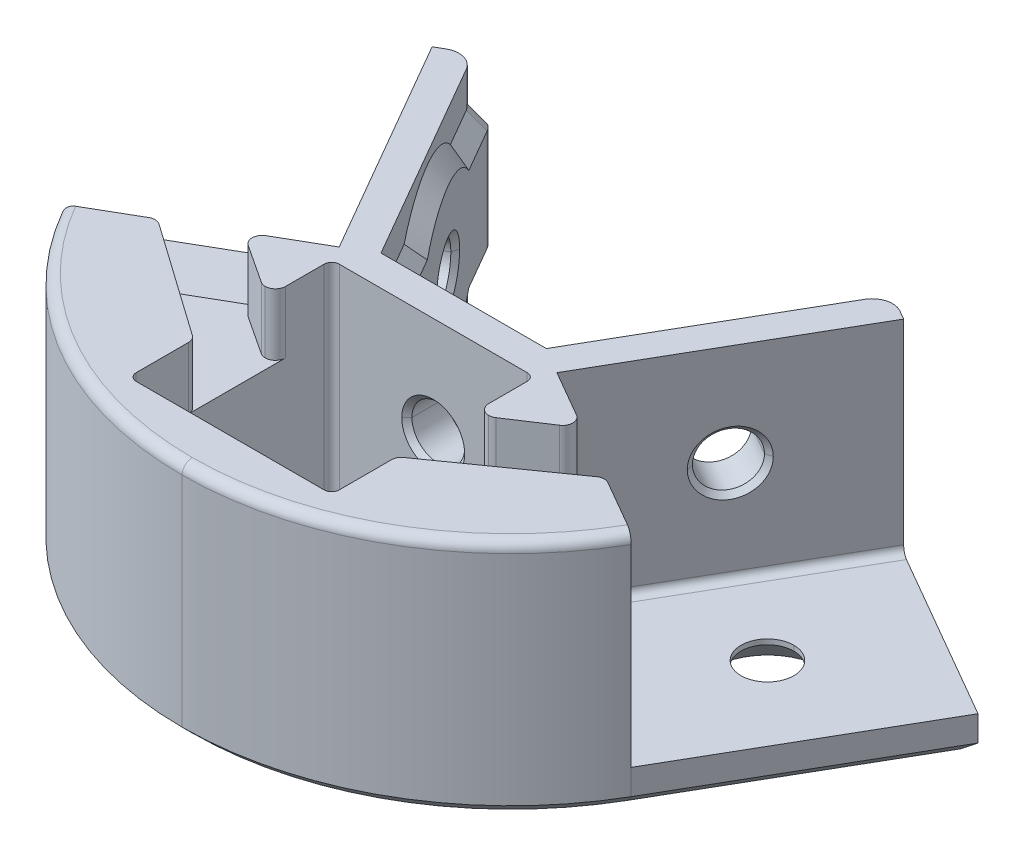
ISO-10303-21;
HEADER;
FILE_DESCRIPTION(('STEP AP214'),'2;1');
FILE_NAME('part.step','',(''),(''),'','','');
FILE_SCHEMA(('AUTOMOTIVE_DESIGN { 1 0 10303 214 1 1 1 1 }'));
ENDSEC;
DATA;
#1=APPLICATION_CONTEXT('core data for automotive mechanical design processes');
#2=APPLICATION_PROTOCOL_DEFINITION('international standard','automotive_design',2000,#1);
#3=PRODUCT_CONTEXT('',#1,'mechanical');
#4=PRODUCT('Part','Part','',(#3));
#5=PRODUCT_RELATED_PRODUCT_CATEGORY('part','',(#4));
#6=PRODUCT_DEFINITION_FORMATION('','',#4);
#7=PRODUCT_DEFINITION_CONTEXT('part definition',#1,'design');
#8=PRODUCT_DEFINITION('design','',#6,#7);
#9=PRODUCT_DEFINITION_SHAPE('','',#8);
#10=(LENGTH_UNIT() NAMED_UNIT(*) SI_UNIT(.MILLI.,.METRE.));
#11=(NAMED_UNIT(*) PLANE_ANGLE_UNIT() SI_UNIT($,.RADIAN.));
#12=(NAMED_UNIT(*) SI_UNIT($,.STERADIAN.) SOLID_ANGLE_UNIT());
#13=UNCERTAINTY_MEASURE_WITH_UNIT(LENGTH_MEASURE(1.E-05),#10,'distance_accuracy_value','');
#14=(GEOMETRIC_REPRESENTATION_CONTEXT(3) GLOBAL_UNCERTAINTY_ASSIGNED_CONTEXT((#13)) GLOBAL_UNIT_ASSIGNED_CONTEXT((#10,
#11,#12)) REPRESENTATION_CONTEXT('',''));
#15=CARTESIAN_POINT('',(0.,0.,0.));
#16=DIRECTION('',(0.,0.,1.));
#17=DIRECTION('',(1.,0.,0.));
#18=AXIS2_PLACEMENT_3D('',#15,#16,#17);
#19=CARTESIAN_POINT('',(-1.7642371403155,28.2592786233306,-3.05574836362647));
#20=DIRECTION('',(-0.353553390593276,-0.707106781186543,-0.612372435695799));
#21=DIRECTION('',(0.,0.654653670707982,-0.75592894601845));
#22=AXIS2_PLACEMENT_3D('',#19,#20,#21);
#23=PLANE('',#22);
#24=DIRECTION('',(0.353553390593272,-0.707106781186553,0.61237243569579));
#25=VECTOR('',#24,1.);
#26=CARTESIAN_POINT('',(24.5086470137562,28.2592786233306,-18.2244051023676));
#27=LINE('',#26,#25);
#28=CARTESIAN_POINT('',(24.5086470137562,28.2592786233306,-18.2244051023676));
#29=VERTEX_POINT('',#28);
#30=CARTESIAN_POINT('',(25.0086470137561,27.2592786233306,-17.3583796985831));
#31=VERTEX_POINT('',#30);
#32=EDGE_CURVE('E9',#29,#31,#27,.T.);
#33=ORIENTED_EDGE('',*,*,#32,.T.);
#34=DIRECTION('',(0.866025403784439,0.,-0.5));
#35=VECTOR('',#34,1.);
#36=CARTESIAN_POINT('',(25.0086470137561,27.2592786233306,-17.3583796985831));
#37=LINE('',#36,#35);
#38=CARTESIAN_POINT('',(7.68813893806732,27.2592786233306,-7.35837969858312));
#39=VERTEX_POINT('',#38);
#40=EDGE_CURVE('E1359',#39,#31,#37,.T.);
#41=ORIENTED_EDGE('',*,*,#40,.F.);
#42=DIRECTION('',(0.78867513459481,-0.577350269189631,0.211324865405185));
#43=VECTOR('',#42,1.);
#44=CARTESIAN_POINT('',(8.83945897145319,26.4164538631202,-7.04988442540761));
#45=LINE('',#44,#43);
#46=CARTESIAN_POINT('',(6.32211353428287,28.2592786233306,-7.72440510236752));
#47=VERTEX_POINT('',#46);
#48=EDGE_CURVE('E1457',#47,#39,#45,.T.);
#49=ORIENTED_EDGE('',*,*,#48,.F.);
#50=DIRECTION('',(-0.866025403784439,0.,0.5));
#51=VECTOR('',#50,1.);
#52=CARTESIAN_POINT('',(7.18813893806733,28.2592786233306,-8.22440510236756));
#53=LINE('',#52,#51);
#54=EDGE_CURVE('E1024',#29,#47,#53,.T.);
#55=ORIENTED_EDGE('',*,*,#54,.F.);
#56=EDGE_LOOP('',(#33,#41,#49,#55));
#57=FACE_BOUND('',#56,.T.);
#58=ADVANCED_FACE('F15',(#57),#23,.T.);
#59=CARTESIAN_POINT('',(25.5086470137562,27.2592786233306,-16.4923542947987));
#60=DIRECTION('',(0.,1.,0.));
#61=DIRECTION('',(0.,0.,1.));
#62=AXIS2_PLACEMENT_3D('',#59,#60,#61);
#63=CONICAL_SURFACE('',#62,1.,0.785398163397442);
#64=DIRECTION('',(-0.612372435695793,-0.707106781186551,0.353553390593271));
#65=VECTOR('',#64,1.);
#66=CARTESIAN_POINT('',(27.240697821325,28.2592786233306,-17.4923542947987));
#67=LINE('',#66,#65);
#68=CARTESIAN_POINT('',(27.240697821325,28.2592786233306,-17.4923542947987));
#69=VERTEX_POINT('',#68);
#70=CARTESIAN_POINT('',(26.3746724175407,27.2592786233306,-16.9923542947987));
#71=VERTEX_POINT('',#70);
#72=EDGE_CURVE('E26',#69,#71,#67,.T.);
#73=ORIENTED_EDGE('',*,*,#72,.T.);
#74=CARTESIAN_POINT('',(25.5086470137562,27.2592786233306,-16.4923542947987));
#75=DIRECTION('',(0.,-1.,0.));
#76=DIRECTION('',(0.,0.,1.));
#77=AXIS2_PLACEMENT_3D('',#74,#75,#76);
#78=CIRCLE('',#77,1.);
#79=EDGE_CURVE('E1339',#31,#71,#78,.T.);
#80=ORIENTED_EDGE('',*,*,#79,.F.);
#81=ORIENTED_EDGE('',*,*,#32,.F.);
#82=CARTESIAN_POINT('',(25.5086470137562,28.2592786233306,-16.4923542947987));
#83=DIRECTION('',(0.,1.,0.));
#84=DIRECTION('',(0.,0.,1.));
#85=AXIS2_PLACEMENT_3D('',#82,#83,#84);
#86=CIRCLE('',#85,2.);
#87=EDGE_CURVE('E1215',#69,#29,#86,.T.);
#88=ORIENTED_EDGE('',*,*,#87,.F.);
#89=EDGE_LOOP('',(#73,#80,#81,#88));
#90=FACE_BOUND('',#89,.T.);
#91=ADVANCED_FACE('F1836',(#90),#63,.T.);
#92=CARTESIAN_POINT('',(28.0049349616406,28.2592786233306,-16.1686567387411));
#93=DIRECTION('',(0.612372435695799,-0.707106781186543,-0.353553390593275));
#94=DIRECTION('',(0.,0.447213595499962,-0.894427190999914));
#95=AXIS2_PLACEMENT_3D('',#92,#93,#94);
#96=PLANE('',#95);
#97=DIRECTION('',(-0.377964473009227,-0.654653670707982,0.654653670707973));
#98=VECTOR('',#97,1.);
#99=CARTESIAN_POINT('',(41.7776090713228,33.560383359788,-2.91589489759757));
#100=LINE('',#99,#98);
#101=CARTESIAN_POINT('',(38.7170148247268,28.2592786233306,2.38520983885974));
#102=VERTEX_POINT('',#101);
#103=CARTESIAN_POINT('',(38.1396645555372,27.2592786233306,3.38520983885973));
#104=VERTEX_POINT('',#103);
#105=EDGE_CURVE('E1347',#102,#104,#100,.T.);
#106=ORIENTED_EDGE('',*,*,#105,.T.);
#107=DIRECTION('',(0.5,0.,0.866025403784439));
#108=VECTOR('',#107,1.);
#109=CARTESIAN_POINT('',(37.8509894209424,27.2592786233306,2.88520983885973));
#110=LINE('',#109,#108);
#111=EDGE_CURVE('E1334',#71,#104,#110,.T.);
#112=ORIENTED_EDGE('',*,*,#111,.F.);
#113=ORIENTED_EDGE('',*,*,#72,.F.);
#114=DIRECTION('',(-0.5,0.,-0.866025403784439));
#115=VECTOR('',#114,1.);
#116=CARTESIAN_POINT('',(27.240697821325,28.2592786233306,-17.4923542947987));
#117=LINE('',#116,#115);
#118=EDGE_CURVE('E1098',#102,#69,#117,.T.);
#119=ORIENTED_EDGE('',*,*,#118,.F.);
#120=EDGE_LOOP('',(#106,#112,#113,#119));
#121=FACE_BOUND('',#120,.T.);
#122=ADVANCED_FACE('F1839',(#121),#96,.T.);
#123=CARTESIAN_POINT('',(0.,27.2592786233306,3.38520983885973));
#124=DIRECTION('',(0.,0.707106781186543,0.707106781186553));
#125=DIRECTION('',(1.,0.,0.));
#126=AXIS2_PLACEMENT_3D('',#123,#124,#125);
#127=PLANE('',#126);
#128=DIRECTION('',(0.377964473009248,-0.654653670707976,0.654653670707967));
#129=VECTOR('',#128,1.);
#130=CARTESIAN_POINT('',(47.6422979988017,41.0124254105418,-10.3679369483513));
#131=LINE('',#130,#129);
#132=CARTESIAN_POINT('',(55.0053307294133,28.2592786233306,2.38520983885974));
#133=VERTEX_POINT('',#132);
#134=CARTESIAN_POINT('',(55.5826809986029,27.2592786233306,3.38520983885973));
#135=VERTEX_POINT('',#134);
#136=EDGE_CURVE('E1344',#133,#135,#131,.T.);
#137=ORIENTED_EDGE('',*,*,#136,.T.);
#138=DIRECTION('',(1.,0.,0.));
#139=VECTOR('',#138,1.);
#140=CARTESIAN_POINT('',(0.,27.2592786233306,3.38520983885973));
#141=LINE('',#140,#139);
#142=EDGE_CURVE('E1338',#104,#135,#141,.T.);
#143=ORIENTED_EDGE('',*,*,#142,.F.);
#144=ORIENTED_EDGE('',*,*,#105,.F.);
#145=DIRECTION('',(-1.,0.,0.));
#146=VECTOR('',#145,1.);
#147=CARTESIAN_POINT('',(0.,28.2592786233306,2.38520983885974));
#148=LINE('',#147,#146);
#149=EDGE_CURVE('E920',#133,#102,#148,.T.);
#150=ORIENTED_EDGE('',*,*,#149,.F.);
#151=EDGE_LOOP('',(#137,#143,#144,#150));
#152=FACE_BOUND('',#151,.T.);
#153=ADVANCED_FACE('F2027',(#152),#127,.F.);
#154=CARTESIAN_POINT('',(43.1528496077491,27.2592786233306,24.9143093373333));
#155=DIRECTION('',(0.612372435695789,0.707106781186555,0.35355339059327));
#156=DIRECTION('',(0.5,0.,-0.866025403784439));
#157=AXIS2_PLACEMENT_3D('',#154,#155,#156);
#158=PLANE('',#157);
#159=DIRECTION('',(0.612372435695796,-0.707106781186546,0.353553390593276));
#160=VECTOR('',#159,1.);
#161=CARTESIAN_POINT('',(66.481647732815,28.2592786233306,-17.4923542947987));
#162=LINE('',#161,#160);
#163=CARTESIAN_POINT('',(66.481647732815,28.2592786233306,-17.4923542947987));
#164=VERTEX_POINT('',#163);
#165=CARTESIAN_POINT('',(67.3476731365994,27.2592786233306,-16.9923542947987));
#166=VERTEX_POINT('',#165);
#167=EDGE_CURVE('E713',#164,#166,#162,.T.);
#168=ORIENTED_EDGE('',*,*,#167,.T.);
#169=DIRECTION('',(0.5,0.,-0.866025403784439));
#170=VECTOR('',#169,1.);
#171=CARTESIAN_POINT('',(43.1528496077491,27.2592786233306,24.9143093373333));
#172=LINE('',#171,#170);
#173=EDGE_CURVE('E1500',#135,#166,#172,.T.);
#174=ORIENTED_EDGE('',*,*,#173,.F.);
#175=ORIENTED_EDGE('',*,*,#136,.F.);
#176=DIRECTION('',(-0.5,0.,0.866025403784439));
#177=VECTOR('',#176,1.);
#178=CARTESIAN_POINT('',(42.2868242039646,28.2592786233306,24.4143093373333));
#179=LINE('',#178,#177);
#180=EDGE_CURVE('E946',#164,#133,#179,.T.);
#181=ORIENTED_EDGE('',*,*,#180,.F.);
#182=EDGE_LOOP('',(#168,#174,#175,#181));
#183=FACE_BOUND('',#182,.T.);
#184=ADVANCED_FACE('F1679',(#183),#158,.F.);
#185=CARTESIAN_POINT('',(68.2136985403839,27.2592786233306,-16.4923542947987));
#186=DIRECTION('',(0.,1.,0.));
#187=DIRECTION('',(0.,0.,1.));
#188=AXIS2_PLACEMENT_3D('',#185,#186,#187);
#189=CONICAL_SURFACE('',#188,0.999999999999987,0.785398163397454);
#190=DIRECTION('',(-0.353553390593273,-0.70710678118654,0.612372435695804));
#191=VECTOR('',#190,1.);
#192=CARTESIAN_POINT('',(69.2136985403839,28.2592786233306,-18.2244051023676));
#193=LINE('',#192,#191);
#194=CARTESIAN_POINT('',(69.2136985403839,28.2592786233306,-18.2244051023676));
#195=VERTEX_POINT('',#194);
#196=CARTESIAN_POINT('',(68.7136985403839,27.2592786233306,-17.3583796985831));
#197=VERTEX_POINT('',#196);
#198=EDGE_CURVE('E701',#195,#197,#193,.T.);
#199=ORIENTED_EDGE('',*,*,#198,.T.);
#200=CARTESIAN_POINT('',(68.2136985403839,27.2592786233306,-16.4923542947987));
#201=DIRECTION('',(0.,-1.,0.));
#202=DIRECTION('',(0.,0.,1.));
#203=AXIS2_PLACEMENT_3D('',#200,#201,#202);
#204=CIRCLE('',#203,0.999999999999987);
#205=EDGE_CURVE('E1496',#166,#197,#204,.T.);
#206=ORIENTED_EDGE('',*,*,#205,.F.);
#207=ORIENTED_EDGE('',*,*,#167,.F.);
#208=CARTESIAN_POINT('',(68.2136985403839,28.2592786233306,-16.4923542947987));
#209=DIRECTION('',(0.,1.,0.));
#210=DIRECTION('',(0.,0.,1.));
#211=AXIS2_PLACEMENT_3D('',#208,#209,#210);
#212=CIRCLE('',#211,2.);
#213=EDGE_CURVE('E1228',#195,#164,#212,.T.);
#214=ORIENTED_EDGE('',*,*,#213,.F.);
#215=EDGE_LOOP('',(#199,#206,#207,#214));
#216=FACE_BOUND('',#215,.T.);
#217=ADVANCED_FACE('F1675',(#216),#189,.T.);
#218=CARTESIAN_POINT('',(24.6948235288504,27.2592786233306,-42.7726890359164));
#219=DIRECTION('',(-0.35355339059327,0.707106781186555,0.612372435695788));
#220=DIRECTION('',(0.866025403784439,0.,0.5));
#221=AXIS2_PLACEMENT_3D('',#218,#219,#220);
#222=PLANE('',#221);
#223=DIRECTION('',(0.788675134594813,0.577350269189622,-0.211324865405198));
#224=VECTOR('',#223,1.);
#225=CARTESIAN_POINT('',(121.550867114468,53.2592786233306,-16.8750401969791));
#226=LINE('',#225,#224);
#227=CARTESIAN_POINT('',(86.0342066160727,27.2592786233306,-7.35837969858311));
#228=VERTEX_POINT('',#227);
#229=CARTESIAN_POINT('',(87.4002320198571,28.2592786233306,-7.72440510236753));
#230=VERTEX_POINT('',#229);
#231=EDGE_CURVE('E1350',#228,#230,#226,.T.);
#232=ORIENTED_EDGE('',*,*,#231,.F.);
#233=DIRECTION('',(0.866025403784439,0.,0.5));
#234=VECTOR('',#233,1.);
#235=CARTESIAN_POINT('',(24.6948235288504,27.2592786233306,-42.7726890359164));
#236=LINE('',#235,#234);
#237=EDGE_CURVE('E935',#197,#228,#236,.T.);
#238=ORIENTED_EDGE('',*,*,#237,.F.);
#239=ORIENTED_EDGE('',*,*,#198,.F.);
#240=DIRECTION('',(-0.866025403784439,0.,-0.5));
#241=VECTOR('',#240,1.);
#242=CARTESIAN_POINT('',(25.1948235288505,28.2592786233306,-43.6387144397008));
#243=LINE('',#242,#241);
#244=EDGE_CURVE('E1369',#230,#195,#243,.T.);
#245=ORIENTED_EDGE('',*,*,#244,.F.);
#246=EDGE_LOOP('',(#232,#238,#239,#245));
#247=FACE_BOUND('',#246,.T.);
#248=ADVANCED_FACE('F1678',(#247),#222,.F.);
#249=CARTESIAN_POINT('',(68.2136985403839,27.2592786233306,-16.4923542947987));
#250=DIRECTION('',(0.,1.,0.));
#251=DIRECTION('',(0.,0.,1.));
#252=AXIS2_PLACEMENT_3D('',#249,#250,#251);
#253=CYLINDRICAL_SURFACE('',#252,2.);
#254=DIRECTION('',(0.,1.,0.));
#255=VECTOR('',#254,1.);
#256=CARTESIAN_POINT('',(69.2136985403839,27.2592786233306,-18.2244051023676));
#257=LINE('',#256,#255);
#258=CARTESIAN_POINT('',(69.2136985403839,35.0877057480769,-18.2244051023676));
#259=VERTEX_POINT('',#258);
#260=EDGE_CURVE('E1028',#195,#259,#257,.T.);
#261=ORIENTED_EDGE('',*,*,#260,.F.);
#262=ORIENTED_EDGE('',*,*,#213,.T.);
#263=DIRECTION('',(0.,-1.,0.));
#264=VECTOR('',#263,1.);
#265=CARTESIAN_POINT('',(66.481647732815,27.2592786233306,-17.4923542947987));
#266=LINE('',#265,#264);
#267=CARTESIAN_POINT('',(66.481647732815,34.2592786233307,-17.4923542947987));
#268=VERTEX_POINT('',#267);
#269=EDGE_CURVE('E1052',#268,#164,#266,.T.);
#270=ORIENTED_EDGE('',*,*,#269,.F.);
#271=CARTESIAN_POINT('',(66.481647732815,34.2592786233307,-17.4923542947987));
#272=CARTESIAN_POINT('',(67.0674341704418,34.2592786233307,-18.5069661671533));
#273=CARTESIAN_POINT('',(68.1990866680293,34.6024243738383,-18.8101915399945));
#274=CARTESIAN_POINT('',(69.2136985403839,35.0877057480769,-18.2244051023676));
#275=(BOUNDED_CURVE() B_SPLINE_CURVE(3,(#271,#272,#273,#274),.UNSPECIFIED.,.F.,
.F.) B_SPLINE_CURVE_WITH_KNOTS((4,4),(3.14159265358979,4.71238898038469),
.UNSPECIFIED.) CURVE() GEOMETRIC_REPRESENTATION_ITEM() RATIONAL_B_SPLINE_CURVE((1.,
0.804737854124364,0.804737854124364,1.)) REPRESENTATION_ITEM(''));
#276=EDGE_CURVE('E1223',#268,#259,#275,.T.);
#277=ORIENTED_EDGE('',*,*,#276,.T.);
#278=EDGE_LOOP('',(#261,#262,#270,#277));
#279=FACE_BOUND('',#278,.T.);
#280=ADVANCED_FACE('F2061',(#279),#253,.T.);
#281=CARTESIAN_POINT('',(49.5940694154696,56.5878015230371,-27.242402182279));
#282=DIRECTION('',(0.612372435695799,-0.707106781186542,0.353553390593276));
#283=DIRECTION('',(0.755928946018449,0.654653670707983,0.));
#284=AXIS2_PLACEMENT_3D('',#281,#282,#283);
#285=CYLINDRICAL_SURFACE('',#284,2.);
#286=CARTESIAN_POINT('',(65.1826096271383,35.7592786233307,-18.2423542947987));
#287=CARTESIAN_POINT('',(65.7683960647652,35.7592786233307,-19.2569661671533));
#288=CARTESIAN_POINT('',(66.9000485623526,36.1024243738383,-19.5601915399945));
#289=CARTESIAN_POINT('',(67.9146604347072,36.5877057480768,-18.9744051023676));
#290=(BOUNDED_CURVE() B_SPLINE_CURVE(3,(#286,#287,#288,#289),.UNSPECIFIED.,.F.,
.F.) B_SPLINE_CURVE_WITH_KNOTS((4,4),(3.14159265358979,4.71238898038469),
.UNSPECIFIED.) CURVE() GEOMETRIC_REPRESENTATION_ITEM() RATIONAL_B_SPLINE_CURVE((1.,
0.804737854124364,0.804737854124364,1.)) REPRESENTATION_ITEM(''));
#291=CARTESIAN_POINT('',(65.1826096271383,35.7592786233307,-18.2423542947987));
#292=VERTEX_POINT('',#291);
#293=CARTESIAN_POINT('',(67.9146604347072,36.5877057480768,-18.9744051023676));
#294=VERTEX_POINT('',#293);
#295=EDGE_CURVE('E1003',#292,#294,#290,.T.);
#296=ORIENTED_EDGE('',*,*,#295,.T.);
#297=DIRECTION('',(-0.612372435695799,0.707106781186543,-0.353553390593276));
#298=VECTOR('',#297,1.);
#299=CARTESIAN_POINT('',(67.4073544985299,37.1734921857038,-19.267298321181));
#300=LINE('',#299,#298);
#301=EDGE_CURVE('E931',#259,#294,#300,.T.);
#302=ORIENTED_EDGE('',*,*,#301,.F.);
#303=ORIENTED_EDGE('',*,*,#276,.F.);
#304=DIRECTION('',(0.612372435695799,-0.707106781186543,0.353553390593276));
#305=VECTOR('',#304,1.);
#306=CARTESIAN_POINT('',(66.481647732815,34.2592786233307,-17.4923542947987));
#307=LINE('',#306,#305);
#308=EDGE_CURVE('E988',#292,#268,#307,.T.);
#309=ORIENTED_EDGE('',*,*,#308,.F.);
#310=EDGE_LOOP('',(#296,#302,#303,#309));
#311=FACE_BOUND('',#310,.T.);
#312=ADVANCED_FACE('F2056',(#311),#285,.T.);
#313=CARTESIAN_POINT('',(66.9146604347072,40.7592786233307,-17.2423542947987));
#314=DIRECTION('',(0.,1.,0.));
#315=DIRECTION('',(0.,0.,1.));
#316=AXIS2_PLACEMENT_3D('',#313,#314,#315);
#317=CYLINDRICAL_SURFACE('',#316,2.);
#318=CARTESIAN_POINT('',(65.1826096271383,45.7592786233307,-18.2423542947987));
#319=CARTESIAN_POINT('',(65.7683960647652,45.7592786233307,-19.2569661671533));
#320=CARTESIAN_POINT('',(66.9000485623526,45.416132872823,-19.5601915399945));
#321=CARTESIAN_POINT('',(67.9146604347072,44.9308514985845,-18.9744051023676));
#322=(BOUNDED_CURVE() B_SPLINE_CURVE(3,(#318,#319,#320,#321),.UNSPECIFIED.,.F.,
.F.) B_SPLINE_CURVE_WITH_KNOTS((4,4),(0.,1.5707963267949),
.UNSPECIFIED.) CURVE() GEOMETRIC_REPRESENTATION_ITEM() RATIONAL_B_SPLINE_CURVE((1.,
0.804737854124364,0.804737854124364,1.)) REPRESENTATION_ITEM(''));
#323=CARTESIAN_POINT('',(65.1826096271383,45.7592786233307,-18.2423542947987));
#324=VERTEX_POINT('',#323);
#325=CARTESIAN_POINT('',(67.9146604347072,44.9308514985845,-18.9744051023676));
#326=VERTEX_POINT('',#325);
#327=EDGE_CURVE('E998',#324,#326,#322,.T.);
#328=ORIENTED_EDGE('',*,*,#327,.T.);
#329=DIRECTION('',(0.,1.,0.));
#330=VECTOR('',#329,1.);
#331=CARTESIAN_POINT('',(67.9146604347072,45.7592786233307,-18.9744051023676));
#332=LINE('',#331,#330);
#333=EDGE_CURVE('E926',#294,#326,#332,.T.);
#334=ORIENTED_EDGE('',*,*,#333,.F.);
#335=ORIENTED_EDGE('',*,*,#295,.F.);
#336=DIRECTION('',(0.,-1.,0.));
#337=VECTOR('',#336,1.);
#338=CARTESIAN_POINT('',(65.1826096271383,35.7592786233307,-18.2423542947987));
#339=LINE('',#338,#337);
#340=EDGE_CURVE('E1277',#324,#292,#339,.T.);
#341=ORIENTED_EDGE('',*,*,#340,.F.);
#342=EDGE_LOOP('',(#328,#334,#335,#341));
#343=FACE_BOUND('',#342,.T.);
#344=ADVANCED_FACE('F1684',(#343),#317,.T.);
#345=CARTESIAN_POINT('',(37.9027264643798,11.4307557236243,-33.9924021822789));
#346=DIRECTION('',(-0.612372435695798,-0.707106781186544,-0.353553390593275));
#347=DIRECTION('',(0.755928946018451,-0.654653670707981,0.));
#348=AXIS2_PLACEMENT_3D('',#345,#346,#347);
#349=CYLINDRICAL_SURFACE('',#348,2.);
#350=CARTESIAN_POINT('',(66.481647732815,47.2592786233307,-17.4923542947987));
#351=CARTESIAN_POINT('',(67.0674341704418,47.2592786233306,-18.5069661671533));
#352=CARTESIAN_POINT('',(68.1990866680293,46.916132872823,-18.8101915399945));
#353=CARTESIAN_POINT('',(69.2136985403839,46.4308514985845,-18.2244051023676));
#354=(BOUNDED_CURVE() B_SPLINE_CURVE(3,(#350,#351,#352,#353),.UNSPECIFIED.,.F.,
.F.) B_SPLINE_CURVE_WITH_KNOTS((4,4),(0.,1.5707963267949),
.UNSPECIFIED.) CURVE() GEOMETRIC_REPRESENTATION_ITEM() RATIONAL_B_SPLINE_CURVE((1.,
0.804737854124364,0.804737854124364,1.)) REPRESENTATION_ITEM(''));
#355=CARTESIAN_POINT('',(66.481647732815,47.2592786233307,-17.4923542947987));
#356=VERTEX_POINT('',#355);
#357=CARTESIAN_POINT('',(69.2136985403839,46.4308514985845,-18.2244051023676));
#358=VERTEX_POINT('',#357);
#359=EDGE_CURVE('E952',#356,#358,#354,.T.);
#360=ORIENTED_EDGE('',*,*,#359,.T.);
#361=DIRECTION('',(0.612372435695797,0.707106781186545,0.353553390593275));
#362=VECTOR('',#361,1.);
#363=CARTESIAN_POINT('',(68.7063926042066,45.8450650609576,-18.517298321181));
#364=LINE('',#363,#362);
#365=EDGE_CURVE('E930',#326,#358,#364,.T.);
#366=ORIENTED_EDGE('',*,*,#365,.F.);
#367=ORIENTED_EDGE('',*,*,#327,.F.);
#368=DIRECTION('',(-0.612372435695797,-0.707106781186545,-0.353553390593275));
#369=VECTOR('',#368,1.);
#370=CARTESIAN_POINT('',(65.1826096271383,45.7592786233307,-18.2423542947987));
#371=LINE('',#370,#369);
#372=EDGE_CURVE('E1123',#356,#324,#371,.T.);
#373=ORIENTED_EDGE('',*,*,#372,.F.);
#374=EDGE_LOOP('',(#360,#366,#367,#373));
#375=FACE_BOUND('',#374,.T.);
#376=ADVANCED_FACE('F1680',(#375),#349,.T.);
#377=CARTESIAN_POINT('',(68.2136985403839,27.2592786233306,-16.4923542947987));
#378=DIRECTION('',(0.,1.,0.));
#379=DIRECTION('',(0.,0.,1.));
#380=AXIS2_PLACEMENT_3D('',#377,#378,#379);
#381=CYLINDRICAL_SURFACE('',#380,2.);
#382=CARTESIAN_POINT('',(68.2136985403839,50.7592786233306,-16.4923542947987));
#383=DIRECTION('',(0.,1.,0.));
#384=DIRECTION('',(0.,0.,1.));
#385=AXIS2_PLACEMENT_3D('',#382,#383,#384);
#386=CIRCLE('',#385,2.);
#387=CARTESIAN_POINT('',(69.2136985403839,50.7592786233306,-18.2244051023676));
#388=VERTEX_POINT('',#387);
#389=CARTESIAN_POINT('',(66.481647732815,50.7592786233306,-17.4923542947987));
#390=VERTEX_POINT('',#389);
#391=EDGE_CURVE('E1012',#388,#390,#386,.T.);
#392=ORIENTED_EDGE('',*,*,#391,.F.);
#393=DIRECTION('',(0.,1.,0.));
#394=VECTOR('',#393,1.);
#395=CARTESIAN_POINT('',(69.2136985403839,27.2592786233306,-18.2244051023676));
#396=LINE('',#395,#394);
#397=EDGE_CURVE('E997',#358,#388,#396,.T.);
#398=ORIENTED_EDGE('',*,*,#397,.F.);
#399=ORIENTED_EDGE('',*,*,#359,.F.);
#400=DIRECTION('',(0.,-1.,0.));
#401=VECTOR('',#400,1.);
#402=CARTESIAN_POINT('',(66.481647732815,27.2592786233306,-17.4923542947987));
#403=LINE('',#402,#401);
#404=EDGE_CURVE('E3971',#390,#356,#403,.T.);
#405=ORIENTED_EDGE('',*,*,#404,.F.);
#406=EDGE_LOOP('',(#392,#398,#399,#405));
#407=FACE_BOUND('',#406,.T.);
#408=ADVANCED_FACE('F1683',(#407),#381,.T.);
#409=CARTESIAN_POINT('',(25.5086470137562,27.2592786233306,-16.4923542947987));
#410=DIRECTION('',(0.,1.,0.));
#411=DIRECTION('',(0.,0.,1.));
#412=AXIS2_PLACEMENT_3D('',#409,#410,#411);
#413=CYLINDRICAL_SURFACE('',#412,2.);
#414=CARTESIAN_POINT('',(27.240697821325,47.2592786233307,-17.4923542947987));
#415=CARTESIAN_POINT('',(26.6549113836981,47.2592786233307,-18.5069661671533));
#416=CARTESIAN_POINT('',(25.5232588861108,46.916132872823,-18.8101915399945));
#417=CARTESIAN_POINT('',(24.5086470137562,46.4308514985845,-18.2244051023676));
#418=(BOUNDED_CURVE() B_SPLINE_CURVE(3,(#414,#415,#416,#417),.UNSPECIFIED.,.F.,
.F.) B_SPLINE_CURVE_WITH_KNOTS((4,4),(0.,1.5707963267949),
.UNSPECIFIED.) CURVE() GEOMETRIC_REPRESENTATION_ITEM() RATIONAL_B_SPLINE_CURVE((1.,
0.804737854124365,0.804737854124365,1.)) REPRESENTATION_ITEM(''));
#419=CARTESIAN_POINT('',(27.240697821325,47.2592786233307,-17.4923542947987));
#420=VERTEX_POINT('',#419);
#421=CARTESIAN_POINT('',(24.5086470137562,46.4308514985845,-18.2244051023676));
#422=VERTEX_POINT('',#421);
#423=EDGE_CURVE('E947',#420,#422,#418,.T.);
#424=ORIENTED_EDGE('',*,*,#423,.T.);
#425=DIRECTION('',(0.,-1.,0.));
#426=VECTOR('',#425,1.);
#427=CARTESIAN_POINT('',(24.5086470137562,27.2592786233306,-18.2244051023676));
#428=LINE('',#427,#426);
#429=CARTESIAN_POINT('',(24.5086470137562,50.7592786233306,-18.2244051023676));
#430=VERTEX_POINT('',#429);
#431=EDGE_CURVE('E906',#430,#422,#428,.T.);
#432=ORIENTED_EDGE('',*,*,#431,.F.);
#433=CARTESIAN_POINT('',(25.5086470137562,50.7592786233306,-16.4923542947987));
#434=DIRECTION('',(0.,1.,0.));
#435=DIRECTION('',(0.,0.,1.));
#436=AXIS2_PLACEMENT_3D('',#433,#434,#435);
#437=CIRCLE('',#436,2.);
#438=CARTESIAN_POINT('',(27.240697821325,50.7592786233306,-17.4923542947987));
#439=VERTEX_POINT('',#438);
#440=EDGE_CURVE('E913',#439,#430,#437,.T.);
#441=ORIENTED_EDGE('',*,*,#440,.F.);
#442=DIRECTION('',(0.,1.,0.));
#443=VECTOR('',#442,1.);
#444=CARTESIAN_POINT('',(27.240697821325,27.2592786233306,-17.4923542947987));
#445=LINE('',#444,#443);
#446=EDGE_CURVE('E1289',#420,#439,#445,.T.);
#447=ORIENTED_EDGE('',*,*,#446,.F.);
#448=EDGE_LOOP('',(#424,#432,#441,#447));
#449=FACE_BOUND('',#448,.T.);
#450=ADVANCED_FACE('F1772',(#449),#413,.T.);
#451=CARTESIAN_POINT('',(20.6737395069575,52.0137217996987,-13.7009191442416));
#452=DIRECTION('',(0.612372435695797,-0.707106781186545,-0.353553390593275));
#453=DIRECTION('',(0.755928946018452,0.65465367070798,0.));
#454=AXIS2_PLACEMENT_3D('',#451,#452,#453);
#455=CYLINDRICAL_SURFACE('',#454,2.);
#456=CARTESIAN_POINT('',(28.5397359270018,45.7592786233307,-18.2423542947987));
#457=CARTESIAN_POINT('',(27.9539494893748,45.7592786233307,-19.2569661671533));
#458=CARTESIAN_POINT('',(26.8222969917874,45.416132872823,-19.5601915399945));
#459=CARTESIAN_POINT('',(25.8076851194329,44.9308514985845,-18.9744051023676));
#460=(BOUNDED_CURVE() B_SPLINE_CURVE(3,(#456,#457,#458,#459),.UNSPECIFIED.,.F.,
.F.) B_SPLINE_CURVE_WITH_KNOTS((4,4),(0.,1.5707963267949),
.UNSPECIFIED.) CURVE() GEOMETRIC_REPRESENTATION_ITEM() RATIONAL_B_SPLINE_CURVE((1.,
0.804737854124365,0.804737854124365,1.)) REPRESENTATION_ITEM(''));
#461=CARTESIAN_POINT('',(28.5397359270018,45.7592786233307,-18.2423542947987));
#462=VERTEX_POINT('',#461);
#463=CARTESIAN_POINT('',(25.8076851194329,44.9308514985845,-18.9744051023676));
#464=VERTEX_POINT('',#463);
#465=EDGE_CURVE('E953',#462,#464,#460,.T.);
#466=ORIENTED_EDGE('',*,*,#465,.T.);
#467=DIRECTION('',(0.612372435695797,-0.707106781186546,-0.353553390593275));
#468=VECTOR('',#467,1.);
#469=CARTESIAN_POINT('',(19.6737395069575,52.0137217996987,-15.4329699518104));
#470=LINE('',#469,#468);
#471=EDGE_CURVE('E1151',#422,#464,#470,.T.);
#472=ORIENTED_EDGE('',*,*,#471,.F.);
#473=ORIENTED_EDGE('',*,*,#423,.F.);
#474=DIRECTION('',(-0.612372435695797,0.707106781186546,0.353553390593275));
#475=VECTOR('',#474,1.);
#476=CARTESIAN_POINT('',(28.5397359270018,45.7592786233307,-18.2423542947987));
#477=LINE('',#476,#475);
#478=EDGE_CURVE('E1946',#462,#420,#477,.T.);
#479=ORIENTED_EDGE('',*,*,#478,.F.);
#480=EDGE_LOOP('',(#466,#472,#473,#479));
#481=FACE_BOUND('',#480,.T.);
#482=ADVANCED_FACE('F1673',(#481),#455,.T.);
#483=CARTESIAN_POINT('',(26.8076851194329,40.7592786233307,-17.2423542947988));
#484=DIRECTION('',(0.,1.,0.));
#485=DIRECTION('',(0.,0.,1.));
#486=AXIS2_PLACEMENT_3D('',#483,#484,#485);
#487=CYLINDRICAL_SURFACE('',#486,2.);
#488=CARTESIAN_POINT('',(28.5397359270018,35.7592786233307,-18.2423542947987));
#489=CARTESIAN_POINT('',(27.9539494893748,35.7592786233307,-19.2569661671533));
#490=CARTESIAN_POINT('',(26.8222969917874,36.1024243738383,-19.5601915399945));
#491=CARTESIAN_POINT('',(25.8076851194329,36.5877057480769,-18.9744051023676));
#492=(BOUNDED_CURVE() B_SPLINE_CURVE(3,(#488,#489,#490,#491),.UNSPECIFIED.,.F.,
.F.) B_SPLINE_CURVE_WITH_KNOTS((4,4),(3.14159265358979,4.71238898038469),
.UNSPECIFIED.) CURVE() GEOMETRIC_REPRESENTATION_ITEM() RATIONAL_B_SPLINE_CURVE((1.,
0.804737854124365,0.804737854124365,1.)) REPRESENTATION_ITEM(''));
#493=CARTESIAN_POINT('',(28.5397359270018,35.7592786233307,-18.2423542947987));
#494=VERTEX_POINT('',#493);
#495=CARTESIAN_POINT('',(25.8076851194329,36.5877057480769,-18.9744051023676));
#496=VERTEX_POINT('',#495);
#497=EDGE_CURVE('E1124',#494,#496,#492,.T.);
#498=ORIENTED_EDGE('',*,*,#497,.T.);
#499=DIRECTION('',(0.,-1.,0.));
#500=VECTOR('',#499,1.);
#501=CARTESIAN_POINT('',(25.8076851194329,27.2592786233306,-18.9744051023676));
#502=LINE('',#501,#500);
#503=EDGE_CURVE('E1260',#464,#496,#502,.T.);
#504=ORIENTED_EDGE('',*,*,#503,.F.);
#505=ORIENTED_EDGE('',*,*,#465,.F.);
#506=DIRECTION('',(0.,1.,0.));
#507=VECTOR('',#506,1.);
#508=CARTESIAN_POINT('',(28.5397359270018,40.7592786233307,-18.2423542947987));
#509=LINE('',#508,#507);
#510=EDGE_CURVE('E1468',#494,#462,#509,.T.);
#511=ORIENTED_EDGE('',*,*,#510,.F.);
#512=EDGE_LOOP('',(#498,#504,#505,#511));
#513=FACE_BOUND('',#512,.T.);
#514=ADVANCED_FACE('F1669',(#513),#487,.T.);
#515=CARTESIAN_POINT('',(8.98239655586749,16.0048354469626,-6.95091914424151));
#516=DIRECTION('',(-0.612372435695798,-0.707106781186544,0.353553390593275));
#517=DIRECTION('',(0.755928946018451,-0.654653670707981,0.));
#518=AXIS2_PLACEMENT_3D('',#515,#516,#517);
#519=CYLINDRICAL_SURFACE('',#518,2.);
#520=CARTESIAN_POINT('',(27.240697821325,34.2592786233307,-17.4923542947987));
#521=CARTESIAN_POINT('',(26.6549113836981,34.2592786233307,-18.5069661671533));
#522=CARTESIAN_POINT('',(25.5232588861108,34.6024243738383,-18.8101915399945));
#523=CARTESIAN_POINT('',(24.5086470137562,35.0877057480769,-18.2244051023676));
#524=(BOUNDED_CURVE() B_SPLINE_CURVE(3,(#520,#521,#522,#523),.UNSPECIFIED.,.F.,
.F.) B_SPLINE_CURVE_WITH_KNOTS((4,4),(3.1415926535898,4.71238898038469),
.UNSPECIFIED.) CURVE() GEOMETRIC_REPRESENTATION_ITEM() RATIONAL_B_SPLINE_CURVE((1.,
0.804737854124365,0.804737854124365,1.)) REPRESENTATION_ITEM(''));
#525=CARTESIAN_POINT('',(27.240697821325,34.2592786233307,-17.4923542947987));
#526=VERTEX_POINT('',#525);
#527=CARTESIAN_POINT('',(24.5086470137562,35.0877057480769,-18.2244051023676));
#528=VERTEX_POINT('',#527);
#529=EDGE_CURVE('E1129',#526,#528,#524,.T.);
#530=ORIENTED_EDGE('',*,*,#529,.T.);
#531=DIRECTION('',(-0.612372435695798,-0.707106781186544,0.353553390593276));
#532=VECTOR('',#531,1.);
#533=CARTESIAN_POINT('',(7.98239655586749,16.0048354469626,-8.68296995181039));
#534=LINE('',#533,#532);
#535=EDGE_CURVE('E1264',#496,#528,#534,.T.);
#536=ORIENTED_EDGE('',*,*,#535,.F.);
#537=ORIENTED_EDGE('',*,*,#497,.F.);
#538=DIRECTION('',(0.612372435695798,0.707106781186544,-0.353553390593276));
#539=VECTOR('',#538,1.);
#540=CARTESIAN_POINT('',(28.5397359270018,35.7592786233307,-18.2423542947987));
#541=LINE('',#540,#539);
#542=EDGE_CURVE('E1941',#526,#494,#541,.T.);
#543=ORIENTED_EDGE('',*,*,#542,.F.);
#544=EDGE_LOOP('',(#530,#536,#537,#543));
#545=FACE_BOUND('',#544,.T.);
#546=ADVANCED_FACE('F1672',(#545),#519,.T.);
#547=CARTESIAN_POINT('',(25.5086470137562,27.2592786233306,-16.4923542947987));
#548=DIRECTION('',(0.,1.,0.));
#549=DIRECTION('',(0.,0.,1.));
#550=AXIS2_PLACEMENT_3D('',#547,#548,#549);
#551=CYLINDRICAL_SURFACE('',#550,2.);
#552=DIRECTION('',(0.,1.,0.));
#553=VECTOR('',#552,1.);
#554=CARTESIAN_POINT('',(27.240697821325,27.2592786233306,-17.4923542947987));
#555=LINE('',#554,#553);
#556=EDGE_CURVE('E1385',#69,#526,#555,.T.);
#557=ORIENTED_EDGE('',*,*,#556,.F.);
#558=ORIENTED_EDGE('',*,*,#87,.T.);
#559=DIRECTION('',(0.,-1.,0.));
#560=VECTOR('',#559,1.);
#561=CARTESIAN_POINT('',(24.5086470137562,27.2592786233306,-18.2244051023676));
#562=LINE('',#561,#560);
#563=EDGE_CURVE('E1406',#528,#29,#562,.T.);
#564=ORIENTED_EDGE('',*,*,#563,.F.);
#565=ORIENTED_EDGE('',*,*,#529,.F.);
#566=EDGE_LOOP('',(#557,#558,#564,#565));
#567=FACE_BOUND('',#566,.T.);
#568=ADVANCED_FACE('F1834',(#567),#551,.T.);
#569=CARTESIAN_POINT('',(46.86117277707,40.7592786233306,5.38520983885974));
#570=DIRECTION('',(0.,0.,1.));
#571=DIRECTION('',(1.,0.,0.));
#572=AXIS2_PLACEMENT_3D('',#569,#570,#571);
#573=CONICAL_SURFACE('',#572,3.1,0.78539816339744);
#574=DIRECTION('',(-0.707106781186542,0.,0.707106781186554));
#575=VECTOR('',#574,1.);
#576=CARTESIAN_POINT('',(43.7611727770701,40.7592786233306,5.38520983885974));
#577=LINE('',#576,#575);
#578=CARTESIAN_POINT('',(44.26117277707,40.7592786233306,4.88520983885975));
#579=VERTEX_POINT('',#578);
#580=CARTESIAN_POINT('',(43.7611727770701,40.7592786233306,5.38520983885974));
#581=VERTEX_POINT('',#580);
#582=EDGE_CURVE('E4058',#579,#581,#577,.T.);
#583=ORIENTED_EDGE('',*,*,#582,.F.);
#584=CARTESIAN_POINT('',(46.86117277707,40.7592786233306,4.88520983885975));
#585=DIRECTION('',(0.,0.,1.));
#586=DIRECTION('',(-1.,0.,0.));
#587=AXIS2_PLACEMENT_3D('',#584,#585,#586);
#588=CIRCLE('',#587,2.6);
#589=CARTESIAN_POINT('',(49.46117277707,40.7592786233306,4.88520983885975));
#590=VERTEX_POINT('',#589);
#591=EDGE_CURVE('E896',#590,#579,#588,.T.);
#592=ORIENTED_EDGE('',*,*,#591,.F.);
#593=DIRECTION('',(0.707106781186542,0.,0.707106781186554));
#594=VECTOR('',#593,1.);
#595=CARTESIAN_POINT('',(49.96117277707,40.7592786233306,5.38520983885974));
#596=LINE('',#595,#594);
#597=CARTESIAN_POINT('',(49.96117277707,40.7592786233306,5.38520983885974));
#598=VERTEX_POINT('',#597);
#599=EDGE_CURVE('E1312',#590,#598,#596,.T.);
#600=ORIENTED_EDGE('',*,*,#599,.T.);
#601=CARTESIAN_POINT('',(46.86117277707,40.7592786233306,5.38520983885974));
#602=DIRECTION('',(0.,0.,-1.));
#603=DIRECTION('',(-1.,0.,0.));
#604=AXIS2_PLACEMENT_3D('',#601,#602,#603);
#605=CIRCLE('',#604,3.1);
#606=EDGE_CURVE('E1328',#581,#598,#605,.T.);
#607=ORIENTED_EDGE('',*,*,#606,.F.);
#608=EDGE_LOOP('',(#583,#592,#600,#607));
#609=FACE_BOUND('',#608,.T.);
#610=ADVANCED_FACE('F1831',(#609),#573,.F.);
#611=CARTESIAN_POINT('',(46.86117277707,40.7592786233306,1.38520983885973));
#612=DIRECTION('',(0.,0.,-1.));
#613=DIRECTION('',(-1.,0.,0.));
#614=AXIS2_PLACEMENT_3D('',#611,#612,#613);
#615=CONICAL_SURFACE('',#614,2.6,0.785398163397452);
#616=DIRECTION('',(0.707106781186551,0.,-0.707106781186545));
#617=VECTOR('',#616,1.);
#618=CARTESIAN_POINT('',(49.46117277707,40.7592786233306,1.38520983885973));
#619=LINE('',#618,#617);
#620=CARTESIAN_POINT('',(49.46117277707,40.7592786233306,1.38520983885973));
#621=VERTEX_POINT('',#620);
#622=CARTESIAN_POINT('',(49.96117277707,40.7592786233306,0.885209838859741));
#623=VERTEX_POINT('',#622);
#624=EDGE_CURVE('E919',#621,#623,#619,.T.);
#625=ORIENTED_EDGE('',*,*,#624,.F.);
#626=CARTESIAN_POINT('',(46.86117277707,40.7592786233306,1.38520983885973));
#627=DIRECTION('',(0.,0.,-1.));
#628=DIRECTION('',(-1.,0.,0.));
#629=AXIS2_PLACEMENT_3D('',#626,#627,#628);
#630=CIRCLE('',#629,2.6);
#631=CARTESIAN_POINT('',(44.26117277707,40.7592786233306,1.38520983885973));
#632=VERTEX_POINT('',#631);
#633=EDGE_CURVE('E892',#632,#621,#630,.T.);
#634=ORIENTED_EDGE('',*,*,#633,.F.);
#635=DIRECTION('',(-0.707106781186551,0.,-0.707106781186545));
#636=VECTOR('',#635,1.);
#637=CARTESIAN_POINT('',(44.26117277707,40.7592786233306,1.38520983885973));
#638=LINE('',#637,#636);
#639=CARTESIAN_POINT('',(43.7611727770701,40.7592786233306,0.885209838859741));
#640=VERTEX_POINT('',#639);
#641=EDGE_CURVE('E918',#632,#640,#638,.T.);
#642=ORIENTED_EDGE('',*,*,#641,.T.);
#643=CARTESIAN_POINT('',(46.86117277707,40.7592786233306,0.885209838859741));
#644=DIRECTION('',(0.,0.,1.));
#645=DIRECTION('',(-1.,0.,0.));
#646=AXIS2_PLACEMENT_3D('',#643,#644,#645);
#647=CIRCLE('',#646,3.1);
#648=EDGE_CURVE('E4109',#623,#640,#647,.T.);
#649=ORIENTED_EDGE('',*,*,#648,.F.);
#650=EDGE_LOOP('',(#625,#634,#642,#649));
#651=FACE_BOUND('',#650,.T.);
#652=ADVANCED_FACE('F1730',(#651),#615,.F.);
#653=CARTESIAN_POINT('',(30.3256343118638,40.7592786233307,-7.14908755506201));
#654=DIRECTION('',(-0.866025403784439,0.,0.5));
#655=DIRECTION('',(0.5,0.,0.866025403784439));
#656=AXIS2_PLACEMENT_3D('',#653,#654,#655);
#657=CONICAL_SURFACE('',#656,2.6,0.785398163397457);
#658=DIRECTION('',(-0.965925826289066,0.,-0.25881904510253));
#659=VECTOR('',#658,1.);
#660=CARTESIAN_POINT('',(29.0256343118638,40.7592786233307,-9.40075360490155));
#661=LINE('',#660,#659);
#662=CARTESIAN_POINT('',(29.0256343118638,40.7592786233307,-9.40075360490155));
#663=VERTEX_POINT('',#662);
#664=CARTESIAN_POINT('',(28.3426216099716,40.7592786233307,-9.58376630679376));
#665=VERTEX_POINT('',#664);
#666=EDGE_CURVE('E1036',#663,#665,#661,.T.);
#667=ORIENTED_EDGE('',*,*,#666,.F.);
#668=CARTESIAN_POINT('',(30.3256343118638,40.7592786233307,-7.14908755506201));
#669=DIRECTION('',(-0.866025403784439,0.,0.5));
#670=DIRECTION('',(0.5,0.,0.866025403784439));
#671=AXIS2_PLACEMENT_3D('',#668,#669,#670);
#672=CIRCLE('',#671,2.6);
#673=CARTESIAN_POINT('',(31.6256343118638,40.7592786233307,-4.89742150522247));
#674=VERTEX_POINT('',#673);
#675=EDGE_CURVE('E1269',#674,#663,#672,.T.);
#676=ORIENTED_EDGE('',*,*,#675,.F.);
#677=DIRECTION('',(-0.258819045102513,0.,0.965925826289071));
#678=VECTOR('',#677,1.);
#679=CARTESIAN_POINT('',(31.6256343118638,40.7592786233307,-4.89742150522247));
#680=LINE('',#679,#678);
#681=CARTESIAN_POINT('',(31.4426216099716,40.7592786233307,-4.21440880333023));
#682=VERTEX_POINT('',#681);
#683=EDGE_CURVE('E1109',#674,#682,#680,.T.);
#684=ORIENTED_EDGE('',*,*,#683,.T.);
#685=CARTESIAN_POINT('',(29.8926216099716,40.7592786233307,-6.89908755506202));
#686=DIRECTION('',(0.866025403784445,0.,-0.499999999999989));
#687=DIRECTION('',(0.499999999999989,0.,0.866025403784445));
#688=AXIS2_PLACEMENT_3D('',#685,#686,#687);
#689=CIRCLE('',#688,3.1);
#690=EDGE_CURVE('E977',#665,#682,#689,.T.);
#691=ORIENTED_EDGE('',*,*,#690,.F.);
#692=EDGE_LOOP('',(#667,#676,#684,#691));
#693=FACE_BOUND('',#692,.T.);
#694=ADVANCED_FACE('F1657',(#693),#657,.F.);
#695=CARTESIAN_POINT('',(33.3567232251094,40.7592786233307,-8.89908755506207));
#696=DIRECTION('',(0.866025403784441,0.,-0.5));
#697=DIRECTION('',(-0.5,0.,-0.866025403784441));
#698=AXIS2_PLACEMENT_3D('',#695,#696,#697);
#699=CONICAL_SURFACE('',#698,2.6,0.78539816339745);
#700=DIRECTION('',(0.965925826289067,0.,0.258819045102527));
#701=VECTOR('',#700,1.);
#702=CARTESIAN_POINT('',(34.6567232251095,40.7592786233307,-6.64742150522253));
#703=LINE('',#702,#701);
#704=CARTESIAN_POINT('',(34.6567232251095,40.7592786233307,-6.64742150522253));
#705=VERTEX_POINT('',#704);
#706=CARTESIAN_POINT('',(35.3397359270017,40.7592786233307,-6.46440880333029));
#707=VERTEX_POINT('',#706);
#708=EDGE_CURVE('E2093',#705,#707,#703,.T.);
#709=ORIENTED_EDGE('',*,*,#708,.F.);
#710=CARTESIAN_POINT('',(33.3567232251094,40.7592786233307,-8.89908755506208));
#711=DIRECTION('',(0.866025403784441,0.,-0.5));
#712=DIRECTION('',(-0.5,0.,-0.866025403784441));
#713=AXIS2_PLACEMENT_3D('',#710,#711,#712);
#714=CIRCLE('',#713,2.6);
#715=CARTESIAN_POINT('',(32.0567232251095,40.7592786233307,-11.1507536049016));
#716=VERTEX_POINT('',#715);
#717=EDGE_CURVE('E1272',#716,#705,#714,.T.);
#718=ORIENTED_EDGE('',*,*,#717,.F.);
#719=DIRECTION('',(0.258819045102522,0.,-0.965925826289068));
#720=VECTOR('',#719,1.);
#721=CARTESIAN_POINT('',(32.0567232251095,40.7592786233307,-11.1507536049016));
#722=LINE('',#721,#720);
#723=CARTESIAN_POINT('',(32.2397359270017,40.7592786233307,-11.8337663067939));
#724=VERTEX_POINT('',#723);
#725=EDGE_CURVE('E2092',#716,#724,#722,.T.);
#726=ORIENTED_EDGE('',*,*,#725,.T.);
#727=CARTESIAN_POINT('',(33.7897359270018,40.7592786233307,-9.14908755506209));
#728=DIRECTION('',(-0.866025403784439,0.,0.5));
#729=DIRECTION('',(-0.5,0.,-0.866025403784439));
#730=AXIS2_PLACEMENT_3D('',#727,#728,#729);
#731=CIRCLE('',#730,3.10000000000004);
#732=EDGE_CURVE('E993',#707,#724,#731,.T.);
#733=ORIENTED_EDGE('',*,*,#732,.F.);
#734=EDGE_LOOP('',(#709,#718,#726,#733));
#735=FACE_BOUND('',#734,.T.);
#736=ADVANCED_FACE('F1653',(#735),#699,.F.);
#737=CARTESIAN_POINT('',(63.8297239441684,40.7592786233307,-6.89908755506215));
#738=DIRECTION('',(0.866025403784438,0.,0.5));
#739=DIRECTION('',(0.5,0.,-0.866025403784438));
#740=AXIS2_PLACEMENT_3D('',#737,#738,#739);
#741=CONICAL_SURFACE('',#740,3.10000000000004,0.785398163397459);
#742=DIRECTION('',(0.258819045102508,0.,0.965925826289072));
#743=VECTOR('',#742,1.);
#744=CARTESIAN_POINT('',(62.2797239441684,40.7592786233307,-4.21440880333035));
#745=LINE('',#744,#743);
#746=CARTESIAN_POINT('',(62.0967112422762,40.7592786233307,-4.89742150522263));
#747=VERTEX_POINT('',#746);
#748=CARTESIAN_POINT('',(62.2797239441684,40.7592786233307,-4.21440880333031));
#749=VERTEX_POINT('',#748);
#750=EDGE_CURVE('E1157',#747,#749,#745,.T.);
#751=ORIENTED_EDGE('',*,*,#750,.F.);
#752=CARTESIAN_POINT('',(63.3967112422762,40.7592786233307,-7.14908755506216));
#753=DIRECTION('',(0.866025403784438,0.,0.5));
#754=DIRECTION('',(-0.5,0.,0.866025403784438));
#755=AXIS2_PLACEMENT_3D('',#752,#753,#754);
#756=CIRCLE('',#755,2.6);
#757=CARTESIAN_POINT('',(64.6967112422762,40.7592786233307,-9.4007536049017));
#758=VERTEX_POINT('',#757);
#759=EDGE_CURVE('E895',#758,#747,#756,.T.);
#760=ORIENTED_EDGE('',*,*,#759,.F.);
#761=DIRECTION('',(0.965925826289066,0.,-0.25881904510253));
#762=VECTOR('',#761,1.);
#763=CARTESIAN_POINT('',(65.3797239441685,40.7592786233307,-9.58376630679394));
#764=LINE('',#763,#762);
#765=CARTESIAN_POINT('',(65.3797239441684,40.7592786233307,-9.58376630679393));
#766=VERTEX_POINT('',#765);
#767=EDGE_CURVE('E1392',#758,#766,#764,.T.);
#768=ORIENTED_EDGE('',*,*,#767,.T.);
#769=CARTESIAN_POINT('',(63.8297239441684,40.7592786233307,-6.89908755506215));
#770=DIRECTION('',(-0.866025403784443,0.,-0.499999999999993));
#771=DIRECTION('',(-0.499999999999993,0.,0.866025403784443));
#772=AXIS2_PLACEMENT_3D('',#769,#770,#771);
#773=CIRCLE('',#772,3.10000000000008);
#774=EDGE_CURVE('E872',#749,#766,#773,.T.);
#775=ORIENTED_EDGE('',*,*,#774,.F.);
#776=EDGE_LOOP('',(#751,#760,#768,#775));
#777=FACE_BOUND('',#776,.T.);
#778=ADVANCED_FACE('F1656',(#777),#741,.F.);
#779=CARTESIAN_POINT('',(60.3656223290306,40.7592786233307,-8.89908755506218));
#780=DIRECTION('',(-0.866025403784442,0.,-0.499999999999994));
#781=DIRECTION('',(-0.499999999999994,0.,0.866025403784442));
#782=AXIS2_PLACEMENT_3D('',#779,#780,#781);
#783=CONICAL_SURFACE('',#782,2.6,0.785398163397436);
#784=DIRECTION('',(-0.25881904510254,0.,-0.965925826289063));
#785=VECTOR('',#784,1.);
#786=CARTESIAN_POINT('',(61.6656223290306,40.7592786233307,-11.1507536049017));
#787=LINE('',#786,#785);
#788=CARTESIAN_POINT('',(61.6656223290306,40.7592786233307,-11.1507536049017));
#789=VERTEX_POINT('',#788);
#790=CARTESIAN_POINT('',(61.4826096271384,40.7592786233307,-11.8337663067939));
#791=VERTEX_POINT('',#790);
#792=EDGE_CURVE('E1168',#789,#791,#787,.T.);
#793=ORIENTED_EDGE('',*,*,#792,.F.);
#794=CARTESIAN_POINT('',(60.3656223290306,40.7592786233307,-8.89908755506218));
#795=DIRECTION('',(-0.866025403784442,0.,-0.499999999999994));
#796=DIRECTION('',(-0.499999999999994,0.,0.866025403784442));
#797=AXIS2_PLACEMENT_3D('',#794,#795,#796);
#798=CIRCLE('',#797,2.6);
#799=CARTESIAN_POINT('',(59.0656223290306,40.7592786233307,-6.64742150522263));
#800=VERTEX_POINT('',#799);
#801=EDGE_CURVE('E402',#800,#789,#798,.T.);
#802=ORIENTED_EDGE('',*,*,#801,.F.);
#803=DIRECTION('',(-0.96592582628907,0.,0.258819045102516));
#804=VECTOR('',#803,1.);
#805=CARTESIAN_POINT('',(59.0656223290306,40.7592786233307,-6.64742150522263));
#806=LINE('',#805,#804);
#807=CARTESIAN_POINT('',(58.3826096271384,40.7592786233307,-6.46440880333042));
#808=VERTEX_POINT('',#807);
#809=EDGE_CURVE('E1120',#800,#808,#806,.T.);
#810=ORIENTED_EDGE('',*,*,#809,.T.);
#811=CARTESIAN_POINT('',(59.9326096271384,40.7592786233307,-9.14908755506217));
#812=DIRECTION('',(0.86602540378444,0.,0.5));
#813=DIRECTION('',(-0.5,0.,0.86602540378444));
#814=AXIS2_PLACEMENT_3D('',#811,#812,#813);
#815=CIRCLE('',#814,3.1);
#816=EDGE_CURVE('E936',#791,#808,#815,.T.);
#817=ORIENTED_EDGE('',*,*,#816,.F.);
#818=EDGE_LOOP('',(#793,#802,#810,#817));
#819=FACE_BOUND('',#818,.T.);
#820=ADVANCED_FACE('F1827',(#819),#783,.F.);
#821=CARTESIAN_POINT('',(32.0700752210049,27.2592786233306,7.43221628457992));
#822=DIRECTION('',(0.,-1.,0.));
#823=DIRECTION('',(0.,0.,-1.));
#824=AXIS2_PLACEMENT_3D('',#821,#822,#823);
#825=CYLINDRICAL_SURFACE('',#824,1.);
#826=CARTESIAN_POINT('',(32.0700752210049,44.6592786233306,7.43221628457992));
#827=DIRECTION('',(0.,-1.,0.));
#828=DIRECTION('',(-1.,0.,0.));
#829=AXIS2_PLACEMENT_3D('',#826,#827,#828);
#830=CIRCLE('',#829,1.);
#831=CARTESIAN_POINT('',(31.5200278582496,44.6592786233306,8.26734974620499));
#832=VERTEX_POINT('',#831);
#833=CARTESIAN_POINT('',(31.5700752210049,44.6592786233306,6.56619088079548));
#834=VERTEX_POINT('',#833);
#835=EDGE_CURVE('E1222',#832,#834,#830,.T.);
#836=ORIENTED_EDGE('',*,*,#835,.F.);
#837=DIRECTION('',(0.,-1.,0.));
#838=VECTOR('',#837,1.);
#839=CARTESIAN_POINT('',(31.5200278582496,44.6592786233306,8.26734974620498));
#840=LINE('',#839,#838);
#841=CARTESIAN_POINT('',(31.5200278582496,50.7592786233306,8.26734974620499));
#842=VERTEX_POINT('',#841);
#843=EDGE_CURVE('E1430',#842,#832,#840,.T.);
#844=ORIENTED_EDGE('',*,*,#843,.F.);
#845=CARTESIAN_POINT('',(32.0700752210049,50.7592786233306,7.43221628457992));
#846=DIRECTION('',(0.,1.,0.));
#847=DIRECTION('',(0.,0.,1.));
#848=AXIS2_PLACEMENT_3D('',#845,#846,#847);
#849=CIRCLE('',#848,1.);
#850=CARTESIAN_POINT('',(31.5700752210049,50.7592786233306,6.56619088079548));
#851=VERTEX_POINT('',#850);
#852=EDGE_CURVE('E1041',#851,#842,#849,.T.);
#853=ORIENTED_EDGE('',*,*,#852,.F.);
#854=DIRECTION('',(0.,1.,0.));
#855=VECTOR('',#854,1.);
#856=CARTESIAN_POINT('',(31.5700752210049,50.7592786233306,6.56619088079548));
#857=LINE('',#856,#855);
#858=EDGE_CURVE('E1074',#834,#851,#857,.T.);
#859=ORIENTED_EDGE('',*,*,#858,.F.);
#860=EDGE_LOOP('',(#836,#844,#853,#859));
#861=FACE_BOUND('',#860,.T.);
#862=ADVANCED_FACE('F1830',(#861),#825,.T.);
#863=CARTESIAN_POINT('',(35.8611727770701,27.9172339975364,9.92916235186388));
#864=DIRECTION('',(0.,1.,0.));
#865=DIRECTION('',(0.,0.,1.));
#866=AXIS2_PLACEMENT_3D('',#863,#864,#865);
#867=CYLINDRICAL_SURFACE('',#866,1.);
#868=DIRECTION('',(0.,1.,0.));
#869=VECTOR('',#868,1.);
#870=CARTESIAN_POINT('',(35.8611727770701,27.9172339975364,10.9291623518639));
#871=LINE('',#870,#869);
#872=CARTESIAN_POINT('',(35.8611727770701,44.6592786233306,10.9291623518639));
#873=VERTEX_POINT('',#872);
#874=CARTESIAN_POINT('',(35.8611727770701,50.7592786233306,10.9291623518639));
#875=VERTEX_POINT('',#874);
#876=EDGE_CURVE('E1119',#873,#875,#871,.T.);
#877=ORIENTED_EDGE('',*,*,#876,.F.);
#878=CARTESIAN_POINT('',(35.8611727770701,44.6592786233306,9.92916235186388));
#879=DIRECTION('',(0.,-1.,0.));
#880=DIRECTION('',(-1.,0.,0.));
#881=AXIS2_PLACEMENT_3D('',#878,#879,#880);
#882=CIRCLE('',#881,1.);
#883=CARTESIAN_POINT('',(36.86117277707,44.6592786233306,9.92916235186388));
#884=VERTEX_POINT('',#883);
#885=EDGE_CURVE('E1399',#884,#873,#882,.T.);
#886=ORIENTED_EDGE('',*,*,#885,.F.);
#887=DIRECTION('',(0.,-1.,0.));
#888=VECTOR('',#887,1.);
#889=CARTESIAN_POINT('',(36.8611727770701,27.2592786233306,9.92916235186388));
#890=LINE('',#889,#888);
#891=CARTESIAN_POINT('',(36.8611727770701,50.7592786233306,9.92916235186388));
#892=VERTEX_POINT('',#891);
#893=EDGE_CURVE('E815',#892,#884,#890,.T.);
#894=ORIENTED_EDGE('',*,*,#893,.F.);
#895=CARTESIAN_POINT('',(35.8611727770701,50.7592786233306,9.92916235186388));
#896=DIRECTION('',(0.,1.,0.));
#897=DIRECTION('',(0.,0.,1.));
#898=AXIS2_PLACEMENT_3D('',#895,#896,#897);
#899=CIRCLE('',#898,1.);
#900=EDGE_CURVE('E851',#875,#892,#899,.T.);
#901=ORIENTED_EDGE('',*,*,#900,.F.);
#902=EDGE_LOOP('',(#877,#886,#894,#901));
#903=FACE_BOUND('',#902,.T.);
#904=ADVANCED_FACE('F1988',(#903),#867,.T.);
#905=CARTESIAN_POINT('',(57.86117277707,27.2592786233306,9.92916235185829));
#906=DIRECTION('',(0.,1.,0.));
#907=DIRECTION('',(0.,0.,1.));
#908=AXIS2_PLACEMENT_3D('',#905,#906,#907);
#909=CYLINDRICAL_SURFACE('',#908,1.);
#910=DIRECTION('',(0.,1.,0.));
#911=VECTOR('',#910,1.);
#912=CARTESIAN_POINT('',(57.86117277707,27.2592786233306,10.9291623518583));
#913=LINE('',#912,#911);
#914=CARTESIAN_POINT('',(57.86117277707,44.6592786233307,10.9291623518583));
#915=VERTEX_POINT('',#914);
#916=CARTESIAN_POINT('',(57.86117277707,50.7592786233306,10.9291623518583));
#917=VERTEX_POINT('',#916);
#918=EDGE_CURVE('E902',#915,#917,#913,.T.);
#919=ORIENTED_EDGE('',*,*,#918,.F.);
#920=CARTESIAN_POINT('',(57.86117277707,44.6592786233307,9.92916235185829));
#921=DIRECTION('',(0.,-1.,0.));
#922=DIRECTION('',(-1.,0.,0.));
#923=AXIS2_PLACEMENT_3D('',#920,#921,#922);
#924=CIRCLE('',#923,1.);
#925=CARTESIAN_POINT('',(58.4112201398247,44.6592786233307,10.7642958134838));
#926=VERTEX_POINT('',#925);
#927=EDGE_CURVE('E954',#926,#915,#924,.T.);
#928=ORIENTED_EDGE('',*,*,#927,.F.);
#929=DIRECTION('',(0.,-1.,0.));
#930=VECTOR('',#929,1.);
#931=CARTESIAN_POINT('',(58.4112201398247,27.9172339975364,10.7642958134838));
#932=LINE('',#931,#930);
#933=CARTESIAN_POINT('',(58.4112201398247,50.7592786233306,10.7642958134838));
#934=VERTEX_POINT('',#933);
#935=EDGE_CURVE('E1333',#934,#926,#932,.T.);
#936=ORIENTED_EDGE('',*,*,#935,.F.);
#937=CARTESIAN_POINT('',(57.86117277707,50.7592786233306,9.92916235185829));
#938=DIRECTION('',(0.,1.,0.));
#939=DIRECTION('',(0.,0.,1.));
#940=AXIS2_PLACEMENT_3D('',#937,#938,#939);
#941=CIRCLE('',#940,1.);
#942=EDGE_CURVE('E1193',#917,#934,#941,.T.);
#943=ORIENTED_EDGE('',*,*,#942,.F.);
#944=EDGE_LOOP('',(#919,#928,#936,#943));
#945=FACE_BOUND('',#944,.T.);
#946=ADVANCED_FACE('F2855',(#945),#909,.T.);
#947=CARTESIAN_POINT('',(61.652270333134,27.9172339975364,7.43221628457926));
#948=DIRECTION('',(0.,1.,0.));
#949=DIRECTION('',(0.,0.,1.));
#950=AXIS2_PLACEMENT_3D('',#947,#948,#949);
#951=CYLINDRICAL_SURFACE('',#950,1.);
#952=CARTESIAN_POINT('',(61.652270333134,44.6592786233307,7.43221628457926));
#953=DIRECTION('',(0.,-1.,0.));
#954=DIRECTION('',(-1.,0.,0.));
#955=AXIS2_PLACEMENT_3D('',#952,#953,#954);
#956=CIRCLE('',#955,1.);
#957=CARTESIAN_POINT('',(62.152270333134,44.6592786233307,6.56619088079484));
#958=VERTEX_POINT('',#957);
#959=CARTESIAN_POINT('',(62.2023176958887,44.6592786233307,8.26734974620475));
#960=VERTEX_POINT('',#959);
#961=EDGE_CURVE('E960',#958,#960,#956,.T.);
#962=ORIENTED_EDGE('',*,*,#961,.F.);
#963=DIRECTION('',(0.,-1.,0.));
#964=VECTOR('',#963,1.);
#965=CARTESIAN_POINT('',(62.152270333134,27.2592786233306,6.56619088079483));
#966=LINE('',#965,#964);
#967=CARTESIAN_POINT('',(62.152270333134,50.7592786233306,6.56619088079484));
#968=VERTEX_POINT('',#967);
#969=EDGE_CURVE('E1196',#968,#958,#966,.T.);
#970=ORIENTED_EDGE('',*,*,#969,.F.);
#971=CARTESIAN_POINT('',(61.652270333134,50.7592786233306,7.43221628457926));
#972=DIRECTION('',(0.,1.,0.));
#973=DIRECTION('',(0.,0.,1.));
#974=AXIS2_PLACEMENT_3D('',#971,#972,#973);
#975=CIRCLE('',#974,1.);
#976=CARTESIAN_POINT('',(62.2023176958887,50.7592786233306,8.26734974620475));
#977=VERTEX_POINT('',#976);
#978=EDGE_CURVE('E1320',#977,#968,#975,.T.);
#979=ORIENTED_EDGE('',*,*,#978,.F.);
#980=DIRECTION('',(0.,1.,0.));
#981=VECTOR('',#980,1.);
#982=CARTESIAN_POINT('',(62.2023176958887,27.9172339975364,8.26734974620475));
#983=LINE('',#982,#981);
#984=EDGE_CURVE('E1330',#960,#977,#983,.T.);
#985=ORIENTED_EDGE('',*,*,#984,.F.);
#986=EDGE_LOOP('',(#962,#970,#979,#985));
#987=FACE_BOUND('',#986,.T.);
#988=ADVANCED_FACE('F1570',(#987),#951,.T.);
#989=CARTESIAN_POINT('',(24.7438719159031,27.9172339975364,11.6620017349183));
#990=DIRECTION('',(0.,-1.,0.));
#991=DIRECTION('',(0.,0.,-1.));
#992=AXIS2_PLACEMENT_3D('',#989,#990,#991);
#993=CYLINDRICAL_SURFACE('',#992,1.);
#994=DIRECTION('',(0.,-1.,0.));
#995=VECTOR('',#994,1.);
#996=CARTESIAN_POINT('',(24.7438719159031,27.9172339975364,10.6620017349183));
#997=LINE('',#996,#995);
#998=CARTESIAN_POINT('',(24.7438719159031,50.7592786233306,10.6620017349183));
#999=VERTEX_POINT('',#998);
#1000=CARTESIAN_POINT('',(24.7438719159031,44.6592786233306,10.6620017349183));
#1001=VERTEX_POINT('',#1000);
#1002=EDGE_CURVE('E970',#999,#1001,#997,.T.);
#1003=ORIENTED_EDGE('',*,*,#1002,.F.);
#1004=CARTESIAN_POINT('',(24.7438719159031,50.7592786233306,11.6620017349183));
#1005=DIRECTION('',(0.,1.,0.));
#1006=DIRECTION('',(0.,0.,1.));
#1007=AXIS2_PLACEMENT_3D('',#1004,#1005,#1006);
#1008=CIRCLE('',#1007,1.);
#1009=CARTESIAN_POINT('',(25.3202647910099,50.7592786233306,10.8448290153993));
#1010=VERTEX_POINT('',#1009);
#1011=EDGE_CURVE('E1477',#1010,#999,#1008,.T.);
#1012=ORIENTED_EDGE('',*,*,#1011,.F.);
#1013=DIRECTION('',(0.,1.,0.));
#1014=VECTOR('',#1013,1.);
#1015=CARTESIAN_POINT('',(25.3202647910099,50.7592786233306,10.8448290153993));
#1016=LINE('',#1015,#1014);
#1017=CARTESIAN_POINT('',(25.3202647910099,44.6592786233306,10.8448290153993));
#1018=VERTEX_POINT('',#1017);
#1019=EDGE_CURVE('E1265',#1018,#1010,#1016,.T.);
#1020=ORIENTED_EDGE('',*,*,#1019,.F.);
#1021=CARTESIAN_POINT('',(24.7438719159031,44.6592786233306,11.6620017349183));
#1022=DIRECTION('',(0.,-1.,0.));
#1023=DIRECTION('',(-1.,0.,0.));
#1024=AXIS2_PLACEMENT_3D('',#1021,#1022,#1023);
#1025=CIRCLE('',#1024,1.);
#1026=EDGE_CURVE('E41',#1001,#1018,#1025,.T.);
#1027=ORIENTED_EDGE('',*,*,#1026,.F.);
#1028=EDGE_LOOP('',(#1003,#1012,#1020,#1027));
#1029=FACE_BOUND('',#1028,.T.);
#1030=ADVANCED_FACE('F1996',(#1029),#993,.T.);
#1031=CARTESIAN_POINT('',(35.8611727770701,27.2592786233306,19.5035912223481));
#1032=DIRECTION('',(0.,1.,0.));
#1033=DIRECTION('',(0.,0.,1.));
#1034=AXIS2_PLACEMENT_3D('',#1031,#1032,#1033);
#1035=CYLINDRICAL_SURFACE('',#1034,1.);
#1036=CARTESIAN_POINT('',(35.8611727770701,44.6592786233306,19.5035912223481));
#1037=DIRECTION('',(0.,-1.,0.));
#1038=DIRECTION('',(-1.,0.,0.));
#1039=AXIS2_PLACEMENT_3D('',#1036,#1037,#1038);
#1040=CIRCLE('',#1039,1.);
#1041=CARTESIAN_POINT('',(36.4375656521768,44.6592786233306,18.686418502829));
#1042=VERTEX_POINT('',#1041);
#1043=CARTESIAN_POINT('',(36.8611727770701,44.6592786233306,19.5035912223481));
#1044=VERTEX_POINT('',#1043);
#1045=EDGE_CURVE('E1396',#1042,#1044,#1040,.T.);
#1046=ORIENTED_EDGE('',*,*,#1045,.F.);
#1047=DIRECTION('',(0.,-1.,0.));
#1048=VECTOR('',#1047,1.);
#1049=CARTESIAN_POINT('',(36.4375656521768,27.9172339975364,18.686418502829));
#1050=LINE('',#1049,#1048);
#1051=CARTESIAN_POINT('',(36.4375656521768,50.7592786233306,18.686418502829));
#1052=VERTEX_POINT('',#1051);
#1053=EDGE_CURVE('E1426',#1052,#1042,#1050,.T.);
#1054=ORIENTED_EDGE('',*,*,#1053,.F.);
#1055=CARTESIAN_POINT('',(35.8611727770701,50.7592786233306,19.5035912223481));
#1056=DIRECTION('',(0.,1.,0.));
#1057=DIRECTION('',(0.,0.,1.));
#1058=AXIS2_PLACEMENT_3D('',#1055,#1056,#1057);
#1059=CIRCLE('',#1058,1.);
#1060=CARTESIAN_POINT('',(36.8611727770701,50.7592786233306,19.5035912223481));
#1061=VERTEX_POINT('',#1060);
#1062=EDGE_CURVE('E1276',#1061,#1052,#1059,.T.);
#1063=ORIENTED_EDGE('',*,*,#1062,.F.);
#1064=DIRECTION('',(0.,1.,0.));
#1065=VECTOR('',#1064,1.);
#1066=CARTESIAN_POINT('',(36.8611727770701,27.2592786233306,19.5035912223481));
#1067=LINE('',#1066,#1065);
#1068=EDGE_CURVE('E1069',#1044,#1061,#1067,.T.);
#1069=ORIENTED_EDGE('',*,*,#1068,.F.);
#1070=EDGE_LOOP('',(#1046,#1054,#1063,#1069));
#1071=FACE_BOUND('',#1070,.T.);
#1072=ADVANCED_FACE('F1640',(#1071),#1035,.T.);
#1073=CARTESIAN_POINT('',(68.9784736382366,27.2592786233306,11.6620017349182));
#1074=DIRECTION('',(0.,1.,0.));
#1075=DIRECTION('',(0.,0.,1.));
#1076=AXIS2_PLACEMENT_3D('',#1073,#1074,#1075);
#1077=CYLINDRICAL_SURFACE('',#1076,1.);
#1078=CARTESIAN_POINT('',(68.9784736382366,44.6592786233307,11.6620017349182));
#1079=DIRECTION('',(0.,-1.,0.));
#1080=DIRECTION('',(-1.,0.,0.));
#1081=AXIS2_PLACEMENT_3D('',#1078,#1079,#1080);
#1082=CIRCLE('',#1081,1.);
#1083=CARTESIAN_POINT('',(68.4020807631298,44.6592786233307,10.8448290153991));
#1084=VERTEX_POINT('',#1083);
#1085=CARTESIAN_POINT('',(69.4784736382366,44.6592786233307,10.7959763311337));
#1086=VERTEX_POINT('',#1085);
#1087=EDGE_CURVE('E1189',#1084,#1086,#1082,.T.);
#1088=ORIENTED_EDGE('',*,*,#1087,.F.);
#1089=DIRECTION('',(0.,-1.,0.));
#1090=VECTOR('',#1089,1.);
#1091=CARTESIAN_POINT('',(68.4020807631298,27.9172339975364,10.8448290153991));
#1092=LINE('',#1091,#1090);
#1093=CARTESIAN_POINT('',(68.4020807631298,50.7592786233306,10.8448290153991));
#1094=VERTEX_POINT('',#1093);
#1095=EDGE_CURVE('E1067',#1094,#1084,#1092,.T.);
#1096=ORIENTED_EDGE('',*,*,#1095,.F.);
#1097=CARTESIAN_POINT('',(68.9784736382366,50.7592786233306,11.6620017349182));
#1098=DIRECTION('',(0.,1.,0.));
#1099=DIRECTION('',(0.,0.,1.));
#1100=AXIS2_PLACEMENT_3D('',#1097,#1098,#1099);
#1101=CIRCLE('',#1100,1.);
#1102=CARTESIAN_POINT('',(69.4784736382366,50.7592786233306,10.7959763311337));
#1103=VERTEX_POINT('',#1102);
#1104=EDGE_CURVE('E1156',#1103,#1094,#1101,.T.);
#1105=ORIENTED_EDGE('',*,*,#1104,.F.);
#1106=DIRECTION('',(0.,1.,0.));
#1107=VECTOR('',#1106,1.);
#1108=CARTESIAN_POINT('',(69.4784736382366,27.2592786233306,10.7959763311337));
#1109=LINE('',#1108,#1107);
#1110=EDGE_CURVE('E1240',#1086,#1103,#1109,.T.);
#1111=ORIENTED_EDGE('',*,*,#1110,.F.);
#1112=EDGE_LOOP('',(#1088,#1096,#1105,#1111));
#1113=FACE_BOUND('',#1112,.T.);
#1114=ADVANCED_FACE('F1789',(#1113),#1077,.T.);
#1115=CARTESIAN_POINT('',(57.86117277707,27.9172339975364,19.5035912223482));
#1116=DIRECTION('',(0.,1.,0.));
#1117=DIRECTION('',(0.,0.,1.));
#1118=AXIS2_PLACEMENT_3D('',#1115,#1116,#1117);
#1119=CYLINDRICAL_SURFACE('',#1118,1.);
#1120=CARTESIAN_POINT('',(57.86117277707,44.6592786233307,19.5035912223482));
#1121=DIRECTION('',(0.,-1.,0.));
#1122=DIRECTION('',(-1.,0.,0.));
#1123=AXIS2_PLACEMENT_3D('',#1120,#1121,#1122);
#1124=CIRCLE('',#1123,1.);
#1125=CARTESIAN_POINT('',(56.86117277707,44.6592786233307,19.5035912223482));
#1126=VERTEX_POINT('',#1125);
#1127=CARTESIAN_POINT('',(57.2847799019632,44.6592786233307,18.6864185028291));
#1128=VERTEX_POINT('',#1127);
#1129=EDGE_CURVE('E1186',#1126,#1128,#1124,.T.);
#1130=ORIENTED_EDGE('',*,*,#1129,.F.);
#1131=DIRECTION('',(0.,-1.,0.));
#1132=VECTOR('',#1131,1.);
#1133=CARTESIAN_POINT('',(56.86117277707,27.2592786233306,19.5035912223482));
#1134=LINE('',#1133,#1132);
#1135=CARTESIAN_POINT('',(56.86117277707,50.7592786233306,19.5035912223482));
#1136=VERTEX_POINT('',#1135);
#1137=EDGE_CURVE('E1205',#1136,#1126,#1134,.T.);
#1138=ORIENTED_EDGE('',*,*,#1137,.F.);
#1139=CARTESIAN_POINT('',(57.86117277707,50.7592786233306,19.5035912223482));
#1140=DIRECTION('',(0.,1.,0.));
#1141=DIRECTION('',(0.,0.,1.));
#1142=AXIS2_PLACEMENT_3D('',#1139,#1140,#1141);
#1143=CIRCLE('',#1142,1.);
#1144=CARTESIAN_POINT('',(57.2847799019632,50.7592786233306,18.6864185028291));
#1145=VERTEX_POINT('',#1144);
#1146=EDGE_CURVE('E975',#1145,#1136,#1143,.T.);
#1147=ORIENTED_EDGE('',*,*,#1146,.F.);
#1148=DIRECTION('',(0.,1.,0.));
#1149=VECTOR('',#1148,1.);
#1150=CARTESIAN_POINT('',(57.2847799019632,27.9172339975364,18.6864185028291));
#1151=LINE('',#1150,#1149);
#1152=EDGE_CURVE('E1064',#1128,#1145,#1151,.T.);
#1153=ORIENTED_EDGE('',*,*,#1152,.F.);
#1154=EDGE_LOOP('',(#1130,#1138,#1147,#1153));
#1155=FACE_BOUND('',#1154,.T.);
#1156=ADVANCED_FACE('F1785',(#1155),#1119,.T.);
#1157=CARTESIAN_POINT('',(-22.5176324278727,44.6592786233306,-77.6763103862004));
#1158=DIRECTION('',(0.,1.,0.));
#1159=DIRECTION('',(1.,0.,0.));
#1160=AXIS2_PLACEMENT_3D('',#1157,#1158,#1159);
#1161=PLANE('',#1160);
#1162=DIRECTION('',(0.86602540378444,0.,-0.5));
#1163=VECTOR('',#1162,1.);
#1164=CARTESIAN_POINT('',(24.7976888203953,44.6592786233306,10.4762299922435));
#1165=LINE('',#1164,#1163);
#1166=CARTESIAN_POINT('',(24.2438719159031,44.6592786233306,10.7959763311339));
#1167=VERTEX_POINT('',#1166);
#1168=EDGE_CURVE('E1077',#1167,#834,#1165,.T.);
#1169=ORIENTED_EDGE('',*,*,#1168,.F.);
#1170=CARTESIAN_POINT('',(24.7438719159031,44.6592786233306,11.6620017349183));
#1171=DIRECTION('',(0.,-1.,0.));
#1172=DIRECTION('',(-1.,0.,0.));
#1173=AXIS2_PLACEMENT_3D('',#1170,#1171,#1172);
#1174=CIRCLE('',#1173,1.);
#1175=EDGE_CURVE('E966',#1167,#1001,#1174,.T.);
#1176=ORIENTED_EDGE('',*,*,#1175,.T.);
#1177=ORIENTED_EDGE('',*,*,#1026,.T.);
#1178=DIRECTION('',(-0.817172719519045,0.,-0.57639287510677));
#1179=VECTOR('',#1178,1.);
#1180=CARTESIAN_POINT('',(36.8611727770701,44.6592786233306,18.9852098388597));
#1181=LINE('',#1180,#1179);
#1182=EDGE_CURVE('E1268',#1042,#1018,#1181,.T.);
#1183=ORIENTED_EDGE('',*,*,#1182,.F.);
#1184=ORIENTED_EDGE('',*,*,#1045,.T.);
#1185=DIRECTION('',(0.,0.,1.));
#1186=VECTOR('',#1185,1.);
#1187=CARTESIAN_POINT('',(36.86117277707,44.6592786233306,11.7852098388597));
#1188=LINE('',#1187,#1186);
#1189=EDGE_CURVE('E1073',#884,#1044,#1188,.T.);
#1190=ORIENTED_EDGE('',*,*,#1189,.F.);
#1191=ORIENTED_EDGE('',*,*,#885,.T.);
#1192=CARTESIAN_POINT('',(35.8611727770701,44.6592786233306,9.92916235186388));
#1193=DIRECTION('',(0.,-1.,0.));
#1194=DIRECTION('',(-1.,0.,0.));
#1195=AXIS2_PLACEMENT_3D('',#1192,#1193,#1194);
#1196=CIRCLE('',#1195,1.);
#1197=CARTESIAN_POINT('',(35.3111254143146,44.6592786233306,10.7642958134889));
#1198=VERTEX_POINT('',#1197);
#1199=EDGE_CURVE('E1115',#873,#1198,#1196,.T.);
#1200=ORIENTED_EDGE('',*,*,#1199,.T.);
#1201=DIRECTION('',(0.835133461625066,0.,0.550047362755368));
#1202=VECTOR('',#1201,1.);
#1203=CARTESIAN_POINT('',(30.1670463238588,44.6592786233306,7.37622999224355));
#1204=LINE('',#1203,#1202);
#1205=EDGE_CURVE('E959',#832,#1198,#1204,.T.);
#1206=ORIENTED_EDGE('',*,*,#1205,.F.);
#1207=ORIENTED_EDGE('',*,*,#835,.T.);
#1208=EDGE_LOOP('',(#1169,#1176,#1177,#1183,#1184,#1190,#1191,#1200,#1206,#1207));
#1209=FACE_BOUND('',#1208,.T.);
#1210=ADVANCED_FACE('F1788',(#1209),#1161,.T.);
#1211=CARTESIAN_POINT('',(36.8611727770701,27.9172339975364,18.9852098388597));
#1212=DIRECTION('',(-0.576392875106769,0.,0.817172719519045));
#1213=DIRECTION('',(0.,1.,0.));
#1214=AXIS2_PLACEMENT_3D('',#1211,#1212,#1213);
#1215=PLANE('',#1214);
#1216=DIRECTION('',(0.817172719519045,0.,0.57639287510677));
#1217=VECTOR('',#1216,1.);
#1218=CARTESIAN_POINT('',(36.8611727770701,50.7592786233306,18.9852098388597));
#1219=LINE('',#1218,#1217);
#1220=EDGE_CURVE('E1473',#1010,#1052,#1219,.T.);
#1221=ORIENTED_EDGE('',*,*,#1220,.T.);
#1222=ORIENTED_EDGE('',*,*,#1053,.T.);
#1223=ORIENTED_EDGE('',*,*,#1182,.T.);
#1224=ORIENTED_EDGE('',*,*,#1019,.T.);
#1225=EDGE_LOOP('',(#1221,#1222,#1223,#1224));
#1226=FACE_BOUND('',#1225,.T.);
#1227=ADVANCED_FACE('F2536',(#1226),#1215,.F.);
#1228=CARTESIAN_POINT('',(30.1670463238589,27.9172339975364,7.37622999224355));
#1229=DIRECTION('',(0.550047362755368,0.,-0.835133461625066));
#1230=DIRECTION('',(0.,-1.,0.));
#1231=AXIS2_PLACEMENT_3D('',#1228,#1229,#1230);
#1232=PLANE('',#1231);
#1233=ORIENTED_EDGE('',*,*,#1205,.T.);
#1234=DIRECTION('',(0.,1.,0.));
#1235=VECTOR('',#1234,1.);
#1236=CARTESIAN_POINT('',(35.3111254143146,27.9172339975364,10.7642958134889));
#1237=LINE('',#1236,#1235);
#1238=CARTESIAN_POINT('',(35.3111254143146,50.7592786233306,10.7642958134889));
#1239=VERTEX_POINT('',#1238);
#1240=EDGE_CURVE('E1255',#1198,#1239,#1237,.T.);
#1241=ORIENTED_EDGE('',*,*,#1240,.T.);
#1242=DIRECTION('',(-0.835133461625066,0.,-0.550047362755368));
#1243=VECTOR('',#1242,1.);
#1244=CARTESIAN_POINT('',(30.1670463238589,50.7592786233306,7.37622999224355));
#1245=LINE('',#1244,#1243);
#1246=EDGE_CURVE('E858',#1239,#842,#1245,.T.);
#1247=ORIENTED_EDGE('',*,*,#1246,.T.);
#1248=ORIENTED_EDGE('',*,*,#843,.T.);
#1249=EDGE_LOOP('',(#1233,#1241,#1247,#1248));
#1250=FACE_BOUND('',#1249,.T.);
#1251=ADVANCED_FACE('F2540',(#1250),#1232,.F.);
#1252=CARTESIAN_POINT('',(-22.5176324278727,44.6592786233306,-77.6763103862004));
#1253=DIRECTION('',(0.,1.,0.));
#1254=DIRECTION('',(1.,0.,0.));
#1255=AXIS2_PLACEMENT_3D('',#1252,#1253,#1254);
#1256=PLANE('',#1255);
#1257=DIRECTION('',(0.,0.,-1.));
#1258=VECTOR('',#1257,1.);
#1259=CARTESIAN_POINT('',(56.86117277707,44.6592786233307,18.9852098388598));
#1260=LINE('',#1259,#1258);
#1261=CARTESIAN_POINT('',(56.86117277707,44.6592786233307,9.92916235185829));
#1262=VERTEX_POINT('',#1261);
#1263=EDGE_CURVE('E1209',#1126,#1262,#1260,.T.);
#1264=ORIENTED_EDGE('',*,*,#1263,.F.);
#1265=ORIENTED_EDGE('',*,*,#1129,.T.);
#1266=DIRECTION('',(-0.81717271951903,0.,0.576392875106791));
#1267=VECTOR('',#1266,1.);
#1268=CARTESIAN_POINT('',(68.9246567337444,44.6592786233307,10.4762299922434));
#1269=LINE('',#1268,#1267);
#1270=EDGE_CURVE('E1068',#1084,#1128,#1269,.T.);
#1271=ORIENTED_EDGE('',*,*,#1270,.F.);
#1272=ORIENTED_EDGE('',*,*,#1087,.T.);
#1273=DIRECTION('',(0.86602540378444,0.,0.5));
#1274=VECTOR('',#1273,1.);
#1275=CARTESIAN_POINT('',(63.5552992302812,44.6592786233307,7.3762299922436));
#1276=LINE('',#1275,#1274);
#1277=EDGE_CURVE('E1245',#958,#1086,#1276,.T.);
#1278=ORIENTED_EDGE('',*,*,#1277,.F.);
#1279=ORIENTED_EDGE('',*,*,#961,.T.);
#1280=DIRECTION('',(0.83513346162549,0.,-0.550047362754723));
#1281=VECTOR('',#1280,1.);
#1282=CARTESIAN_POINT('',(56.86117277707,44.6592786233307,11.7852098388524));
#1283=LINE('',#1282,#1281);
#1284=EDGE_CURVE('E1059',#926,#960,#1283,.T.);
#1285=ORIENTED_EDGE('',*,*,#1284,.F.);
#1286=ORIENTED_EDGE('',*,*,#927,.T.);
#1287=CARTESIAN_POINT('',(57.86117277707,44.6592786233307,9.92916235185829));
#1288=DIRECTION('',(0.,-1.,0.));
#1289=DIRECTION('',(-1.,0.,0.));
#1290=AXIS2_PLACEMENT_3D('',#1287,#1288,#1289);
#1291=CIRCLE('',#1290,1.);
#1292=EDGE_CURVE('E1020',#915,#1262,#1291,.T.);
#1293=ORIENTED_EDGE('',*,*,#1292,.T.);
#1294=EDGE_LOOP('',(#1264,#1265,#1271,#1272,#1278,#1279,#1285,#1286,#1293));
#1295=FACE_BOUND('',#1294,.T.);
#1296=ADVANCED_FACE('F2579',(#1295),#1256,.T.);
#1297=CARTESIAN_POINT('',(68.9246567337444,27.9172339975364,10.4762299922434));
#1298=DIRECTION('',(0.576392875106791,0.,0.81717271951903));
#1299=DIRECTION('',(0.,-1.,0.));
#1300=AXIS2_PLACEMENT_3D('',#1297,#1298,#1299);
#1301=PLANE('',#1300);
#1302=ORIENTED_EDGE('',*,*,#1270,.T.);
#1303=ORIENTED_EDGE('',*,*,#1152,.T.);
#1304=DIRECTION('',(0.81717271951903,0.,-0.576392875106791));
#1305=VECTOR('',#1304,1.);
#1306=CARTESIAN_POINT('',(68.9246567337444,50.7592786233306,10.4762299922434));
#1307=LINE('',#1306,#1305);
#1308=EDGE_CURVE('E971',#1145,#1094,#1307,.T.);
#1309=ORIENTED_EDGE('',*,*,#1308,.T.);
#1310=ORIENTED_EDGE('',*,*,#1095,.T.);
#1311=EDGE_LOOP('',(#1302,#1303,#1309,#1310));
#1312=FACE_BOUND('',#1311,.T.);
#1313=ADVANCED_FACE('F1813',(#1312),#1301,.F.);
#1314=CARTESIAN_POINT('',(56.86117277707,27.9172339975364,11.7852098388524));
#1315=DIRECTION('',(-0.550047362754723,0.,-0.83513346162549));
#1316=DIRECTION('',(-0.83513346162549,0.,0.550047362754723));
#1317=AXIS2_PLACEMENT_3D('',#1314,#1315,#1316);
#1318=PLANE('',#1317);
#1319=ORIENTED_EDGE('',*,*,#1284,.T.);
#1320=ORIENTED_EDGE('',*,*,#984,.T.);
#1321=DIRECTION('',(-0.83513346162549,0.,0.550047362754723));
#1322=VECTOR('',#1321,1.);
#1323=CARTESIAN_POINT('',(56.86117277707,50.7592786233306,11.7852098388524));
#1324=LINE('',#1323,#1322);
#1325=EDGE_CURVE('E1316',#977,#934,#1324,.T.);
#1326=ORIENTED_EDGE('',*,*,#1325,.T.);
#1327=ORIENTED_EDGE('',*,*,#935,.T.);
#1328=EDGE_LOOP('',(#1319,#1320,#1326,#1327));
#1329=FACE_BOUND('',#1328,.T.);
#1330=ADVANCED_FACE('F1810',(#1329),#1318,.F.);
#1331=CARTESIAN_POINT('',(37.6111727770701,27.2592786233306,6.13520983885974));
#1332=DIRECTION('',(0.,-1.,0.));
#1333=DIRECTION('',(0.,0.,-1.));
#1334=AXIS2_PLACEMENT_3D('',#1331,#1332,#1333);
#1335=CYLINDRICAL_SURFACE('',#1334,0.75);
#1336=CARTESIAN_POINT('',(37.6111727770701,27.2592786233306,6.13520983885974));
#1337=DIRECTION('',(0.,1.,0.));
#1338=DIRECTION('',(0.,0.,1.));
#1339=AXIS2_PLACEMENT_3D('',#1336,#1337,#1338);
#1340=CIRCLE('',#1339,0.75);
#1341=CARTESIAN_POINT('',(37.6111727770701,27.2592786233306,5.38520983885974));
#1342=VERTEX_POINT('',#1341);
#1343=CARTESIAN_POINT('',(36.8611727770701,27.2592786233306,6.13520983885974));
#1344=VERTEX_POINT('',#1343);
#1345=EDGE_CURVE('E976',#1342,#1344,#1340,.T.);
#1346=ORIENTED_EDGE('',*,*,#1345,.F.);
#1347=DIRECTION('',(0.,-1.,0.));
#1348=VECTOR('',#1347,1.);
#1349=CARTESIAN_POINT('',(37.6111727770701,27.2592786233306,5.38520983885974));
#1350=LINE('',#1349,#1348);
#1351=CARTESIAN_POINT('',(37.6111727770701,50.7592786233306,5.38520983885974));
#1352=VERTEX_POINT('',#1351);
#1353=EDGE_CURVE('E841',#1352,#1342,#1350,.T.);
#1354=ORIENTED_EDGE('',*,*,#1353,.F.);
#1355=CARTESIAN_POINT('',(37.6111727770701,50.7592786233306,6.13520983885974));
#1356=DIRECTION('',(0.,-1.,0.));
#1357=DIRECTION('',(0.,0.,1.));
#1358=AXIS2_PLACEMENT_3D('',#1355,#1356,#1357);
#1359=CIRCLE('',#1358,0.75);
#1360=CARTESIAN_POINT('',(36.8611727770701,50.7592786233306,6.13520983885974));
#1361=VERTEX_POINT('',#1360);
#1362=EDGE_CURVE('E838',#1361,#1352,#1359,.T.);
#1363=ORIENTED_EDGE('',*,*,#1362,.F.);
#1364=DIRECTION('',(0.,1.,0.));
#1365=VECTOR('',#1364,1.);
#1366=CARTESIAN_POINT('',(36.8611727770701,50.7592786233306,6.13520983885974));
#1367=LINE('',#1366,#1365);
#1368=EDGE_CURVE('E824',#1344,#1361,#1367,.T.);
#1369=ORIENTED_EDGE('',*,*,#1368,.F.);
#1370=EDGE_LOOP('',(#1346,#1354,#1363,#1369));
#1371=FACE_BOUND('',#1370,.T.);
#1372=ADVANCED_FACE('F839',(#1371),#1335,.F.);
#1373=CARTESIAN_POINT('',(37.6111727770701,27.2592786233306,24.6352098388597));
#1374=DIRECTION('',(0.,-1.,0.));
#1375=DIRECTION('',(0.,0.,-1.));
#1376=AXIS2_PLACEMENT_3D('',#1373,#1374,#1375);
#1377=CYLINDRICAL_SURFACE('',#1376,0.75);
#1378=CARTESIAN_POINT('',(37.6111727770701,27.2592786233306,24.6352098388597));
#1379=DIRECTION('',(0.,1.,0.));
#1380=DIRECTION('',(0.,0.,1.));
#1381=AXIS2_PLACEMENT_3D('',#1378,#1379,#1380);
#1382=CIRCLE('',#1381,0.75);
#1383=CARTESIAN_POINT('',(36.8611727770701,27.2592786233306,24.6352098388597));
#1384=VERTEX_POINT('',#1383);
#1385=CARTESIAN_POINT('',(37.6111727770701,27.2592786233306,25.3852098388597));
#1386=VERTEX_POINT('',#1385);
#1387=EDGE_CURVE('E1410',#1384,#1386,#1382,.T.);
#1388=ORIENTED_EDGE('',*,*,#1387,.F.);
#1389=DIRECTION('',(0.,-1.,0.));
#1390=VECTOR('',#1389,1.);
#1391=CARTESIAN_POINT('',(36.8611727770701,27.2592786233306,24.6352098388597));
#1392=LINE('',#1391,#1390);
#1393=CARTESIAN_POINT('',(36.8611727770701,50.7592786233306,24.6352098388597));
#1394=VERTEX_POINT('',#1393);
#1395=EDGE_CURVE('E881',#1394,#1384,#1392,.T.);
#1396=ORIENTED_EDGE('',*,*,#1395,.F.);
#1397=CARTESIAN_POINT('',(37.6111727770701,50.7592786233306,24.6352098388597));
#1398=DIRECTION('',(0.,-1.,0.));
#1399=DIRECTION('',(0.,0.,1.));
#1400=AXIS2_PLACEMENT_3D('',#1397,#1398,#1399);
#1401=CIRCLE('',#1400,0.75);
#1402=CARTESIAN_POINT('',(37.6111727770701,50.7592786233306,25.3852098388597));
#1403=VERTEX_POINT('',#1402);
#1404=EDGE_CURVE('E1273',#1403,#1394,#1401,.T.);
#1405=ORIENTED_EDGE('',*,*,#1404,.F.);
#1406=DIRECTION('',(0.,1.,0.));
#1407=VECTOR('',#1406,1.);
#1408=CARTESIAN_POINT('',(37.6111727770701,50.7592786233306,25.3852098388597));
#1409=LINE('',#1408,#1407);
#1410=EDGE_CURVE('E1082',#1386,#1403,#1409,.T.);
#1411=ORIENTED_EDGE('',*,*,#1410,.F.);
#1412=EDGE_LOOP('',(#1388,#1396,#1405,#1411));
#1413=FACE_BOUND('',#1412,.T.);
#1414=ADVANCED_FACE('F2009',(#1413),#1377,.F.);
#1415=CARTESIAN_POINT('',(56.11117277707,27.2592786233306,24.6352098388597));
#1416=DIRECTION('',(0.,-1.,0.));
#1417=DIRECTION('',(0.,0.,-1.));
#1418=AXIS2_PLACEMENT_3D('',#1415,#1416,#1417);
#1419=CYLINDRICAL_SURFACE('',#1418,0.75);
#1420=CARTESIAN_POINT('',(56.11117277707,27.2592786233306,24.6352098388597));
#1421=DIRECTION('',(0.,1.,0.));
#1422=DIRECTION('',(0.,0.,1.));
#1423=AXIS2_PLACEMENT_3D('',#1420,#1421,#1422);
#1424=CIRCLE('',#1423,0.75);
#1425=CARTESIAN_POINT('',(56.11117277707,27.2592786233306,25.3852098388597));
#1426=VERTEX_POINT('',#1425);
#1427=CARTESIAN_POINT('',(56.86117277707,27.2592786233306,24.6352098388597));
#1428=VERTEX_POINT('',#1427);
#1429=EDGE_CURVE('E1407',#1426,#1428,#1424,.T.);
#1430=ORIENTED_EDGE('',*,*,#1429,.F.);
#1431=DIRECTION('',(0.,-1.,0.));
#1432=VECTOR('',#1431,1.);
#1433=CARTESIAN_POINT('',(56.11117277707,27.2592786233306,25.3852098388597));
#1434=LINE('',#1433,#1432);
#1435=CARTESIAN_POINT('',(56.11117277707,50.7592786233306,25.3852098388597));
#1436=VERTEX_POINT('',#1435);
#1437=EDGE_CURVE('E1083',#1436,#1426,#1434,.T.);
#1438=ORIENTED_EDGE('',*,*,#1437,.F.);
#1439=CARTESIAN_POINT('',(56.11117277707,50.7592786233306,24.6352098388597));
#1440=DIRECTION('',(0.,-1.,0.));
#1441=DIRECTION('',(0.,0.,1.));
#1442=AXIS2_PLACEMENT_3D('',#1439,#1440,#1441);
#1443=CIRCLE('',#1442,0.75);
#1444=CARTESIAN_POINT('',(56.86117277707,50.7592786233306,24.6352098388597));
#1445=VERTEX_POINT('',#1444);
#1446=EDGE_CURVE('E1182',#1445,#1436,#1443,.T.);
#1447=ORIENTED_EDGE('',*,*,#1446,.F.);
#1448=DIRECTION('',(0.,1.,0.));
#1449=VECTOR('',#1448,1.);
#1450=CARTESIAN_POINT('',(56.86117277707,50.7592786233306,24.6352098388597));
#1451=LINE('',#1450,#1449);
#1452=EDGE_CURVE('E1420',#1428,#1445,#1451,.T.);
#1453=ORIENTED_EDGE('',*,*,#1452,.F.);
#1454=EDGE_LOOP('',(#1430,#1438,#1447,#1453));
#1455=FACE_BOUND('',#1454,.T.);
#1456=ADVANCED_FACE('F1667',(#1455),#1419,.F.);
#1457=CARTESIAN_POINT('',(56.11117277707,27.2592786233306,6.13520983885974));
#1458=DIRECTION('',(0.,-1.,0.));
#1459=DIRECTION('',(0.,0.,-1.));
#1460=AXIS2_PLACEMENT_3D('',#1457,#1458,#1459);
#1461=CYLINDRICAL_SURFACE('',#1460,0.75);
#1462=CARTESIAN_POINT('',(56.11117277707,27.2592786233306,6.13520983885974));
#1463=DIRECTION('',(0.,1.,0.));
#1464=DIRECTION('',(0.,0.,1.));
#1465=AXIS2_PLACEMENT_3D('',#1462,#1463,#1464);
#1466=CIRCLE('',#1465,0.75);
#1467=CARTESIAN_POINT('',(56.86117277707,27.2592786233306,6.13520983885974));
#1468=VERTEX_POINT('',#1467);
#1469=CARTESIAN_POINT('',(56.11117277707,27.2592786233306,5.38520983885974));
#1470=VERTEX_POINT('',#1469);
#1471=EDGE_CURVE('E1234',#1468,#1470,#1466,.T.);
#1472=ORIENTED_EDGE('',*,*,#1471,.F.);
#1473=DIRECTION('',(0.,-1.,0.));
#1474=VECTOR('',#1473,1.);
#1475=CARTESIAN_POINT('',(56.86117277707,27.2592786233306,6.13520983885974));
#1476=LINE('',#1475,#1474);
#1477=CARTESIAN_POINT('',(56.86117277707,50.7592786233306,6.13520983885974));
#1478=VERTEX_POINT('',#1477);
#1479=EDGE_CURVE('E1315',#1478,#1468,#1476,.T.);
#1480=ORIENTED_EDGE('',*,*,#1479,.F.);
#1481=CARTESIAN_POINT('',(56.11117277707,50.7592786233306,6.13520983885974));
#1482=DIRECTION('',(0.,-1.,0.));
#1483=DIRECTION('',(0.,0.,1.));
#1484=AXIS2_PLACEMENT_3D('',#1481,#1482,#1483);
#1485=CIRCLE('',#1484,0.75);
#1486=CARTESIAN_POINT('',(56.11117277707,50.7592786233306,5.38520983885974));
#1487=VERTEX_POINT('',#1486);
#1488=EDGE_CURVE('E1143',#1487,#1478,#1485,.T.);
#1489=ORIENTED_EDGE('',*,*,#1488,.F.);
#1490=DIRECTION('',(0.,1.,0.));
#1491=VECTOR('',#1490,1.);
#1492=CARTESIAN_POINT('',(56.11117277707,50.7592786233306,5.38520983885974));
#1493=LINE('',#1492,#1491);
#1494=EDGE_CURVE('E887',#1470,#1487,#1493,.T.);
#1495=ORIENTED_EDGE('',*,*,#1494,.F.);
#1496=EDGE_LOOP('',(#1472,#1480,#1489,#1495));
#1497=FACE_BOUND('',#1496,.T.);
#1498=ADVANCED_FACE('F1664',(#1497),#1461,.F.);
#1499=CARTESIAN_POINT('',(24.7573396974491,31.5092786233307,-14.2936567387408));
#1500=DIRECTION('',(-0.49999999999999,0.,-0.866025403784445));
#1501=DIRECTION('',(-0.866025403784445,0.,0.49999999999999));
#1502=AXIS2_PLACEMENT_3D('',#1499,#1500,#1501);
#1503=CYLINDRICAL_SURFACE('',#1502,0.75);
#1504=CARTESIAN_POINT('',(35.4931025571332,31.5092786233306,4.30122999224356));
#1505=DIRECTION('',(-0.5,0.,-0.866025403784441));
#1506=DIRECTION('',(-0.866025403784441,0.,0.5));
#1507=AXIS2_PLACEMENT_3D('',#1504,#1505,#1506);
#1508=CIRCLE('',#1507,0.75);
#1509=CARTESIAN_POINT('',(36.1426216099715,31.5092786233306,3.92622999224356));
#1510=VERTEX_POINT('',#1509);
#1511=CARTESIAN_POINT('',(35.4931025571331,30.7592786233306,4.30122999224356));
#1512=VERTEX_POINT('',#1511);
#1513=EDGE_CURVE('E863',#1510,#1512,#1508,.T.);
#1514=ORIENTED_EDGE('',*,*,#1513,.F.);
#1515=DIRECTION('',(0.49999999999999,0.,0.866025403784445));
#1516=VECTOR('',#1515,1.);
#1517=CARTESIAN_POINT('',(25.4068587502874,31.5092786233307,-14.6686567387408));
#1518=LINE('',#1517,#1516);
#1519=CARTESIAN_POINT('',(23.6426216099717,31.5092786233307,-17.7244051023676));
#1520=VERTEX_POINT('',#1519);
#1521=EDGE_CURVE('E981',#1520,#1510,#1518,.T.);
#1522=ORIENTED_EDGE('',*,*,#1521,.F.);
#1523=CARTESIAN_POINT('',(22.9931025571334,31.5092786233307,-17.3494051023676));
#1524=DIRECTION('',(0.5,0.,0.866025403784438));
#1525=DIRECTION('',(-0.866025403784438,0.,0.5));
#1526=AXIS2_PLACEMENT_3D('',#1523,#1524,#1525);
#1527=CIRCLE('',#1526,0.75);
#1528=CARTESIAN_POINT('',(22.9931025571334,30.7592786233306,-17.3494051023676));
#1529=VERTEX_POINT('',#1528);
#1530=EDGE_CURVE('E903',#1529,#1520,#1527,.T.);
#1531=ORIENTED_EDGE('',*,*,#1530,.F.);
#1532=DIRECTION('',(-0.49999999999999,0.,-0.866025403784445));
#1533=VECTOR('',#1532,1.);
#1534=CARTESIAN_POINT('',(24.7573396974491,30.7592786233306,-14.2936567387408));
#1535=LINE('',#1534,#1533);
#1536=EDGE_CURVE('E1381',#1512,#1529,#1535,.T.);
#1537=ORIENTED_EDGE('',*,*,#1536,.F.);
#1538=EDGE_LOOP('',(#1514,#1522,#1531,#1537));
#1539=FACE_BOUND('',#1538,.T.);
#1540=ADVANCED_FACE('F1662',(#1539),#1503,.F.);
#1541=CARTESIAN_POINT('',(45.5344194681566,31.5092786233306,26.2893093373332));
#1542=DIRECTION('',(-0.5,0.,0.866025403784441));
#1543=DIRECTION('',(0.866025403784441,0.,0.5));
#1544=AXIS2_PLACEMENT_3D('',#1541,#1542,#1543);
#1545=CYLINDRICAL_SURFACE('',#1544,0.75);
#1546=CARTESIAN_POINT('',(58.2292429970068,31.5092786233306,4.30122999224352));
#1547=DIRECTION('',(0.5,0.,-0.866025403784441));
#1548=DIRECTION('',(0.866025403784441,0.,0.5));
#1549=AXIS2_PLACEMENT_3D('',#1546,#1547,#1548);
#1550=CIRCLE('',#1549,0.75);
#1551=CARTESIAN_POINT('',(58.2292429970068,30.7592786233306,4.30122999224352));
#1552=VERTEX_POINT('',#1551);
#1553=CARTESIAN_POINT('',(57.5797239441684,31.5092786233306,3.92622999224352));
#1554=VERTEX_POINT('',#1553);
#1555=EDGE_CURVE('E1141',#1552,#1554,#1550,.T.);
#1556=ORIENTED_EDGE('',*,*,#1555,.F.);
#1557=DIRECTION('',(-0.499999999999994,0.,0.866025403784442));
#1558=VECTOR('',#1557,1.);
#1559=CARTESIAN_POINT('',(58.2292429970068,30.7592786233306,4.30122999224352));
#1560=LINE('',#1559,#1558);
#1561=CARTESIAN_POINT('',(70.7292429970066,30.7592786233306,-17.3494051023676));
#1562=VERTEX_POINT('',#1561);
#1563=EDGE_CURVE('E874',#1562,#1552,#1560,.T.);
#1564=ORIENTED_EDGE('',*,*,#1563,.F.);
#1565=CARTESIAN_POINT('',(70.7292429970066,31.5092786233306,-17.3494051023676));
#1566=DIRECTION('',(-0.5,0.,0.86602540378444));
#1567=DIRECTION('',(0.86602540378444,0.,0.5));
#1568=AXIS2_PLACEMENT_3D('',#1565,#1566,#1567);
#1569=CIRCLE('',#1568,0.75);
#1570=CARTESIAN_POINT('',(70.0797239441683,31.5092786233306,-17.7244051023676));
#1571=VERTEX_POINT('',#1570);
#1572=EDGE_CURVE('E1351',#1571,#1562,#1569,.T.);
#1573=ORIENTED_EDGE('',*,*,#1572,.F.);
#1574=DIRECTION('',(0.499999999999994,0.,-0.866025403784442));
#1575=VECTOR('',#1574,1.);
#1576=CARTESIAN_POINT('',(70.0797239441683,31.5092786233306,-17.7244051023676));
#1577=LINE('',#1576,#1575);
#1578=EDGE_CURVE('E873',#1554,#1571,#1577,.T.);
#1579=ORIENTED_EDGE('',*,*,#1578,.F.);
#1580=EDGE_LOOP('',(#1556,#1564,#1573,#1579));
#1581=FACE_BOUND('',#1580,.T.);
#1582=ADVANCED_FACE('F1659',(#1581),#1545,.F.);
#1583=CARTESIAN_POINT('',(21.2323675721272,30.2592786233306,-1.89908755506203));
#1584=DIRECTION('',(0.,-1.,0.));
#1585=DIRECTION('',(0.,0.,-1.));
#1586=AXIS2_PLACEMENT_3D('',#1583,#1584,#1585);
#1587=CONICAL_SURFACE('',#1586,2.6,0.785398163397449);
#1588=DIRECTION('',(0.,-0.707106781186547,0.707106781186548));
#1589=VECTOR('',#1588,1.);
#1590=CARTESIAN_POINT('',(21.2323675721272,30.2592786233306,0.700912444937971));
#1591=LINE('',#1590,#1589);
#1592=CARTESIAN_POINT('',(21.2323675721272,30.2592786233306,0.700912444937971));
#1593=VERTEX_POINT('',#1592);
#1594=CARTESIAN_POINT('',(21.2323675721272,27.2592786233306,3.70091244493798));
#1595=VERTEX_POINT('',#1594);
#1596=EDGE_CURVE('E1294',#1593,#1595,#1591,.T.);
#1597=ORIENTED_EDGE('',*,*,#1596,.F.);
#1598=CARTESIAN_POINT('',(21.2323675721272,30.2592786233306,-1.89908755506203));
#1599=DIRECTION('',(0.,-1.,0.));
#1600=DIRECTION('',(0.,0.,1.));
#1601=AXIS2_PLACEMENT_3D('',#1598,#1599,#1600);
#1602=CIRCLE('',#1601,2.6);
#1603=CARTESIAN_POINT('',(21.2323675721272,30.2592786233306,-4.49908755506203));
#1604=VERTEX_POINT('',#1603);
#1605=EDGE_CURVE('E1060',#1604,#1593,#1602,.T.);
#1606=ORIENTED_EDGE('',*,*,#1605,.F.);
#1607=DIRECTION('',(0.,-0.707106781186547,-0.707106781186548));
#1608=VECTOR('',#1607,1.);
#1609=CARTESIAN_POINT('',(21.2323675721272,30.2592786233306,-4.49908755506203));
#1610=LINE('',#1609,#1608);
#1611=CARTESIAN_POINT('',(21.2323675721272,27.2592786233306,-7.49908755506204));
#1612=VERTEX_POINT('',#1611);
#1613=EDGE_CURVE('E1293',#1604,#1612,#1610,.T.);
#1614=ORIENTED_EDGE('',*,*,#1613,.T.);
#1615=CARTESIAN_POINT('',(21.2323675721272,27.2592786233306,-1.89908755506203));
#1616=DIRECTION('',(0.,1.,0.));
#1617=DIRECTION('',(0.,0.,1.));
#1618=AXIS2_PLACEMENT_3D('',#1615,#1616,#1617);
#1619=CIRCLE('',#1618,5.6);
#1620=EDGE_CURVE('E589',#1595,#1612,#1619,.T.);
#1621=ORIENTED_EDGE('',*,*,#1620,.F.);
#1622=EDGE_LOOP('',(#1597,#1606,#1614,#1621));
#1623=FACE_BOUND('',#1622,.T.);
#1624=ADVANCED_FACE('F1550',(#1623),#1587,.F.);
#1625=CARTESIAN_POINT('',(72.4899779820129,30.2592786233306,-1.89908755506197));
#1626=DIRECTION('',(0.,-1.,0.));
#1627=DIRECTION('',(0.,0.,-1.));
#1628=AXIS2_PLACEMENT_3D('',#1625,#1626,#1627);
#1629=CONICAL_SURFACE('',#1628,2.6,0.785398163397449);
#1630=DIRECTION('',(0.,-0.707106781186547,0.707106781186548));
#1631=VECTOR('',#1630,1.);
#1632=CARTESIAN_POINT('',(72.4899779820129,30.2592786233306,0.700912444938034));
#1633=LINE('',#1632,#1631);
#1634=CARTESIAN_POINT('',(72.4899779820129,30.2592786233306,0.700912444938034));
#1635=VERTEX_POINT('',#1634);
#1636=CARTESIAN_POINT('',(72.4899779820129,27.2592786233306,3.70091244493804));
#1637=VERTEX_POINT('',#1636);
#1638=EDGE_CURVE('E982',#1635,#1637,#1633,.T.);
#1639=ORIENTED_EDGE('',*,*,#1638,.F.);
#1640=CARTESIAN_POINT('',(72.4899779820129,30.2592786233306,-1.89908755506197));
#1641=DIRECTION('',(0.,-1.,0.));
#1642=DIRECTION('',(0.,0.,1.));
#1643=AXIS2_PLACEMENT_3D('',#1640,#1641,#1642);
#1644=CIRCLE('',#1643,2.6);
#1645=CARTESIAN_POINT('',(72.4899779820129,30.2592786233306,-4.49908755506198));
#1646=VERTEX_POINT('',#1645);
#1647=EDGE_CURVE('E603',#1646,#1635,#1644,.T.);
#1648=ORIENTED_EDGE('',*,*,#1647,.F.);
#1649=DIRECTION('',(0.,-0.707106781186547,-0.707106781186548));
#1650=VECTOR('',#1649,1.);
#1651=CARTESIAN_POINT('',(72.4899779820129,30.2592786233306,-4.49908755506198));
#1652=LINE('',#1651,#1650);
#1653=CARTESIAN_POINT('',(72.4899779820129,27.2592786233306,-7.49908755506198));
#1654=VERTEX_POINT('',#1653);
#1655=EDGE_CURVE('E1510',#1646,#1654,#1652,.T.);
#1656=ORIENTED_EDGE('',*,*,#1655,.T.);
#1657=CARTESIAN_POINT('',(72.4899779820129,27.2592786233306,-1.89908755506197));
#1658=DIRECTION('',(0.,1.,0.));
#1659=DIRECTION('',(0.,0.,1.));
#1660=AXIS2_PLACEMENT_3D('',#1657,#1658,#1659);
#1661=CIRCLE('',#1660,5.6);
#1662=EDGE_CURVE('E885',#1637,#1654,#1661,.T.);
#1663=ORIENTED_EDGE('',*,*,#1662,.F.);
#1664=EDGE_LOOP('',(#1639,#1648,#1656,#1663));
#1665=FACE_BOUND('',#1664,.T.);
#1666=ADVANCED_FACE('F1546',(#1665),#1629,.F.);
#1667=CARTESIAN_POINT('',(72.4899779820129,32.2592786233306,-1.89908755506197));
#1668=DIRECTION('',(0.,-1.,0.));
#1669=DIRECTION('',(0.,0.,-1.));
#1670=AXIS2_PLACEMENT_3D('',#1667,#1668,#1669);
#1671=CYLINDRICAL_SURFACE('',#1670,2.6);
#1672=DIRECTION('',(0.,-1.,0.));
#1673=VECTOR('',#1672,1.);
#1674=CARTESIAN_POINT('',(72.4899779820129,32.2592786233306,0.700912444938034));
#1675=LINE('',#1674,#1673);
#1676=CARTESIAN_POINT('',(72.4899779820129,30.7592786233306,0.700912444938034));
#1677=VERTEX_POINT('',#1676);
#1678=EDGE_CURVE('E1051',#1677,#1635,#1675,.T.);
#1679=ORIENTED_EDGE('',*,*,#1678,.F.);
#1680=CARTESIAN_POINT('',(72.4899779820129,30.7592786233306,-1.89908755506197));
#1681=DIRECTION('',(0.,-1.,0.));
#1682=DIRECTION('',(1.,0.,0.));
#1683=AXIS2_PLACEMENT_3D('',#1680,#1681,#1682);
#1684=CIRCLE('',#1683,2.6);
#1685=CARTESIAN_POINT('',(72.4899779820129,30.7592786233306,-4.49908755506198));
#1686=VERTEX_POINT('',#1685);
#1687=EDGE_CURVE('E877',#1686,#1677,#1684,.T.);
#1688=ORIENTED_EDGE('',*,*,#1687,.F.);
#1689=DIRECTION('',(0.,-1.,0.));
#1690=VECTOR('',#1689,1.);
#1691=CARTESIAN_POINT('',(72.4899779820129,32.2592786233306,-4.49908755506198));
#1692=LINE('',#1691,#1690);
#1693=EDGE_CURVE('E1047',#1686,#1646,#1692,.T.);
#1694=ORIENTED_EDGE('',*,*,#1693,.T.);
#1695=ORIENTED_EDGE('',*,*,#1647,.T.);
#1696=EDGE_LOOP('',(#1679,#1688,#1694,#1695));
#1697=FACE_BOUND('',#1696,.T.);
#1698=ADVANCED_FACE('F1549',(#1697),#1671,.F.);
#1699=CARTESIAN_POINT('',(21.2323675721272,32.2592786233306,-1.89908755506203));
#1700=DIRECTION('',(0.,-1.,0.));
#1701=DIRECTION('',(0.,0.,-1.));
#1702=AXIS2_PLACEMENT_3D('',#1699,#1700,#1701);
#1703=CYLINDRICAL_SURFACE('',#1702,2.6);
#1704=DIRECTION('',(0.,-1.,0.));
#1705=VECTOR('',#1704,1.);
#1706=CARTESIAN_POINT('',(21.2323675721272,32.2592786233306,0.700912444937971));
#1707=LINE('',#1706,#1705);
#1708=CARTESIAN_POINT('',(21.2323675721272,30.7592786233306,0.700912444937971));
#1709=VERTEX_POINT('',#1708);
#1710=EDGE_CURVE('E1084',#1709,#1593,#1707,.T.);
#1711=ORIENTED_EDGE('',*,*,#1710,.F.);
#1712=CARTESIAN_POINT('',(21.2323675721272,30.7592786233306,-1.89908755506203));
#1713=DIRECTION('',(0.,-1.,0.));
#1714=DIRECTION('',(1.,0.,0.));
#1715=AXIS2_PLACEMENT_3D('',#1712,#1713,#1714);
#1716=CIRCLE('',#1715,2.6);
#1717=CARTESIAN_POINT('',(21.2323675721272,30.7592786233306,-4.49908755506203));
#1718=VERTEX_POINT('',#1717);
#1719=EDGE_CURVE('E1446',#1718,#1709,#1716,.T.);
#1720=ORIENTED_EDGE('',*,*,#1719,.F.);
#1721=DIRECTION('',(0.,-1.,0.));
#1722=VECTOR('',#1721,1.);
#1723=CARTESIAN_POINT('',(21.2323675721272,32.2592786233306,-4.49908755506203));
#1724=LINE('',#1723,#1722);
#1725=EDGE_CURVE('E1088',#1718,#1604,#1724,.T.);
#1726=ORIENTED_EDGE('',*,*,#1725,.T.);
#1727=ORIENTED_EDGE('',*,*,#1605,.T.);
#1728=EDGE_LOOP('',(#1711,#1720,#1726,#1727));
#1729=FACE_BOUND('',#1728,.T.);
#1730=ADVANCED_FACE('F1537',(#1729),#1703,.F.);
#1731=CARTESIAN_POINT('',(59.9326096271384,45.7592786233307,-9.14908755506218));
#1732=DIRECTION('',(-0.612372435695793,0.70710678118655,-0.353553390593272));
#1733=DIRECTION('',(-0.5,0.,0.866025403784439));
#1734=AXIS2_PLACEMENT_3D('',#1731,#1732,#1733);
#1735=PLANE('',#1734);
#1736=DIRECTION('',(0.5,0.,-0.866025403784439));
#1737=VECTOR('',#1736,1.);
#1738=CARTESIAN_POINT('',(64.3441226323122,47.2592786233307,-13.7900522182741));
#1739=LINE('',#1738,#1737);
#1740=CARTESIAN_POINT('',(64.3441226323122,47.2592786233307,-13.7900522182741));
#1741=VERTEX_POINT('',#1740);
#1742=EDGE_CURVE('E4447',#1741,#356,#1739,.T.);
#1743=ORIENTED_EDGE('',*,*,#1742,.T.);
#1744=ORIENTED_EDGE('',*,*,#372,.T.);
#1745=DIRECTION('',(0.5,0.,-0.866025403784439));
#1746=VECTOR('',#1745,1.);
#1747=CARTESIAN_POINT('',(66.1826096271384,45.7592786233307,-19.9744051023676));
#1748=LINE('',#1747,#1746);
#1749=CARTESIAN_POINT('',(62.7276945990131,45.7592786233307,-13.9903167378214));
#1750=VERTEX_POINT('',#1749);
#1751=EDGE_CURVE('E1282',#1750,#324,#1748,.T.);
#1752=ORIENTED_EDGE('',*,*,#1751,.F.);
#1753=CARTESIAN_POINT('',(62.7276945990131,45.7592786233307,-13.9903167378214));
#1754=CARTESIAN_POINT('',(63.5010125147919,46.468984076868,-13.910331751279));
#1755=CARTESIAN_POINT('',(64.3441226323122,47.2592786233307,-13.7900522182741));
#1756=B_SPLINE_CURVE_WITH_KNOTS('',2,(#1753,#1754,#1755),.UNSPECIFIED.,.F.,.F.,(3,3),(0.,1.),.UNSPECIFIED.);
#1757=EDGE_CURVE('E1495',#1750,#1741,#1756,.T.);
#1758=ORIENTED_EDGE('',*,*,#1757,.T.);
#1759=EDGE_LOOP('',(#1743,#1744,#1752,#1758));
#1760=FACE_BOUND('',#1759,.T.);
#1761=ADVANCED_FACE('F1526',(#1760),#1735,.T.);
#1762=CARTESIAN_POINT('',(59.9326096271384,40.7592786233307,-9.14908755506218));
#1763=DIRECTION('',(0.86602540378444,0.,0.5));
#1764=DIRECTION('',(0.5,0.,-0.86602540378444));
#1765=AXIS2_PLACEMENT_3D('',#1762,#1763,#1764);
#1766=CONICAL_SURFACE('',#1765,7.5,0.785398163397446);
#1767=CARTESIAN_POINT('',(57.1375246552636,45.7592786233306,-4.30785837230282));
#1768=CARTESIAN_POINT('',(57.1748220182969,45.8173361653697,-4.25634386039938));
#1769=CARTESIAN_POINT('',(57.2122328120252,45.8754292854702,-4.20495164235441));
#1770=CARTESIAN_POINT('',(57.2880394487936,45.9928716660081,-4.10135855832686));
#1771=CARTESIAN_POINT('',(57.3264398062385,46.0522223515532,-4.04916261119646));
#1772=CARTESIAN_POINT('',(57.4042303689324,46.1721816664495,-3.94397049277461));
#1773=CARTESIAN_POINT('',(57.4436250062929,46.2327917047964,-3.89097920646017));
#1774=CARTESIAN_POINT('',(57.5234085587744,46.3552707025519,-3.78420391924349));
#1775=CARTESIAN_POINT('',(57.5638018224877,46.4171410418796,-3.73042475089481));
#1776=CARTESIAN_POINT('',(57.6455865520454,46.5421409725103,-3.62208042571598));
#1777=CARTESIAN_POINT('',(57.6869822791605,46.6052719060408,-3.56752003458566));
#1778=CARTESIAN_POINT('',(57.7707753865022,46.7327926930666,-3.45761914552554));
#1779=CARTESIAN_POINT('',(57.8131769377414,46.7971838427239,-3.40228333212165));
#1780=CARTESIAN_POINT('',(57.8989846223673,46.9272241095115,-3.29083663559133));
#1781=CARTESIAN_POINT('',(57.9423948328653,46.9928744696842,-3.23473034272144));
#1782=CARTESIAN_POINT('',(58.0302223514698,47.1254315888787,-3.12174684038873));
#1783=CARTESIAN_POINT('',(58.0746436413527,47.1923395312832,-3.06487411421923));
#1784=CARTESIAN_POINT('',(58.1191728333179,47.2592786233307,-3.00812289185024));
#1785=B_SPLINE_CURVE_WITH_KNOTS('',3,(#1767,#1768,#1769,#1770,#1771,#1772,#1773,#1774,#1775,
#1776,#1777,#1778,#1779,#1780,#1781,#1782,#1783,#1784),.UNSPECIFIED.,.F.,.F.,(4,2,2,2,2,2,2,2,
4),(0.,0.258339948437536,0.521955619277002,0.790845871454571,1.06500901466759,1.34444284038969,
1.62914465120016,1.91911128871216,2.21433916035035),.UNSPECIFIED.);
#1786=CARTESIAN_POINT('',(57.1375246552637,45.7592786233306,-4.30785837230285));
#1787=VERTEX_POINT('',#1786);
#1788=CARTESIAN_POINT('',(58.1191728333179,47.2592786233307,-3.00812289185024));
#1789=VERTEX_POINT('',#1788);
#1790=EDGE_CURVE('E1306',#1787,#1789,#1785,.T.);
#1791=ORIENTED_EDGE('',*,*,#1790,.T.);
#1792=CARTESIAN_POINT('',(61.2316477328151,40.7592786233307,-8.39908755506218));
#1793=DIRECTION('',(-0.866025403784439,0.,-0.5));
#1794=DIRECTION('',(-0.5,0.,0.866025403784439));
#1795=AXIS2_PLACEMENT_3D('',#1792,#1793,#1794);
#1796=CIRCLE('',#1795,9.);
#1797=EDGE_CURVE('E4450',#1789,#1741,#1796,.T.);
#1798=ORIENTED_EDGE('',*,*,#1797,.T.);
#1799=ORIENTED_EDGE('',*,*,#1757,.F.);
#1800=CARTESIAN_POINT('',(59.9326096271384,40.7592786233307,-9.14908755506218));
#1801=DIRECTION('',(-0.866025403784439,0.,-0.5));
#1802=DIRECTION('',(-0.5,0.,0.86602540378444));
#1803=AXIS2_PLACEMENT_3D('',#1800,#1801,#1802);
#1804=CIRCLE('',#1803,7.5);
#1805=EDGE_CURVE('E940',#1787,#1750,#1804,.T.);
#1806=ORIENTED_EDGE('',*,*,#1805,.F.);
#1807=EDGE_LOOP('',(#1791,#1798,#1799,#1806));
#1808=FACE_BOUND('',#1807,.T.);
#1809=ADVANCED_FACE('F1536',(#1808),#1766,.T.);
#1810=CARTESIAN_POINT('',(59.9326096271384,45.7592786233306,-9.14908755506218));
#1811=DIRECTION('',(-0.612372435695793,0.70710678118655,-0.353553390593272));
#1812=DIRECTION('',(-0.5,0.,0.866025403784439));
#1813=AXIS2_PLACEMENT_3D('',#1810,#1811,#1812);
#1814=PLANE('',#1813);
#1815=DIRECTION('',(0.37796447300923,0.654653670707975,0.654653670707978));
#1816=VECTOR('',#1815,1.);
#1817=CARTESIAN_POINT('',(52.4840755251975,42.8923365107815,-1.98173227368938));
#1818=LINE('',#1817,#1816);
#1819=CARTESIAN_POINT('',(54.1393053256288,45.7592786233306,0.885209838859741));
#1820=VERTEX_POINT('',#1819);
#1821=CARTESIAN_POINT('',(55.0053307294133,47.2592786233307,2.38520983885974));
#1822=VERTEX_POINT('',#1821);
#1823=EDGE_CURVE('E1303',#1820,#1822,#1818,.T.);
#1824=ORIENTED_EDGE('',*,*,#1823,.T.);
#1825=DIRECTION('',(0.5,0.,-0.866025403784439));
#1826=VECTOR('',#1825,1.);
#1827=CARTESIAN_POINT('',(55.0053307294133,47.2592786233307,2.38520983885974));
#1828=LINE('',#1827,#1826);
#1829=EDGE_CURVE('E3985',#1822,#1789,#1828,.T.);
#1830=ORIENTED_EDGE('',*,*,#1829,.T.);
#1831=ORIENTED_EDGE('',*,*,#1790,.F.);
#1832=DIRECTION('',(0.5,0.,-0.866025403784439));
#1833=VECTOR('',#1832,1.);
#1834=CARTESIAN_POINT('',(56.8201347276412,45.7592786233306,-3.75812289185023));
#1835=LINE('',#1834,#1833);
#1836=EDGE_CURVE('E4485',#1820,#1787,#1835,.T.);
#1837=ORIENTED_EDGE('',*,*,#1836,.F.);
#1838=EDGE_LOOP('',(#1824,#1830,#1831,#1837));
#1839=FACE_BOUND('',#1838,.T.);
#1840=ADVANCED_FACE('F1568',(#1839),#1814,.T.);
#1841=CARTESIAN_POINT('',(46.86117277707,45.7592786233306,0.885209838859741));
#1842=DIRECTION('',(0.,0.707106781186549,-0.707106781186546));
#1843=DIRECTION('',(-1.,0.,0.));
#1844=AXIS2_PLACEMENT_3D('',#1841,#1842,#1843);
#1845=PLANE('',#1844);
#1846=CARTESIAN_POINT('',(52.4513427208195,45.7592786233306,0.885209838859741));
#1847=CARTESIAN_POINT('',(52.7687326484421,46.4689840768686,1.5949152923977));
#1848=CARTESIAN_POINT('',(53.0861225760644,47.2592786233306,2.38520983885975));
#1849=B_SPLINE_CURVE_WITH_KNOTS('',2,(#1846,#1847,#1848),.UNSPECIFIED.,.F.,.F.,(3,3),(0.,1.),.UNSPECIFIED.);
#1850=CARTESIAN_POINT('',(52.4513427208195,45.7592786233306,0.885209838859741));
#1851=VERTEX_POINT('',#1850);
#1852=CARTESIAN_POINT('',(53.0861225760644,47.2592786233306,2.38520983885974));
#1853=VERTEX_POINT('',#1852);
#1854=EDGE_CURVE('E1307',#1851,#1853,#1849,.T.);
#1855=ORIENTED_EDGE('',*,*,#1854,.T.);
#1856=DIRECTION('',(1.,0.,0.));
#1857=VECTOR('',#1856,1.);
#1858=CARTESIAN_POINT('',(55.0053307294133,47.2592786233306,2.38520983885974));
#1859=LINE('',#1858,#1857);
#1860=EDGE_CURVE('E4317',#1853,#1822,#1859,.T.);
#1861=ORIENTED_EDGE('',*,*,#1860,.T.);
#1862=ORIENTED_EDGE('',*,*,#1823,.F.);
#1863=DIRECTION('',(1.,0.,0.));
#1864=VECTOR('',#1863,1.);
#1865=CARTESIAN_POINT('',(54.1393053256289,45.7592786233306,0.885209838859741));
#1866=LINE('',#1865,#1864);
#1867=EDGE_CURVE('E1592',#1851,#1820,#1866,.T.);
#1868=ORIENTED_EDGE('',*,*,#1867,.F.);
#1869=EDGE_LOOP('',(#1855,#1861,#1862,#1868));
#1870=FACE_BOUND('',#1869,.T.);
#1871=ADVANCED_FACE('F1563',(#1870),#1845,.T.);
#1872=CARTESIAN_POINT('',(46.86117277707,40.7592786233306,0.885209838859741));
#1873=DIRECTION('',(0.,0.,1.));
#1874=DIRECTION('',(1.,0.,0.));
#1875=AXIS2_PLACEMENT_3D('',#1872,#1873,#1874);
#1876=CONICAL_SURFACE('',#1875,7.5,0.785398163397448);
#1877=CARTESIAN_POINT('',(41.2710028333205,45.7592786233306,0.885209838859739));
#1878=CARTESIAN_POINT('',(41.2450386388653,45.8173361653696,0.943267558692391));
#1879=CARTESIAN_POINT('',(41.2192370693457,45.87542928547,1.00136236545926));
#1880=CARTESIAN_POINT('',(41.1674261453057,45.9928716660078,1.11880938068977));
#1881=CARTESIAN_POINT('',(41.1414233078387,46.0522223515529,1.17816303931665));
#1882=CARTESIAN_POINT('',(41.0892195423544,46.1721816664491,1.29812770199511));
#1883=CARTESIAN_POINT('',(41.0630250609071,46.232791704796,1.35874010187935));
#1884=CARTESIAN_POINT('',(41.0104467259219,46.3552707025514,1.48122232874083));
#1885=CARTESIAN_POINT('',(40.9840692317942,46.4171410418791,1.54309350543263));
#1886=CARTESIAN_POINT('',(40.9311326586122,46.5421409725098,1.66809332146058));
#1887=CARTESIAN_POINT('',(40.9045798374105,46.6052719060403,1.73122326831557));
#1888=CARTESIAN_POINT('',(40.8512994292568,46.7327926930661,1.85874067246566));
#1889=CARTESIAN_POINT('',(40.8245779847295,46.7971838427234,1.92312939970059));
#1890=CARTESIAN_POINT('',(40.7709661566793,46.9272241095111,2.05316438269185));
#1891=CARTESIAN_POINT('',(40.7440817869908,46.9928744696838,2.11881187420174));
#1892=CARTESIAN_POINT('',(40.6901489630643,47.1254315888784,2.25136448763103));
#1893=CARTESIAN_POINT('',(40.6631063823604,47.192339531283,2.31827081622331));
#1894=CARTESIAN_POINT('',(40.6362229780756,47.2592786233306,2.38520983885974));
#1895=B_SPLINE_CURVE_WITH_KNOTS('',3,(#1877,#1878,#1879,#1880,#1881,#1882,#1883,#1884,#1885,
#1886,#1887,#1888,#1889,#1890,#1891,#1892,#1893,#1894),.UNSPECIFIED.,.F.,.F.,(4,2,2,2,2,2,2,2,
4),(0.,0.258339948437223,0.521955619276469,0.790845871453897,1.06500901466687,1.34444284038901,
1.6291446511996,1.91911128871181,2.2143391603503),.UNSPECIFIED.);
#1896=CARTESIAN_POINT('',(41.2710028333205,45.7592786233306,0.885209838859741));
#1897=VERTEX_POINT('',#1896);
#1898=CARTESIAN_POINT('',(40.6362229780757,47.2592786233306,2.38520983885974));
#1899=VERTEX_POINT('',#1898);
#1900=EDGE_CURVE('E1624',#1897,#1899,#1895,.T.);
#1901=ORIENTED_EDGE('',*,*,#1900,.T.);
#1902=CARTESIAN_POINT('',(46.86117277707,40.7592786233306,2.38520983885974));
#1903=DIRECTION('',(0.,0.,-1.));
#1904=DIRECTION('',(-1.,0.,0.));
#1905=AXIS2_PLACEMENT_3D('',#1902,#1903,#1904);
#1906=CIRCLE('',#1905,9.);
#1907=EDGE_CURVE('E925',#1899,#1853,#1906,.T.);
#1908=ORIENTED_EDGE('',*,*,#1907,.T.);
#1909=ORIENTED_EDGE('',*,*,#1854,.F.);
#1910=CARTESIAN_POINT('',(46.86117277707,40.7592786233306,0.885209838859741));
#1911=DIRECTION('',(0.,0.,-1.));
#1912=DIRECTION('',(-1.,0.,0.));
#1913=AXIS2_PLACEMENT_3D('',#1910,#1911,#1912);
#1914=CIRCLE('',#1913,7.5);
#1915=EDGE_CURVE('E4333',#1897,#1851,#1914,.T.);
#1916=ORIENTED_EDGE('',*,*,#1915,.F.);
#1917=EDGE_LOOP('',(#1901,#1908,#1909,#1916));
#1918=FACE_BOUND('',#1917,.T.);
#1919=ADVANCED_FACE('F1567',(#1918),#1876,.T.);
#1920=CARTESIAN_POINT('',(46.86117277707,45.7592786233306,0.885209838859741));
#1921=DIRECTION('',(0.,0.707106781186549,-0.707106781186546));
#1922=DIRECTION('',(-1.,0.,0.));
#1923=AXIS2_PLACEMENT_3D('',#1920,#1921,#1922);
#1924=PLANE('',#1923);
#1925=DIRECTION('',(-0.37796447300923,0.654653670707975,0.654653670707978));
#1926=VECTOR('',#1925,1.);
#1927=CARTESIAN_POINT('',(40.622773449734,43.9584078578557,-0.91566092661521));
#1928=LINE('',#1927,#1926);
#1929=CARTESIAN_POINT('',(39.5830402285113,45.7592786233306,0.885209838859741));
#1930=VERTEX_POINT('',#1929);
#1931=CARTESIAN_POINT('',(38.7170148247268,47.2592786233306,2.38520983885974));
#1932=VERTEX_POINT('',#1931);
#1933=EDGE_CURVE('E2254',#1930,#1932,#1928,.T.);
#1934=ORIENTED_EDGE('',*,*,#1933,.T.);
#1935=DIRECTION('',(1.,0.,0.));
#1936=VECTOR('',#1935,1.);
#1937=CARTESIAN_POINT('',(40.6362229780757,47.2592786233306,2.38520983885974));
#1938=LINE('',#1937,#1936);
#1939=EDGE_CURVE('E4307',#1932,#1899,#1938,.T.);
#1940=ORIENTED_EDGE('',*,*,#1939,.T.);
#1941=ORIENTED_EDGE('',*,*,#1900,.F.);
#1942=DIRECTION('',(1.,0.,0.));
#1943=VECTOR('',#1942,1.);
#1944=CARTESIAN_POINT('',(40.6362229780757,45.7592786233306,0.885209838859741));
#1945=LINE('',#1944,#1943);
#1946=EDGE_CURVE('E1107',#1930,#1897,#1945,.T.);
#1947=ORIENTED_EDGE('',*,*,#1946,.F.);
#1948=EDGE_LOOP('',(#1934,#1940,#1941,#1947));
#1949=FACE_BOUND('',#1948,.T.);
#1950=ADVANCED_FACE('F1603',(#1949),#1924,.T.);
#1951=CARTESIAN_POINT('',(33.7897359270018,45.7592786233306,-9.14908755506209));
#1952=DIRECTION('',(0.612372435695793,0.70710678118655,-0.353553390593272));
#1953=DIRECTION('',(-0.5,0.,-0.866025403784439));
#1954=AXIS2_PLACEMENT_3D('',#1951,#1952,#1953);
#1955=PLANE('',#1954);
#1956=CARTESIAN_POINT('',(36.5848208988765,45.7592786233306,-4.30785837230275));
#1957=CARTESIAN_POINT('',(36.1288929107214,46.4689840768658,-3.67813790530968));
#1958=CARTESIAN_POINT('',(35.6031727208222,47.2592786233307,-3.0081228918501));
#1959=B_SPLINE_CURVE_WITH_KNOTS('',2,(#1956,#1957,#1958),.UNSPECIFIED.,.F.,.F.,(3,3),(0.,1.),.UNSPECIFIED.);
#1960=CARTESIAN_POINT('',(36.5848208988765,45.7592786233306,-4.30785837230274));
#1961=VERTEX_POINT('',#1960);
#1962=CARTESIAN_POINT('',(35.6031727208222,47.2592786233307,-3.00812289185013));
#1963=VERTEX_POINT('',#1962);
#1964=EDGE_CURVE('E2262',#1961,#1963,#1959,.T.);
#1965=ORIENTED_EDGE('',*,*,#1964,.T.);
#1966=DIRECTION('',(0.5,0.,0.86602540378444));
#1967=VECTOR('',#1966,1.);
#1968=CARTESIAN_POINT('',(38.7170148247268,47.2592786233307,2.38520983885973));
#1969=LINE('',#1968,#1967);
#1970=EDGE_CURVE('E1288',#1963,#1932,#1969,.T.);
#1971=ORIENTED_EDGE('',*,*,#1970,.T.);
#1972=ORIENTED_EDGE('',*,*,#1933,.F.);
#1973=DIRECTION('',(0.5,0.,0.866025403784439));
#1974=VECTOR('',#1973,1.);
#1975=CARTESIAN_POINT('',(39.5830402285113,45.7592786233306,0.885209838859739));
#1976=LINE('',#1975,#1974);
#1977=EDGE_CURVE('E1895',#1961,#1930,#1976,.T.);
#1978=ORIENTED_EDGE('',*,*,#1977,.F.);
#1979=EDGE_LOOP('',(#1965,#1971,#1972,#1978));
#1980=FACE_BOUND('',#1979,.T.);
#1981=ADVANCED_FACE('F1639',(#1980),#1955,.T.);
#1982=CARTESIAN_POINT('',(33.7897359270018,40.7592786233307,-9.14908755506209));
#1983=DIRECTION('',(-0.86602540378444,0.,0.5));
#1984=DIRECTION('',(0.5,0.,0.86602540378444));
#1985=AXIS2_PLACEMENT_3D('',#1982,#1983,#1984);
#1986=CONICAL_SURFACE('',#1985,7.5,0.785398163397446);
#1987=CARTESIAN_POINT('',(30.994650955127,45.7592786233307,-13.9903167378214));
#1988=CARTESIAN_POINT('',(30.9313893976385,45.8173361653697,-13.9837735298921));
#1989=CARTESIAN_POINT('',(30.8681770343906,45.8754292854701,-13.9770709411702));
#1990=CARTESIAN_POINT('',(30.7405594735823,45.992871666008,-13.9632170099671));
#1991=CARTESIAN_POINT('',(30.6761562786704,46.052222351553,-13.9560592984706));
#1992=CARTESIAN_POINT('',(30.5461619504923,46.1721816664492,-13.9412867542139));
#1993=CARTESIAN_POINT('',(30.4805728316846,46.2327917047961,-13.9336656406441));
#1994=CARTESIAN_POINT('',(30.3482109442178,46.3552707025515,-13.9179587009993));
#1995=CARTESIAN_POINT('',(30.2814401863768,46.4171410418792,-13.9098666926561));
#1996=CARTESIAN_POINT('',(30.1467188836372,46.5421409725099,-13.893211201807));
#1997=CARTESIAN_POINT('',(30.0787703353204,46.6052719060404,-13.8846416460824));
#1998=CARTESIAN_POINT('',(29.9416968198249,46.7327926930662,-13.8670251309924));
#1999=CARTESIAN_POINT('',(29.8725738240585,46.7971838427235,-13.8579722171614));
#2000=CARTESIAN_POINT('',(29.7331543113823,46.9272241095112,-13.8393839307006));
#2001=CARTESIAN_POINT('',(29.6628597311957,46.9928744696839,-13.8298427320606));
#2002=CARTESIAN_POINT('',(29.5210993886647,47.1254315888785,-13.8102736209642));
#2003=CARTESIAN_POINT('',(29.4496355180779,47.1923395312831,-13.8002400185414));
#2004=CARTESIAN_POINT('',(29.3782229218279,47.2592786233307,-13.7900522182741));
#2005=B_SPLINE_CURVE_WITH_KNOTS('',3,(#1987,#1988,#1989,#1990,#1991,#1992,#1993,#1994,#1995,
#1996,#1997,#1998,#1999,#2000,#2001,#2002,#2003,#2004),.UNSPECIFIED.,.F.,.F.,(4,2,2,2,2,2,2,2,
4),(0.,0.258339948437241,0.521955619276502,0.79084587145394,1.06500901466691,1.34444284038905,
1.62914465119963,1.91911128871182,2.2143391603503),.UNSPECIFIED.);
#2006=CARTESIAN_POINT('',(30.994650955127,45.7592786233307,-13.9903167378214));
#2007=VERTEX_POINT('',#2006);
#2008=CARTESIAN_POINT('',(29.3782229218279,47.2592786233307,-13.7900522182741));
#2009=VERTEX_POINT('',#2008);
#2010=EDGE_CURVE('E2271',#2007,#2009,#2005,.T.);
#2011=ORIENTED_EDGE('',*,*,#2010,.T.);
#2012=CARTESIAN_POINT('',(32.4906978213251,40.7592786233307,-8.3990875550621));
#2013=DIRECTION('',(0.866025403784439,0.,-0.5));
#2014=DIRECTION('',(-0.5,0.,-0.866025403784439));
#2015=AXIS2_PLACEMENT_3D('',#2012,#2013,#2014);
#2016=CIRCLE('',#2015,9.);
#2017=EDGE_CURVE('E3963',#2009,#1963,#2016,.T.);
#2018=ORIENTED_EDGE('',*,*,#2017,.T.);
#2019=ORIENTED_EDGE('',*,*,#1964,.F.);
#2020=CARTESIAN_POINT('',(33.7897359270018,40.7592786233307,-9.14908755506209));
#2021=DIRECTION('',(0.866025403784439,0.,-0.5));
#2022=DIRECTION('',(-0.5,0.,-0.866025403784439));
#2023=AXIS2_PLACEMENT_3D('',#2020,#2021,#2022);
#2024=CIRCLE('',#2023,7.5);
#2025=EDGE_CURVE('E1956',#2007,#1961,#2024,.T.);
#2026=ORIENTED_EDGE('',*,*,#2025,.F.);
#2027=EDGE_LOOP('',(#2011,#2018,#2019,#2026));
#2028=FACE_BOUND('',#2027,.T.);
#2029=ADVANCED_FACE('F2972',(#2028),#1986,.T.);
#2030=CARTESIAN_POINT('',(33.7897359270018,45.7592786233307,-9.14908755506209));
#2031=DIRECTION('',(0.612372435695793,0.70710678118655,-0.353553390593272));
#2032=DIRECTION('',(-0.5,0.,-0.866025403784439));
#2033=AXIS2_PLACEMENT_3D('',#2030,#2031,#2032);
#2034=PLANE('',#2033);
#2035=DIRECTION('',(0.5,0.,0.866025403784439));
#2036=VECTOR('',#2035,1.);
#2037=CARTESIAN_POINT('',(30.6772610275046,45.7592786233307,-14.5400522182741));
#2038=LINE('',#2037,#2036);
#2039=EDGE_CURVE('E1472',#462,#2007,#2038,.T.);
#2040=ORIENTED_EDGE('',*,*,#2039,.F.);
#2041=ORIENTED_EDGE('',*,*,#478,.T.);
#2042=DIRECTION('',(0.5,0.,0.866025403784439));
#2043=VECTOR('',#2042,1.);
#2044=CARTESIAN_POINT('',(29.3782229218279,47.2592786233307,-13.7900522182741));
#2045=LINE('',#2044,#2043);
#2046=EDGE_CURVE('E1900',#420,#2009,#2045,.T.);
#2047=ORIENTED_EDGE('',*,*,#2046,.T.);
#2048=ORIENTED_EDGE('',*,*,#2010,.F.);
#2049=EDGE_LOOP('',(#2040,#2041,#2047,#2048));
#2050=FACE_BOUND('',#2049,.T.);
#2051=ADVANCED_FACE('F1987',(#2050),#2034,.T.);
#2052=CARTESIAN_POINT('',(33.7897359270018,35.7592786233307,-9.14908755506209));
#2053=DIRECTION('',(0.612372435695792,-0.707106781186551,-0.353553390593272));
#2054=DIRECTION('',(0.,0.447213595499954,-0.894427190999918));
#2055=AXIS2_PLACEMENT_3D('',#2052,#2053,#2054);
#2056=PLANE('',#2055);
#2057=DIRECTION('',(-0.5,0.,-0.866025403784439));
#2058=VECTOR('',#2057,1.);
#2059=CARTESIAN_POINT('',(29.3782229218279,34.2592786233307,-13.7900522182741));
#2060=LINE('',#2059,#2058);
#2061=CARTESIAN_POINT('',(29.3782229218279,34.2592786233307,-13.7900522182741));
#2062=VERTEX_POINT('',#2061);
#2063=EDGE_CURVE('E1912',#2062,#526,#2060,.T.);
#2064=ORIENTED_EDGE('',*,*,#2063,.T.);
#2065=ORIENTED_EDGE('',*,*,#542,.T.);
#2066=DIRECTION('',(-0.5,0.,-0.866025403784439));
#2067=VECTOR('',#2066,1.);
#2068=CARTESIAN_POINT('',(27.5397359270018,35.7592786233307,-19.9744051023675));
#2069=LINE('',#2068,#2067);
#2070=CARTESIAN_POINT('',(30.994650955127,35.7592786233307,-13.9903167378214));
#2071=VERTEX_POINT('',#2070);
#2072=EDGE_CURVE('E939',#2071,#494,#2069,.T.);
#2073=ORIENTED_EDGE('',*,*,#2072,.F.);
#2074=CARTESIAN_POINT('',(30.994650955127,35.7592786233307,-13.9903167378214));
#2075=CARTESIAN_POINT('',(30.2213330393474,35.0495731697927,-13.9103317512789));
#2076=CARTESIAN_POINT('',(29.3782229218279,34.2592786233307,-13.7900522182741));
#2077=B_SPLINE_CURVE_WITH_KNOTS('',2,(#2074,#2075,#2076),.UNSPECIFIED.,.F.,.F.,(3,3),(0.,1.),.UNSPECIFIED.);
#2078=EDGE_CURVE('E1938',#2071,#2062,#2077,.T.);
#2079=ORIENTED_EDGE('',*,*,#2078,.T.);
#2080=EDGE_LOOP('',(#2064,#2065,#2073,#2079));
#2081=FACE_BOUND('',#2080,.T.);
#2082=ADVANCED_FACE('F1856',(#2081),#2056,.T.);
#2083=CARTESIAN_POINT('',(33.7897359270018,40.7592786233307,-9.14908755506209));
#2084=DIRECTION('',(-0.866025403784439,0.,0.5));
#2085=DIRECTION('',(0.5,0.,0.866025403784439));
#2086=AXIS2_PLACEMENT_3D('',#2083,#2084,#2085);
#2087=CONICAL_SURFACE('',#2086,7.5,0.785398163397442);
#2088=CARTESIAN_POINT('',(36.5848208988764,35.7592786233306,-4.3078583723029));
#2089=CARTESIAN_POINT('',(36.5475235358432,35.7012210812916,-4.25634386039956));
#2090=CARTESIAN_POINT('',(36.510112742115,35.6431279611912,-4.20495164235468));
#2091=CARTESIAN_POINT('',(36.4343061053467,35.5256855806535,-4.1013585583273));
#2092=CARTESIAN_POINT('',(36.3959057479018,35.4663348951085,-4.04916261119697));
#2093=CARTESIAN_POINT('',(36.318115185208,35.3463755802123,-3.94397049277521));
#2094=CARTESIAN_POINT('',(36.2787205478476,35.2857655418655,-3.8909792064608));
#2095=CARTESIAN_POINT('',(36.1989369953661,35.1632865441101,-3.78420391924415));
#2096=CARTESIAN_POINT('',(36.1585437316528,35.1014162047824,-3.73042475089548));
#2097=CARTESIAN_POINT('',(36.0767590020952,34.9764162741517,-3.62208042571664));
#2098=CARTESIAN_POINT('',(36.0353632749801,34.9132853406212,-3.56752003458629));
#2099=CARTESIAN_POINT('',(35.9515701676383,34.7857645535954,-3.45761914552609));
#2100=CARTESIAN_POINT('',(35.9091686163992,34.721373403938,-3.40228333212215));
#2101=CARTESIAN_POINT('',(35.8233609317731,34.5913331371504,-3.2908366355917));
#2102=CARTESIAN_POINT('',(35.7799507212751,34.5256827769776,-3.23473034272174));
#2103=CARTESIAN_POINT('',(35.6921232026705,34.3931256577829,-3.12174684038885));
#2104=CARTESIAN_POINT('',(35.6477019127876,34.3262177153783,-3.06487411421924));
#2105=CARTESIAN_POINT('',(35.6031727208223,34.2592786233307,-3.00812289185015));
#2106=B_SPLINE_CURVE_WITH_KNOTS('',3,(#2088,#2089,#2090,#2091,#2092,#2093,#2094,#2095,#2096,
#2097,#2098,#2099,#2100,#2101,#2102,#2103,#2104,#2105),.UNSPECIFIED.,.F.,.F.,(4,2,2,2,2,2,2,2,
4),(0.,0.258339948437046,0.521955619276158,0.790845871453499,1.06500901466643,1.34444284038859,
1.62914465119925,1.91911128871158,2.21433916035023),.UNSPECIFIED.);
#2107=CARTESIAN_POINT('',(36.5848208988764,35.7592786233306,-4.30785837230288));
#2108=VERTEX_POINT('',#2107);
#2109=CARTESIAN_POINT('',(35.6031727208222,34.2592786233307,-3.00812289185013));
#2110=VERTEX_POINT('',#2109);
#2111=EDGE_CURVE('E1881',#2108,#2110,#2106,.T.);
#2112=ORIENTED_EDGE('',*,*,#2111,.T.);
#2113=CARTESIAN_POINT('',(32.4906978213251,40.7592786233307,-8.3990875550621));
#2114=DIRECTION('',(0.866025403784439,0.,-0.5));
#2115=DIRECTION('',(-0.5,0.,-0.866025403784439));
#2116=AXIS2_PLACEMENT_3D('',#2113,#2114,#2115);
#2117=CIRCLE('',#2116,9.);
#2118=EDGE_CURVE('E1901',#2110,#2062,#2117,.T.);
#2119=ORIENTED_EDGE('',*,*,#2118,.T.);
#2120=ORIENTED_EDGE('',*,*,#2078,.F.);
#2121=CARTESIAN_POINT('',(33.7897359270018,40.7592786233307,-9.14908755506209));
#2122=DIRECTION('',(0.866025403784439,0.,-0.5));
#2123=DIRECTION('',(-0.5,0.,-0.866025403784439));
#2124=AXIS2_PLACEMENT_3D('',#2121,#2122,#2123);
#2125=CIRCLE('',#2124,7.5);
#2126=EDGE_CURVE('E1489',#2108,#2071,#2125,.T.);
#2127=ORIENTED_EDGE('',*,*,#2126,.F.);
#2128=EDGE_LOOP('',(#2112,#2119,#2120,#2127));
#2129=FACE_BOUND('',#2128,.T.);
#2130=ADVANCED_FACE('F1852',(#2129),#2087,.T.);
#2131=CARTESIAN_POINT('',(33.7897359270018,35.7592786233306,-9.14908755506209));
#2132=DIRECTION('',(0.612372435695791,-0.707106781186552,-0.353553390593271));
#2133=DIRECTION('',(0.,0.447213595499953,-0.894427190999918));
#2134=AXIS2_PLACEMENT_3D('',#2131,#2132,#2133);
#2135=PLANE('',#2134);
#2136=DIRECTION('',(-0.377964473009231,-0.654653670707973,0.654653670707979));
#2137=VECTOR('',#2136,1.);
#2138=CARTESIAN_POINT('',(41.2382700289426,38.6262207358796,-1.98173227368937));
#2139=LINE('',#2138,#2137);
#2140=CARTESIAN_POINT('',(39.5830402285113,35.7592786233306,0.885209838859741));
#2141=VERTEX_POINT('',#2140);
#2142=CARTESIAN_POINT('',(38.7170148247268,34.2592786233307,2.38520983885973));
#2143=VERTEX_POINT('',#2142);
#2144=EDGE_CURVE('E2305',#2141,#2143,#2139,.T.);
#2145=ORIENTED_EDGE('',*,*,#2144,.T.);
#2146=DIRECTION('',(-0.5,0.,-0.86602540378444));
#2147=VECTOR('',#2146,1.);
#2148=CARTESIAN_POINT('',(38.7170148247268,34.2592786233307,2.38520983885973));
#2149=LINE('',#2148,#2147);
#2150=EDGE_CURVE('E1898',#2143,#2110,#2149,.T.);
#2151=ORIENTED_EDGE('',*,*,#2150,.T.);
#2152=ORIENTED_EDGE('',*,*,#2111,.F.);
#2153=DIRECTION('',(-0.5,0.,-0.866025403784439));
#2154=VECTOR('',#2153,1.);
#2155=CARTESIAN_POINT('',(36.9022108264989,35.7592786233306,-3.75812289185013));
#2156=LINE('',#2155,#2154);
#2157=EDGE_CURVE('E1886',#2141,#2108,#2156,.T.);
#2158=ORIENTED_EDGE('',*,*,#2157,.F.);
#2159=EDGE_LOOP('',(#2145,#2151,#2152,#2158));
#2160=FACE_BOUND('',#2159,.T.);
#2161=ADVANCED_FACE('F1695',(#2160),#2135,.T.);
#2162=CARTESIAN_POINT('',(46.86117277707,35.7592786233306,0.885209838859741));
#2163=DIRECTION('',(0.,-0.707106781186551,-0.707106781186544));
#2164=DIRECTION('',(0.,0.707106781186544,-0.707106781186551));
#2165=AXIS2_PLACEMENT_3D('',#2162,#2163,#2164);
#2166=PLANE('',#2165);
#2167=CARTESIAN_POINT('',(41.2710028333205,35.7592786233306,0.885209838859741));
#2168=CARTESIAN_POINT('',(40.9536129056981,35.049573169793,1.5949152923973));
#2169=CARTESIAN_POINT('',(40.6362229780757,34.2592786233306,2.38520983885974));
#2170=B_SPLINE_CURVE_WITH_KNOTS('',2,(#2167,#2168,#2169),.UNSPECIFIED.,.F.,.F.,(3,3),(0.,1.),.UNSPECIFIED.);
#2171=CARTESIAN_POINT('',(41.2710028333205,35.7592786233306,0.885209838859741));
#2172=VERTEX_POINT('',#2171);
#2173=CARTESIAN_POINT('',(40.6362229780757,34.2592786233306,2.38520983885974));
#2174=VERTEX_POINT('',#2173);
#2175=EDGE_CURVE('E1713',#2172,#2174,#2170,.T.);
#2176=ORIENTED_EDGE('',*,*,#2175,.T.);
#2177=DIRECTION('',(-1.,0.,0.));
#2178=VECTOR('',#2177,1.);
#2179=CARTESIAN_POINT('',(40.6362229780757,34.2592786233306,2.38520983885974));
#2180=LINE('',#2179,#2178);
#2181=EDGE_CURVE('E924',#2174,#2143,#2180,.T.);
#2182=ORIENTED_EDGE('',*,*,#2181,.T.);
#2183=ORIENTED_EDGE('',*,*,#2144,.F.);
#2184=DIRECTION('',(-1.,0.,0.));
#2185=VECTOR('',#2184,1.);
#2186=CARTESIAN_POINT('',(39.5830402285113,35.7592786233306,0.885209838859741));
#2187=LINE('',#2186,#2185);
#2188=EDGE_CURVE('E1108',#2172,#2141,#2187,.T.);
#2189=ORIENTED_EDGE('',*,*,#2188,.F.);
#2190=EDGE_LOOP('',(#2176,#2182,#2183,#2189));
#2191=FACE_BOUND('',#2190,.T.);
#2192=ADVANCED_FACE('F1690',(#2191),#2166,.T.);
#2193=CARTESIAN_POINT('',(46.86117277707,40.7592786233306,0.885209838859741));
#2194=DIRECTION('',(0.,0.,1.));
#2195=DIRECTION('',(1.,0.,0.));
#2196=AXIS2_PLACEMENT_3D('',#2193,#2194,#2195);
#2197=CONICAL_SURFACE('',#2196,7.5,0.785398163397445);
#2198=CARTESIAN_POINT('',(52.4513427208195,35.7592786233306,0.885209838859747));
#2199=CARTESIAN_POINT('',(52.4773069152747,35.7012210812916,0.943267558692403));
#2200=CARTESIAN_POINT('',(52.5031084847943,35.6431279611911,1.00136236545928));
#2201=CARTESIAN_POINT('',(52.5549194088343,35.5256855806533,1.1188093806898));
#2202=CARTESIAN_POINT('',(52.5809222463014,35.4663348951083,1.17816303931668));
#2203=CARTESIAN_POINT('',(52.6331260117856,35.3463755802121,1.29812770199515));
#2204=CARTESIAN_POINT('',(52.6593204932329,35.2857655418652,1.3587401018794));
#2205=CARTESIAN_POINT('',(52.7118988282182,35.1632865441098,1.48122232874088));
#2206=CARTESIAN_POINT('',(52.7382763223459,35.101416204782,1.54309350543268));
#2207=CARTESIAN_POINT('',(52.7912128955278,34.9764162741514,1.66809332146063));
#2208=CARTESIAN_POINT('',(52.8177657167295,34.9132853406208,1.73122326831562));
#2209=CARTESIAN_POINT('',(52.8710461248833,34.785764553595,1.85874067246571));
#2210=CARTESIAN_POINT('',(52.8977675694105,34.7213734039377,1.92312939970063));
#2211=CARTESIAN_POINT('',(52.9513793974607,34.5913331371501,2.05316438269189));
#2212=CARTESIAN_POINT('',(52.9782637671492,34.5256827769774,2.11881187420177));
#2213=CARTESIAN_POINT('',(53.0321965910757,34.3931256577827,2.25136448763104));
#2214=CARTESIAN_POINT('',(53.0592391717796,34.3262177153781,2.31827081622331));
#2215=CARTESIAN_POINT('',(53.0861225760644,34.2592786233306,2.38520983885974));
#2216=B_SPLINE_CURVE_WITH_KNOTS('',3,(#2198,#2199,#2200,#2201,#2202,#2203,#2204,#2205,#2206,
#2207,#2208,#2209,#2210,#2211,#2212,#2213,#2214,#2215),.UNSPECIFIED.,.F.,.F.,(4,2,2,2,2,2,2,2,
4),(0.,0.258339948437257,0.521955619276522,0.790845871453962,1.06500901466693,1.34444284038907,
1.62914465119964,1.91911128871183,2.21433916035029),.UNSPECIFIED.);
#2217=CARTESIAN_POINT('',(52.4513427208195,35.7592786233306,0.885209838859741));
#2218=VERTEX_POINT('',#2217);
#2219=CARTESIAN_POINT('',(53.0861225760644,34.2592786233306,2.38520983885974));
#2220=VERTEX_POINT('',#2219);
#2221=EDGE_CURVE('E1750',#2218,#2220,#2216,.T.);
#2222=ORIENTED_EDGE('',*,*,#2221,.T.);
#2223=CARTESIAN_POINT('',(46.86117277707,40.7592786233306,2.38520983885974));
#2224=DIRECTION('',(0.,0.,-1.));
#2225=DIRECTION('',(-1.,0.,0.));
#2226=AXIS2_PLACEMENT_3D('',#2223,#2224,#2225);
#2227=CIRCLE('',#2226,9.);
#2228=EDGE_CURVE('E4212',#2220,#2174,#2227,.T.);
#2229=ORIENTED_EDGE('',*,*,#2228,.T.);
#2230=ORIENTED_EDGE('',*,*,#2175,.F.);
#2231=CARTESIAN_POINT('',(46.86117277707,40.7592786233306,0.885209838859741));
#2232=DIRECTION('',(0.,0.,-1.));
#2233=DIRECTION('',(-1.,0.,0.));
#2234=AXIS2_PLACEMENT_3D('',#2231,#2232,#2233);
#2235=CIRCLE('',#2234,7.5);
#2236=EDGE_CURVE('E1463',#2218,#2172,#2235,.T.);
#2237=ORIENTED_EDGE('',*,*,#2236,.F.);
#2238=EDGE_LOOP('',(#2222,#2229,#2230,#2237));
#2239=FACE_BOUND('',#2238,.T.);
#2240=ADVANCED_FACE('F1694',(#2239),#2197,.T.);
#2241=CARTESIAN_POINT('',(46.86117277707,35.7592786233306,0.885209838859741));
#2242=DIRECTION('',(0.,-0.707106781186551,-0.707106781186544));
#2243=DIRECTION('',(0.,0.707106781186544,-0.707106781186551));
#2244=AXIS2_PLACEMENT_3D('',#2241,#2242,#2243);
#2245=PLANE('',#2244);
#2246=DIRECTION('',(0.377964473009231,-0.654653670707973,0.65465367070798));
#2247=VECTOR('',#2246,1.);
#2248=CARTESIAN_POINT('',(53.0995721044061,37.5601493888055,-0.91566092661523));
#2249=LINE('',#2248,#2247);
#2250=CARTESIAN_POINT('',(54.1393053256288,35.7592786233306,0.885209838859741));
#2251=VERTEX_POINT('',#2250);
#2252=CARTESIAN_POINT('',(55.0053307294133,34.2592786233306,2.38520983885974));
#2253=VERTEX_POINT('',#2252);
#2254=EDGE_CURVE('E2326',#2251,#2253,#2249,.T.);
#2255=ORIENTED_EDGE('',*,*,#2254,.T.);
#2256=DIRECTION('',(-1.,0.,0.));
#2257=VECTOR('',#2256,1.);
#2258=CARTESIAN_POINT('',(55.0053307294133,34.2592786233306,2.38520983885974));
#2259=LINE('',#2258,#2257);
#2260=EDGE_CURVE('E4204',#2253,#2220,#2259,.T.);
#2261=ORIENTED_EDGE('',*,*,#2260,.T.);
#2262=ORIENTED_EDGE('',*,*,#2221,.F.);
#2263=DIRECTION('',(-1.,0.,0.));
#2264=VECTOR('',#2263,1.);
#2265=CARTESIAN_POINT('',(53.0861225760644,35.7592786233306,0.885209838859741));
#2266=LINE('',#2265,#2264);
#2267=EDGE_CURVE('E1756',#2251,#2218,#2266,.T.);
#2268=ORIENTED_EDGE('',*,*,#2267,.F.);
#2269=EDGE_LOOP('',(#2255,#2261,#2262,#2268));
#2270=FACE_BOUND('',#2269,.T.);
#2271=ADVANCED_FACE('F1729',(#2270),#2245,.T.);
#2272=CARTESIAN_POINT('',(59.9326096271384,35.7592786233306,-9.14908755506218));
#2273=DIRECTION('',(-0.612372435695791,-0.707106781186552,-0.353553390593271));
#2274=DIRECTION('',(-0.755928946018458,0.654653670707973,0.));
#2275=AXIS2_PLACEMENT_3D('',#2272,#2273,#2274);
#2276=PLANE('',#2275);
#2277=CARTESIAN_POINT('',(57.1375246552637,35.7592786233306,-4.30785837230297));
#2278=CARTESIAN_POINT('',(57.5934526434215,35.0495731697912,-3.67813790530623));
#2279=CARTESIAN_POINT('',(58.1191728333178,34.2592786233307,-3.00812289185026));
#2280=B_SPLINE_CURVE_WITH_KNOTS('',2,(#2277,#2278,#2279),.UNSPECIFIED.,.F.,.F.,(3,3),(0.,1.),.UNSPECIFIED.);
#2281=CARTESIAN_POINT('',(57.1375246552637,35.7592786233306,-4.30785837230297));
#2282=VERTEX_POINT('',#2281);
#2283=CARTESIAN_POINT('',(58.1191728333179,34.2592786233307,-3.00812289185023));
#2284=VERTEX_POINT('',#2283);
#2285=EDGE_CURVE('E2333',#2282,#2284,#2280,.T.);
#2286=ORIENTED_EDGE('',*,*,#2285,.T.);
#2287=DIRECTION('',(-0.5,0.,0.86602540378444));
#2288=VECTOR('',#2287,1.);
#2289=CARTESIAN_POINT('',(55.0053307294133,34.2592786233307,2.38520983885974));
#2290=LINE('',#2289,#2288);
#2291=EDGE_CURVE('E945',#2284,#2253,#2290,.T.);
#2292=ORIENTED_EDGE('',*,*,#2291,.T.);
#2293=ORIENTED_EDGE('',*,*,#2254,.F.);
#2294=DIRECTION('',(-0.5,0.,0.866025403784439));
#2295=VECTOR('',#2294,1.);
#2296=CARTESIAN_POINT('',(54.1393053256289,35.7592786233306,0.885209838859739));
#2297=LINE('',#2296,#2295);
#2298=EDGE_CURVE('E4499',#2282,#2251,#2297,.T.);
#2299=ORIENTED_EDGE('',*,*,#2298,.F.);
#2300=EDGE_LOOP('',(#2286,#2292,#2293,#2299));
#2301=FACE_BOUND('',#2300,.T.);
#2302=ADVANCED_FACE('F1767',(#2301),#2276,.T.);
#2303=CARTESIAN_POINT('',(59.9326096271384,40.7592786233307,-9.14908755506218));
#2304=DIRECTION('',(0.866025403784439,0.,0.5));
#2305=DIRECTION('',(0.5,0.,-0.866025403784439));
#2306=AXIS2_PLACEMENT_3D('',#2303,#2304,#2305);
#2307=CONICAL_SURFACE('',#2306,7.5,0.785398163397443);
#2308=CARTESIAN_POINT('',(62.7276945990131,35.7592786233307,-13.9903167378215));
#2309=CARTESIAN_POINT('',(62.7909561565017,35.7012210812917,-13.9837735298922));
#2310=CARTESIAN_POINT('',(62.8541685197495,35.6431279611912,-13.9770709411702));
#2311=CARTESIAN_POINT('',(62.9817860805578,35.5256855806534,-13.9632170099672));
#2312=CARTESIAN_POINT('',(63.0461892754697,35.4663348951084,-13.9560592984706));
#2313=CARTESIAN_POINT('',(63.1761836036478,35.3463755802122,-13.941286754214));
#2314=CARTESIAN_POINT('',(63.2417727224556,35.2857655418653,-13.9336656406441));
#2315=CARTESIAN_POINT('',(63.3741346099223,35.1632865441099,-13.9179587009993));
#2316=CARTESIAN_POINT('',(63.4409053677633,35.1014162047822,-13.9098666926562));
#2317=CARTESIAN_POINT('',(63.5756266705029,34.9764162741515,-13.8932112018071));
#2318=CARTESIAN_POINT('',(63.6435752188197,34.913285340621,-13.8846416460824));
#2319=CARTESIAN_POINT('',(63.7806487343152,34.7857645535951,-13.8670251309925));
#2320=CARTESIAN_POINT('',(63.8497717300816,34.7213734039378,-13.8579722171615));
#2321=CARTESIAN_POINT('',(63.9891912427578,34.5913331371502,-13.8393839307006));
#2322=CARTESIAN_POINT('',(64.0594858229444,34.5256827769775,-13.8298427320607));
#2323=CARTESIAN_POINT('',(64.2012461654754,34.3931256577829,-13.8102736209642));
#2324=CARTESIAN_POINT('',(64.2727100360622,34.3262177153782,-13.8002400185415));
#2325=CARTESIAN_POINT('',(64.3441226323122,34.2592786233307,-13.7900522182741));
#2326=B_SPLINE_CURVE_WITH_KNOTS('',3,(#2308,#2309,#2310,#2311,#2312,#2313,#2314,#2315,#2316,
#2317,#2318,#2319,#2320,#2321,#2322,#2323,#2324,#2325),.UNSPECIFIED.,.F.,.F.,(4,2,2,2,2,2,2,2,
4),(0.,0.258339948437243,0.521955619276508,0.790845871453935,1.0650090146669,1.34444284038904,
1.62914465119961,1.9191112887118,2.21433916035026),.UNSPECIFIED.);
#2327=CARTESIAN_POINT('',(62.7276945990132,35.7592786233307,-13.9903167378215));
#2328=VERTEX_POINT('',#2327);
#2329=CARTESIAN_POINT('',(64.3441226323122,34.2592786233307,-13.7900522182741));
#2330=VERTEX_POINT('',#2329);
#2331=EDGE_CURVE('E992',#2328,#2330,#2326,.T.);
#2332=ORIENTED_EDGE('',*,*,#2331,.T.);
#2333=CARTESIAN_POINT('',(61.2316477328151,40.7592786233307,-8.39908755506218));
#2334=DIRECTION('',(-0.866025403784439,0.,-0.5));
#2335=DIRECTION('',(-0.5,0.,0.866025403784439));
#2336=AXIS2_PLACEMENT_3D('',#2333,#2334,#2335);
#2337=CIRCLE('',#2336,9.);
#2338=EDGE_CURVE('E4518',#2330,#2284,#2337,.T.);
#2339=ORIENTED_EDGE('',*,*,#2338,.T.);
#2340=ORIENTED_EDGE('',*,*,#2285,.F.);
#2341=CARTESIAN_POINT('',(59.9326096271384,40.7592786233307,-9.14908755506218));
#2342=DIRECTION('',(-0.866025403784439,0.,-0.5));
#2343=DIRECTION('',(-0.5,0.,0.866025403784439));
#2344=AXIS2_PLACEMENT_3D('',#2341,#2342,#2343);
#2345=CIRCLE('',#2344,7.5);
#2346=EDGE_CURVE('E4504',#2328,#2282,#2345,.T.);
#2347=ORIENTED_EDGE('',*,*,#2346,.F.);
#2348=EDGE_LOOP('',(#2332,#2339,#2340,#2347));
#2349=FACE_BOUND('',#2348,.T.);
#2350=ADVANCED_FACE('F2446',(#2349),#2307,.T.);
#2351=CARTESIAN_POINT('',(59.9326096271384,35.7592786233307,-9.14908755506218));
#2352=DIRECTION('',(-0.612372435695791,-0.707106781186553,-0.353553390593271));
#2353=DIRECTION('',(-0.755928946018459,0.654653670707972,0.));
#2354=AXIS2_PLACEMENT_3D('',#2351,#2352,#2353);
#2355=PLANE('',#2354);
#2356=DIRECTION('',(-0.5,0.,0.866025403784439));
#2357=VECTOR('',#2356,1.);
#2358=CARTESIAN_POINT('',(63.0450845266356,35.7592786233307,-14.5400522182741));
#2359=LINE('',#2358,#2357);
#2360=EDGE_CURVE('E1281',#292,#2328,#2359,.T.);
#2361=ORIENTED_EDGE('',*,*,#2360,.F.);
#2362=ORIENTED_EDGE('',*,*,#308,.T.);
#2363=DIRECTION('',(-0.5,0.,0.866025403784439));
#2364=VECTOR('',#2363,1.);
#2365=CARTESIAN_POINT('',(64.3441226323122,34.2592786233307,-13.7900522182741));
#2366=LINE('',#2365,#2364);
#2367=EDGE_CURVE('E4325',#268,#2330,#2366,.T.);
#2368=ORIENTED_EDGE('',*,*,#2367,.T.);
#2369=ORIENTED_EDGE('',*,*,#2331,.F.);
#2370=EDGE_LOOP('',(#2361,#2362,#2368,#2369));
#2371=FACE_BOUND('',#2370,.T.);
#2372=ADVANCED_FACE('F2450',(#2371),#2355,.T.);
#2373=CARTESIAN_POINT('',(33.7897359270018,40.7592786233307,-9.14908755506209));
#2374=DIRECTION('',(0.866025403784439,0.,-0.5));
#2375=DIRECTION('',(0.,-1.,0.));
#2376=AXIS2_PLACEMENT_3D('',#2373,#2374,#2375);
#2377=PLANE('',#2376);
#2378=CARTESIAN_POINT('',(33.7897359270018,40.7592786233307,-9.14908755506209));
#2379=DIRECTION('',(-0.866025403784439,0.,0.5));
#2380=DIRECTION('',(-0.5,0.,-0.866025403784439));
#2381=AXIS2_PLACEMENT_3D('',#2378,#2379,#2380);
#2382=CIRCLE('',#2381,3.10000000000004);
#2383=EDGE_CURVE('E2086',#724,#707,#2382,.T.);
#2384=ORIENTED_EDGE('',*,*,#2383,.T.);
#2385=ORIENTED_EDGE('',*,*,#732,.T.);
#2386=EDGE_LOOP('',(#2384,#2385));
#2387=FACE_BOUND('',#2386,.T.);
#2388=ORIENTED_EDGE('',*,*,#2072,.T.);
#2389=ORIENTED_EDGE('',*,*,#510,.T.);
#2390=ORIENTED_EDGE('',*,*,#2039,.T.);
#2391=ORIENTED_EDGE('',*,*,#2025,.T.);
#2392=ORIENTED_EDGE('',*,*,#1977,.T.);
#2393=DIRECTION('',(0.,-1.,0.));
#2394=VECTOR('',#2393,1.);
#2395=CARTESIAN_POINT('',(39.5830402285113,40.7592786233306,0.885209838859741));
#2396=LINE('',#2395,#2394);
#2397=EDGE_CURVE('E1103',#1930,#2141,#2396,.T.);
#2398=ORIENTED_EDGE('',*,*,#2397,.T.);
#2399=ORIENTED_EDGE('',*,*,#2157,.T.);
#2400=ORIENTED_EDGE('',*,*,#2126,.T.);
#2401=EDGE_LOOP('',(#2388,#2389,#2390,#2391,#2392,#2398,#2399,#2400));
#2402=FACE_BOUND('',#2401,.T.);
#2403=ADVANCED_FACE('F1604',(#2387,#2402),#2377,.T.);
#2404=CARTESIAN_POINT('',(59.9326096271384,40.7592786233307,-9.14908755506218));
#2405=DIRECTION('',(-0.866025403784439,0.,-0.5));
#2406=DIRECTION('',(-0.5,0.,0.866025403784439));
#2407=AXIS2_PLACEMENT_3D('',#2404,#2405,#2406);
#2408=PLANE('',#2407);
#2409=CARTESIAN_POINT('',(59.9326096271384,40.7592786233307,-9.14908755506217));
#2410=DIRECTION('',(0.86602540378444,0.,0.5));
#2411=DIRECTION('',(-0.5,0.,0.86602540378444));
#2412=AXIS2_PLACEMENT_3D('',#2409,#2410,#2411);
#2413=CIRCLE('',#2412,3.1);
#2414=EDGE_CURVE('E1172',#808,#791,#2413,.T.);
#2415=ORIENTED_EDGE('',*,*,#2414,.T.);
#2416=ORIENTED_EDGE('',*,*,#816,.T.);
#2417=EDGE_LOOP('',(#2415,#2416));
#2418=FACE_BOUND('',#2417,.T.);
#2419=ORIENTED_EDGE('',*,*,#1751,.T.);
#2420=ORIENTED_EDGE('',*,*,#340,.T.);
#2421=ORIENTED_EDGE('',*,*,#2360,.T.);
#2422=ORIENTED_EDGE('',*,*,#2346,.T.);
#2423=ORIENTED_EDGE('',*,*,#2298,.T.);
#2424=DIRECTION('',(0.,1.,0.));
#2425=VECTOR('',#2424,1.);
#2426=CARTESIAN_POINT('',(54.1393053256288,40.7592786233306,0.885209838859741));
#2427=LINE('',#2426,#2425);
#2428=EDGE_CURVE('E4189',#2251,#1820,#2427,.T.);
#2429=ORIENTED_EDGE('',*,*,#2428,.T.);
#2430=ORIENTED_EDGE('',*,*,#1836,.T.);
#2431=ORIENTED_EDGE('',*,*,#1805,.T.);
#2432=EDGE_LOOP('',(#2419,#2420,#2421,#2422,#2423,#2429,#2430,#2431));
#2433=FACE_BOUND('',#2432,.T.);
#2434=ADVANCED_FACE('F1555',(#2418,#2433),#2408,.T.);
#2435=CARTESIAN_POINT('',(46.86117277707,40.7592786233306,0.885209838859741));
#2436=DIRECTION('',(0.,0.,-1.));
#2437=DIRECTION('',(0.,-1.,0.));
#2438=AXIS2_PLACEMENT_3D('',#2435,#2436,#2437);
#2439=PLANE('',#2438);
#2440=CARTESIAN_POINT('',(46.86117277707,40.7592786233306,0.885209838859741));
#2441=DIRECTION('',(0.,0.,1.));
#2442=DIRECTION('',(-1.,0.,0.));
#2443=AXIS2_PLACEMENT_3D('',#2440,#2441,#2442);
#2444=CIRCLE('',#2443,3.1);
#2445=EDGE_CURVE('E914',#640,#623,#2444,.T.);
#2446=ORIENTED_EDGE('',*,*,#2445,.T.);
#2447=ORIENTED_EDGE('',*,*,#648,.T.);
#2448=EDGE_LOOP('',(#2446,#2447));
#2449=FACE_BOUND('',#2448,.T.);
#2450=ORIENTED_EDGE('',*,*,#2236,.T.);
#2451=ORIENTED_EDGE('',*,*,#2188,.T.);
#2452=ORIENTED_EDGE('',*,*,#2397,.F.);
#2453=ORIENTED_EDGE('',*,*,#1946,.T.);
#2454=ORIENTED_EDGE('',*,*,#1915,.T.);
#2455=ORIENTED_EDGE('',*,*,#1867,.T.);
#2456=ORIENTED_EDGE('',*,*,#2428,.F.);
#2457=ORIENTED_EDGE('',*,*,#2267,.T.);
#2458=EDGE_LOOP('',(#2450,#2451,#2452,#2453,#2454,#2455,#2456,#2457));
#2459=FACE_BOUND('',#2458,.T.);
#2460=ADVANCED_FACE('F1552',(#2449,#2459),#2439,.T.);
#2461=CARTESIAN_POINT('',(8.95237607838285,27.2592786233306,-5.168656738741));
#2462=DIRECTION('',(0.612372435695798,0.707106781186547,-0.353553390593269));
#2463=DIRECTION('',(-0.499999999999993,0.,-0.866025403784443));
#2464=AXIS2_PLACEMENT_3D('',#2461,#2462,#2463);
#2465=PLANE('',#2464);
#2466=DIRECTION('',(0.499999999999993,0.,0.866025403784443));
#2467=VECTOR('',#2466,1.);
#2468=CARTESIAN_POINT('',(3.51151613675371,28.2592786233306,-12.5925025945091));
#2469=LINE('',#2468,#2467);
#2470=CARTESIAN_POINT('',(18.8221135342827,28.2592786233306,13.9262299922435));
#2471=VERTEX_POINT('',#2470);
#2472=EDGE_CURVE('E1099',#47,#2471,#2469,.T.);
#2473=ORIENTED_EDGE('',*,*,#2472,.F.);
#2474=ORIENTED_EDGE('',*,*,#48,.T.);
#2475=DIRECTION('',(-0.499999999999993,0.,-0.866025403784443));
#2476=VECTOR('',#2475,1.);
#2477=CARTESIAN_POINT('',(8.95237607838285,27.2592786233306,-5.168656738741));
#2478=LINE('',#2477,#2476);
#2479=CARTESIAN_POINT('',(19.6881389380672,27.2592786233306,13.4262299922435));
#2480=VERTEX_POINT('',#2479);
#2481=EDGE_CURVE('E1363',#2480,#39,#2478,.T.);
#2482=ORIENTED_EDGE('',*,*,#2481,.F.);
#2483=DIRECTION('',(-0.6123724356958,0.707106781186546,0.353553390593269));
#2484=VECTOR('',#2483,1.);
#2485=CARTESIAN_POINT('',(19.6881389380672,27.2592786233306,13.4262299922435));
#2486=LINE('',#2485,#2484);
#2487=EDGE_CURVE('E1445',#2480,#2471,#2486,.T.);
#2488=ORIENTED_EDGE('',*,*,#2487,.T.);
#2489=EDGE_LOOP('',(#2473,#2474,#2482,#2488));
#2490=FACE_BOUND('',#2489,.T.);
#2491=ADVANCED_FACE('F1538',(#2490),#2465,.F.);
#2492=CARTESIAN_POINT('',(46.86117277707,28.2592786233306,-2.26212840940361));
#2493=DIRECTION('',(0.,1.,0.));
#2494=DIRECTION('',(0.,0.,1.));
#2495=AXIS2_PLACEMENT_3D('',#2492,#2493,#2494);
#2496=CONICAL_SURFACE('',#2495,32.3767168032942,0.785398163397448);
#2497=DIRECTION('',(0.,0.707106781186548,0.707106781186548));
#2498=VECTOR('',#2497,1.);
#2499=CARTESIAN_POINT('',(46.86117277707,28.2592786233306,30.1145883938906));
#2500=LINE('',#2499,#2498);
#2501=CARTESIAN_POINT('',(46.86117277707,27.2592786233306,29.1145883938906));
#2502=VERTEX_POINT('',#2501);
#2503=CARTESIAN_POINT('',(46.86117277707,28.2592786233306,30.1145883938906));
#2504=VERTEX_POINT('',#2503);
#2505=EDGE_CURVE('E1297',#2502,#2504,#2500,.T.);
#2506=ORIENTED_EDGE('',*,*,#2505,.F.);
#2507=CARTESIAN_POINT('',(46.86117277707,27.2592786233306,-2.26212840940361));
#2508=DIRECTION('',(0.,-1.,0.));
#2509=DIRECTION('',(0.,0.,1.));
#2510=AXIS2_PLACEMENT_3D('',#2507,#2508,#2509);
#2511=CIRCLE('',#2510,31.3767168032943);
#2512=CARTESIAN_POINT('',(74.0342066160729,27.2592786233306,13.4262299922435));
#2513=VERTEX_POINT('',#2512);
#2514=EDGE_CURVE('E882',#2513,#2502,#2511,.T.);
#2515=ORIENTED_EDGE('',*,*,#2514,.F.);
#2516=DIRECTION('',(0.6123724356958,0.707106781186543,0.353553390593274));
#2517=VECTOR('',#2516,1.);
#2518=CARTESIAN_POINT('',(74.0342066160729,27.2592786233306,13.4262299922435));
#2519=LINE('',#2518,#2517);
#2520=CARTESIAN_POINT('',(74.9002320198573,28.2592786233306,13.9262299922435));
#2521=VERTEX_POINT('',#2520);
#2522=EDGE_CURVE('E1388',#2513,#2521,#2519,.T.);
#2523=ORIENTED_EDGE('',*,*,#2522,.T.);
#2524=CARTESIAN_POINT('',(46.86117277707,28.2592786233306,-2.26212840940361));
#2525=DIRECTION('',(0.,1.,0.));
#2526=DIRECTION('',(0.,0.,1.));
#2527=AXIS2_PLACEMENT_3D('',#2524,#2525,#2526);
#2528=CIRCLE('',#2527,32.3767168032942);
#2529=EDGE_CURVE('E1042',#2504,#2521,#2528,.T.);
#2530=ORIENTED_EDGE('',*,*,#2529,.F.);
#2531=EDGE_LOOP('',(#2506,#2515,#2523,#2530));
#2532=FACE_BOUND('',#2531,.T.);
#2533=ADVANCED_FACE('F1783',(#2532),#2496,.T.);
#2534=CARTESIAN_POINT('',(124.900232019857,28.2592786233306,-72.6763103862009));
#2535=DIRECTION('',(0.612372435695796,-0.70710678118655,0.353553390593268));
#2536=DIRECTION('',(0.,-0.447213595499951,-0.89442719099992));
#2537=AXIS2_PLACEMENT_3D('',#2534,#2535,#2536);
#2538=PLANE('',#2537);
#2539=DIRECTION('',(-0.499999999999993,0.,0.866025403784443));
#2540=VECTOR('',#2539,1.);
#2541=CARTESIAN_POINT('',(74.0342066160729,27.2592786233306,13.4262299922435));
#2542=LINE('',#2541,#2540);
#2543=EDGE_CURVE('E886',#228,#2513,#2542,.T.);
#2544=ORIENTED_EDGE('',*,*,#2543,.F.);
#2545=ORIENTED_EDGE('',*,*,#231,.T.);
#2546=DIRECTION('',(0.499999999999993,0.,-0.866025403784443));
#2547=VECTOR('',#2546,1.);
#2548=CARTESIAN_POINT('',(87.4002320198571,28.2592786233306,-7.72440510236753));
#2549=LINE('',#2548,#2547);
#2550=EDGE_CURVE('E1152',#2521,#230,#2549,.T.);
#2551=ORIENTED_EDGE('',*,*,#2550,.F.);
#2552=ORIENTED_EDGE('',*,*,#2522,.F.);
#2553=EDGE_LOOP('',(#2544,#2545,#2551,#2552));
#2554=FACE_BOUND('',#2553,.T.);
#2555=ADVANCED_FACE('F1779',(#2554),#2538,.T.);
#2556=CARTESIAN_POINT('',(28.1605708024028,40.7592786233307,-5.8990875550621));
#2557=DIRECTION('',(0.866025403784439,0.,-0.5));
#2558=DIRECTION('',(-0.5,0.,-0.866025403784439));
#2559=AXIS2_PLACEMENT_3D('',#2556,#2557,#2558);
#2560=CYLINDRICAL_SURFACE('',#2559,2.6);
#2561=DIRECTION('',(0.866025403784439,0.,-0.5));
#2562=VECTOR('',#2561,1.);
#2563=CARTESIAN_POINT('',(29.4605708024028,40.7592786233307,-3.64742150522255));
#2564=LINE('',#2563,#2562);
#2565=EDGE_CURVE('E1441',#674,#705,#2564,.T.);
#2566=ORIENTED_EDGE('',*,*,#2565,.F.);
#2567=ORIENTED_EDGE('',*,*,#675,.T.);
#2568=DIRECTION('',(0.866025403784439,0.,-0.5));
#2569=VECTOR('',#2568,1.);
#2570=CARTESIAN_POINT('',(26.8605708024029,40.7592786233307,-8.15075360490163));
#2571=LINE('',#2570,#2569);
#2572=EDGE_CURVE('E1358',#663,#716,#2571,.T.);
#2573=ORIENTED_EDGE('',*,*,#2572,.T.);
#2574=ORIENTED_EDGE('',*,*,#717,.T.);
#2575=EDGE_LOOP('',(#2566,#2567,#2573,#2574));
#2576=FACE_BOUND('',#2575,.T.);
#2577=ADVANCED_FACE('F1782',(#2576),#2560,.F.);
#2578=CARTESIAN_POINT('',(65.5617747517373,40.7592786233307,-5.89908755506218));
#2579=DIRECTION('',(-0.866025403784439,0.,-0.5));
#2580=DIRECTION('',(-0.5,0.,0.866025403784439));
#2581=AXIS2_PLACEMENT_3D('',#2578,#2579,#2580);
#2582=CYLINDRICAL_SURFACE('',#2581,2.6);
#2583=DIRECTION('',(-0.866025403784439,0.,-0.5));
#2584=VECTOR('',#2583,1.);
#2585=CARTESIAN_POINT('',(66.8617747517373,40.7592786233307,-8.15075360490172));
#2586=LINE('',#2585,#2584);
#2587=EDGE_CURVE('E1093',#758,#789,#2586,.T.);
#2588=ORIENTED_EDGE('',*,*,#2587,.F.);
#2589=ORIENTED_EDGE('',*,*,#759,.T.);
#2590=DIRECTION('',(-0.866025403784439,0.,-0.5));
#2591=VECTOR('',#2590,1.);
#2592=CARTESIAN_POINT('',(64.2617747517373,40.7592786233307,-3.64742150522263));
#2593=LINE('',#2592,#2591);
#2594=EDGE_CURVE('E1089',#747,#800,#2593,.T.);
#2595=ORIENTED_EDGE('',*,*,#2594,.T.);
#2596=ORIENTED_EDGE('',*,*,#801,.T.);
#2597=EDGE_LOOP('',(#2588,#2589,#2595,#2596));
#2598=FACE_BOUND('',#2597,.T.);
#2599=ADVANCED_FACE('F2569',(#2598),#2582,.F.);
#2600=CARTESIAN_POINT('',(46.86117277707,40.7592786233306,7.38520983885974));
#2601=DIRECTION('',(0.,0.,-1.));
#2602=DIRECTION('',(-1.,0.,0.));
#2603=AXIS2_PLACEMENT_3D('',#2600,#2601,#2602);
#2604=CYLINDRICAL_SURFACE('',#2603,2.6);
#2605=DIRECTION('',(0.,0.,-1.));
#2606=VECTOR('',#2605,1.);
#2607=CARTESIAN_POINT('',(49.46117277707,40.7592786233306,7.38520983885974));
#2608=LINE('',#2607,#2606);
#2609=EDGE_CURVE('E1092',#590,#621,#2608,.T.);
#2610=ORIENTED_EDGE('',*,*,#2609,.F.);
#2611=ORIENTED_EDGE('',*,*,#591,.T.);
#2612=DIRECTION('',(0.,0.,-1.));
#2613=VECTOR('',#2612,1.);
#2614=CARTESIAN_POINT('',(44.26117277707,40.7592786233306,7.38520983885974));
#2615=LINE('',#2614,#2613);
#2616=EDGE_CURVE('E1235',#579,#632,#2615,.T.);
#2617=ORIENTED_EDGE('',*,*,#2616,.T.);
#2618=ORIENTED_EDGE('',*,*,#633,.T.);
#2619=EDGE_LOOP('',(#2610,#2611,#2617,#2618));
#2620=FACE_BOUND('',#2619,.T.);
#2621=ADVANCED_FACE('F1768',(#2620),#2604,.F.);
#2622=CARTESIAN_POINT('',(46.86117277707,49.7592786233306,-2.26212840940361));
#2623=DIRECTION('',(0.,1.,0.));
#2624=DIRECTION('',(0.,0.,1.));
#2625=AXIS2_PLACEMENT_3D('',#2622,#2623,#2624);
#2626=TOROIDAL_SURFACE('',#2625,31.3767168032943,1.);
#2627=CARTESIAN_POINT('',(46.86117277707,49.7592786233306,29.1145883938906));
#2628=DIRECTION('',(-1.,0.,0.));
#2629=DIRECTION('',(0.,0.,1.));
#2630=AXIS2_PLACEMENT_3D('',#2627,#2628,#2629);
#2631=CIRCLE('',#2630,1.);
#2632=CARTESIAN_POINT('',(46.86117277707,49.7592786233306,30.1145883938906));
#2633=VERTEX_POINT('',#2632);
#2634=CARTESIAN_POINT('',(46.86117277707,50.7592786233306,29.1145883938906));
#2635=VERTEX_POINT('',#2634);
#2636=EDGE_CURVE('E1511',#2633,#2635,#2631,.T.);
#2637=ORIENTED_EDGE('',*,*,#2636,.F.);
#2638=CARTESIAN_POINT('',(46.86117277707,49.7592786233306,-2.26212840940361));
#2639=DIRECTION('',(0.,-1.,0.));
#2640=DIRECTION('',(0.,0.,1.));
#2641=AXIS2_PLACEMENT_3D('',#2638,#2639,#2640);
#2642=CIRCLE('',#2641,32.3767168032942);
#2643=CARTESIAN_POINT('',(74.9002320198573,49.7592786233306,13.9262299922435));
#2644=VERTEX_POINT('',#2643);
#2645=EDGE_CURVE('E1249',#2644,#2633,#2642,.T.);
#2646=ORIENTED_EDGE('',*,*,#2645,.F.);
#2647=CARTESIAN_POINT('',(74.034206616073,49.7592786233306,13.4262299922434));
#2648=DIRECTION('',(0.5,0.,-0.86602540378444));
#2649=DIRECTION('',(0.86602540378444,0.,0.5));
#2650=AXIS2_PLACEMENT_3D('',#2647,#2648,#2649);
#2651=CIRCLE('',#2650,1.);
#2652=CARTESIAN_POINT('',(74.0342066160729,50.7592786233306,13.4262299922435));
#2653=VERTEX_POINT('',#2652);
#2654=EDGE_CURVE('E1340',#2653,#2644,#2651,.T.);
#2655=ORIENTED_EDGE('',*,*,#2654,.F.);
#2656=CARTESIAN_POINT('',(46.86117277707,50.7592786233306,-2.26212840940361));
#2657=DIRECTION('',(0.,1.,0.));
#2658=DIRECTION('',(0.,0.,1.));
#2659=AXIS2_PLACEMENT_3D('',#2656,#2657,#2658);
#2660=CIRCLE('',#2659,31.3767168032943);
#2661=EDGE_CURVE('E1484',#2635,#2653,#2660,.T.);
#2662=ORIENTED_EDGE('',*,*,#2661,.F.);
#2663=EDGE_LOOP('',(#2637,#2646,#2655,#2662));
#2664=FACE_BOUND('',#2663,.T.);
#2665=ADVANCED_FACE('F1606',(#2664),#2626,.T.);
#2666=CARTESIAN_POINT('',(0.,30.7592786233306,0.));
#2667=DIRECTION('',(0.,-1.,0.));
#2668=DIRECTION('',(-1.,0.,0.));
#2669=AXIS2_PLACEMENT_3D('',#2666,#2667,#2668);
#2670=PLANE('',#2669);
#2671=ORIENTED_EDGE('',*,*,#1719,.T.);
#2672=CARTESIAN_POINT('',(21.2323675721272,30.7592786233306,-1.89908755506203));
#2673=DIRECTION('',(0.,-1.,0.));
#2674=DIRECTION('',(1.,0.,0.));
#2675=AXIS2_PLACEMENT_3D('',#2672,#2673,#2674);
#2676=CIRCLE('',#2675,2.6);
#2677=EDGE_CURVE('E1050',#1709,#1718,#2676,.T.);
#2678=ORIENTED_EDGE('',*,*,#2677,.T.);
#2679=EDGE_LOOP('',(#2671,#2678));
#2680=FACE_BOUND('',#2679,.T.);
#2681=DIRECTION('',(0.86602540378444,0.,-0.5));
#2682=VECTOR('',#2681,1.);
#2683=CARTESIAN_POINT('',(131.550575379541,30.7592786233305,-51.1575777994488));
#2684=LINE('',#2683,#2682);
#2685=CARTESIAN_POINT('',(18.8221135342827,30.7592786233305,13.9262299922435));
#2686=VERTEX_POINT('',#2685);
#2687=EDGE_CURVE('E867',#2686,#1512,#2684,.T.);
#2688=ORIENTED_EDGE('',*,*,#2687,.T.);
#2689=ORIENTED_EDGE('',*,*,#1536,.T.);
#2690=DIRECTION('',(0.866025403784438,0.,-0.5));
#2691=VECTOR('',#2690,1.);
#2692=CARTESIAN_POINT('',(119.050575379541,30.7592786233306,-72.80821289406));
#2693=LINE('',#2692,#2691);
#2694=CARTESIAN_POINT('',(6.32211353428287,30.7592786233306,-7.72440510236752));
#2695=VERTEX_POINT('',#2694);
#2696=EDGE_CURVE('E907',#2695,#1529,#2693,.T.);
#2697=ORIENTED_EDGE('',*,*,#2696,.F.);
#2698=DIRECTION('',(-0.499999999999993,0.,-0.866025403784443));
#2699=VECTOR('',#2698,1.);
#2700=CARTESIAN_POINT('',(3.51151613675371,30.7592786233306,-12.5925025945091));
#2701=LINE('',#2700,#2699);
#2702=EDGE_CURVE('E1102',#2686,#2695,#2701,.T.);
#2703=ORIENTED_EDGE('',*,*,#2702,.F.);
#2704=EDGE_LOOP('',(#2688,#2689,#2697,#2703));
#2705=FACE_BOUND('',#2704,.T.);
#2706=ADVANCED_FACE('F1994',(#2680,#2705),#2670,.F.);
#2707=CARTESIAN_POINT('',(3.51151613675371,27.2592786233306,-12.5925025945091));
#2708=DIRECTION('',(0.866025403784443,0.,-0.499999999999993));
#2709=DIRECTION('',(0.,-1.,0.));
#2710=AXIS2_PLACEMENT_3D('',#2707,#2708,#2709);
#2711=PLANE('',#2710);
#2712=DIRECTION('',(0.,1.,0.));
#2713=VECTOR('',#2712,1.);
#2714=CARTESIAN_POINT('',(6.32211353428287,27.2592786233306,-7.72440510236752));
#2715=LINE('',#2714,#2713);
#2716=EDGE_CURVE('E965',#47,#2695,#2715,.T.);
#2717=ORIENTED_EDGE('',*,*,#2716,.F.);
#2718=ORIENTED_EDGE('',*,*,#2472,.T.);
#2719=DIRECTION('',(0.,1.,0.));
#2720=VECTOR('',#2719,1.);
#2721=CARTESIAN_POINT('',(18.8221135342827,27.2592786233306,13.9262299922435));
#2722=LINE('',#2721,#2720);
#2723=EDGE_CURVE('E1163',#2471,#2686,#2722,.T.);
#2724=ORIENTED_EDGE('',*,*,#2723,.T.);
#2725=ORIENTED_EDGE('',*,*,#2702,.T.);
#2726=EDGE_LOOP('',(#2717,#2718,#2724,#2725));
#2727=FACE_BOUND('',#2726,.T.);
#2728=ADVANCED_FACE('F1990',(#2727),#2711,.F.);
#2729=CARTESIAN_POINT('',(0.,30.7592786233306,0.));
#2730=DIRECTION('',(0.,-1.,0.));
#2731=DIRECTION('',(-1.,0.,0.));
#2732=AXIS2_PLACEMENT_3D('',#2729,#2730,#2731);
#2733=PLANE('',#2732);
#2734=ORIENTED_EDGE('',*,*,#1687,.T.);
#2735=CARTESIAN_POINT('',(72.4899779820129,30.7592786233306,-1.89908755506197));
#2736=DIRECTION('',(0.,-1.,0.));
#2737=DIRECTION('',(1.,0.,0.));
#2738=AXIS2_PLACEMENT_3D('',#2735,#2736,#2737);
#2739=CIRCLE('',#2738,2.6);
#2740=EDGE_CURVE('E1506',#1677,#1686,#2739,.T.);
#2741=ORIENTED_EDGE('',*,*,#2740,.T.);
#2742=EDGE_LOOP('',(#2734,#2741));
#2743=FACE_BOUND('',#2742,.T.);
#2744=DIRECTION('',(-0.866025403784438,0.,-0.5));
#2745=VECTOR('',#2744,1.);
#2746=CARTESIAN_POINT('',(78.7399779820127,30.7592786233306,-12.7244051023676));
#2747=LINE('',#2746,#2745);
#2748=CARTESIAN_POINT('',(87.4002320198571,30.7592786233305,-7.72440510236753));
#2749=VERTEX_POINT('',#2748);
#2750=EDGE_CURVE('E1355',#2749,#1562,#2747,.T.);
#2751=ORIENTED_EDGE('',*,*,#2750,.T.);
#2752=ORIENTED_EDGE('',*,*,#1563,.T.);
#2753=DIRECTION('',(-0.86602540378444,0.,-0.5));
#2754=VECTOR('',#2753,1.);
#2755=CARTESIAN_POINT('',(66.2399779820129,30.7592786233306,8.92622999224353));
#2756=LINE('',#2755,#2754);
#2757=CARTESIAN_POINT('',(74.9002320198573,30.7592786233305,13.9262299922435));
#2758=VERTEX_POINT('',#2757);
#2759=EDGE_CURVE('E1137',#2758,#1552,#2756,.T.);
#2760=ORIENTED_EDGE('',*,*,#2759,.F.);
#2761=DIRECTION('',(0.499999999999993,0.,-0.866025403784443));
#2762=VECTOR('',#2761,1.);
#2763=CARTESIAN_POINT('',(124.900232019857,30.7592786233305,-72.6763103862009));
#2764=LINE('',#2763,#2762);
#2765=EDGE_CURVE('E878',#2758,#2749,#2764,.T.);
#2766=ORIENTED_EDGE('',*,*,#2765,.T.);
#2767=EDGE_LOOP('',(#2751,#2752,#2760,#2766));
#2768=FACE_BOUND('',#2767,.T.);
#2769=ADVANCED_FACE('F1993',(#2743,#2768),#2733,.F.);
#2770=CARTESIAN_POINT('',(124.900232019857,27.2592786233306,-72.6763103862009));
#2771=DIRECTION('',(0.866025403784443,0.,0.499999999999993));
#2772=DIRECTION('',(0.,-1.,0.));
#2773=AXIS2_PLACEMENT_3D('',#2770,#2771,#2772);
#2774=PLANE('',#2773);
#2775=DIRECTION('',(0.,1.,0.));
#2776=VECTOR('',#2775,1.);
#2777=CARTESIAN_POINT('',(74.9002320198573,27.2592786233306,13.9262299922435));
#2778=LINE('',#2777,#2776);
#2779=EDGE_CURVE('E1046',#2521,#2758,#2778,.T.);
#2780=ORIENTED_EDGE('',*,*,#2779,.F.);
#2781=ORIENTED_EDGE('',*,*,#2550,.T.);
#2782=DIRECTION('',(0.,1.,0.));
#2783=VECTOR('',#2782,1.);
#2784=CARTESIAN_POINT('',(87.4002320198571,27.2592786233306,-7.72440510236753));
#2785=LINE('',#2784,#2783);
#2786=EDGE_CURVE('E1373',#230,#2749,#2785,.T.);
#2787=ORIENTED_EDGE('',*,*,#2786,.T.);
#2788=ORIENTED_EDGE('',*,*,#2765,.F.);
#2789=EDGE_LOOP('',(#2780,#2781,#2787,#2788));
#2790=FACE_BOUND('',#2789,.T.);
#2791=ADVANCED_FACE('F1544',(#2790),#2774,.T.);
#2792=CARTESIAN_POINT('',(0.,50.7592786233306,0.));
#2793=DIRECTION('',(0.,1.,0.));
#2794=DIRECTION('',(1.,0.,0.));
#2795=AXIS2_PLACEMENT_3D('',#2792,#2793,#2794);
#2796=PLANE('',#2795);
#2797=ORIENTED_EDGE('',*,*,#1308,.F.);
#2798=ORIENTED_EDGE('',*,*,#1146,.T.);
#2799=DIRECTION('',(0.,0.,-1.));
#2800=VECTOR('',#2799,1.);
#2801=CARTESIAN_POINT('',(56.86117277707,50.7592786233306,0.));
#2802=LINE('',#2801,#2800);
#2803=EDGE_CURVE('E1210',#1445,#1136,#2802,.T.);
#2804=ORIENTED_EDGE('',*,*,#2803,.F.);
#2805=ORIENTED_EDGE('',*,*,#1446,.T.);
#2806=DIRECTION('',(1.,0.,0.));
#2807=VECTOR('',#2806,1.);
#2808=CARTESIAN_POINT('',(0.,50.7592786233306,25.3852098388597));
#2809=LINE('',#2808,#2807);
#2810=EDGE_CURVE('E1431',#1403,#1436,#2809,.T.);
#2811=ORIENTED_EDGE('',*,*,#2810,.F.);
#2812=ORIENTED_EDGE('',*,*,#1404,.T.);
#2813=DIRECTION('',(0.,0.,1.));
#2814=VECTOR('',#2813,1.);
#2815=CARTESIAN_POINT('',(36.8611727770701,50.7592786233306,0.));
#2816=LINE('',#2815,#2814);
#2817=EDGE_CURVE('E1031',#1061,#1394,#2816,.T.);
#2818=ORIENTED_EDGE('',*,*,#2817,.F.);
#2819=ORIENTED_EDGE('',*,*,#1062,.T.);
#2820=ORIENTED_EDGE('',*,*,#1220,.F.);
#2821=ORIENTED_EDGE('',*,*,#1011,.T.);
#2822=CARTESIAN_POINT('',(24.7438719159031,50.7592786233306,11.6620017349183));
#2823=DIRECTION('',(0.,1.,0.));
#2824=DIRECTION('',(0.,0.,1.));
#2825=AXIS2_PLACEMENT_3D('',#2822,#2823,#2824);
#2826=CIRCLE('',#2825,1.);
#2827=CARTESIAN_POINT('',(24.2438719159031,50.7592786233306,10.7959763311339));
#2828=VERTEX_POINT('',#2827);
#2829=EDGE_CURVE('E1136',#999,#2828,#2826,.T.);
#2830=ORIENTED_EDGE('',*,*,#2829,.T.);
#2831=DIRECTION('',(-0.86602540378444,0.,0.5));
#2832=VECTOR('',#2831,1.);
#2833=CARTESIAN_POINT('',(10.7357628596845,50.7592786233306,18.5948867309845));
#2834=LINE('',#2833,#2832);
#2835=CARTESIAN_POINT('',(19.6881389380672,50.7592786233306,13.4262299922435));
#2836=VERTEX_POINT('',#2835);
#2837=EDGE_CURVE('E4202',#2828,#2836,#2834,.T.);
#2838=ORIENTED_EDGE('',*,*,#2837,.T.);
#2839=CARTESIAN_POINT('',(46.86117277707,50.7592786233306,-2.26212840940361));
#2840=DIRECTION('',(0.,1.,0.));
#2841=DIRECTION('',(0.,0.,1.));
#2842=AXIS2_PLACEMENT_3D('',#2839,#2840,#2841);
#2843=CIRCLE('',#2842,31.3767168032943);
#2844=EDGE_CURVE('E1515',#2836,#2635,#2843,.T.);
#2845=ORIENTED_EDGE('',*,*,#2844,.T.);
#2846=ORIENTED_EDGE('',*,*,#2661,.T.);
#2847=DIRECTION('',(0.86602540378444,0.,0.5));
#2848=VECTOR('',#2847,1.);
#2849=CARTESIAN_POINT('',(12.6948235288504,50.7592786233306,-21.9880793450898));
#2850=LINE('',#2849,#2848);
#2851=EDGE_CURVE('E1244',#1103,#2653,#2850,.T.);
#2852=ORIENTED_EDGE('',*,*,#2851,.F.);
#2853=ORIENTED_EDGE('',*,*,#1104,.T.);
#2854=EDGE_LOOP('',(#2797,#2798,#2804,#2805,#2811,#2812,#2818,#2819,#2820,#2821,#2830,#2838,
#2845,#2846,#2852,#2853));
#2855=FACE_BOUND('',#2854,.T.);
#2856=ADVANCED_FACE('F1540',(#2855),#2796,.T.);
#2857=CARTESIAN_POINT('',(0.,27.2592786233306,0.));
#2858=DIRECTION('',(0.,1.,0.));
#2859=DIRECTION('',(1.,0.,0.));
#2860=AXIS2_PLACEMENT_3D('',#2857,#2858,#2859);
#2861=PLANE('',#2860);
#2862=DIRECTION('',(0.,0.,1.));
#2863=VECTOR('',#2862,1.);
#2864=CARTESIAN_POINT('',(36.8611727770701,27.2592786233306,0.));
#2865=LINE('',#2864,#2863);
#2866=EDGE_CURVE('E833',#1344,#1384,#2865,.T.);
#2867=ORIENTED_EDGE('',*,*,#2866,.T.);
#2868=ORIENTED_EDGE('',*,*,#1387,.T.);
#2869=DIRECTION('',(1.,0.,0.));
#2870=VECTOR('',#2869,1.);
#2871=CARTESIAN_POINT('',(0.,27.2592786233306,25.3852098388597));
#2872=LINE('',#2871,#2870);
#2873=EDGE_CURVE('E1078',#1386,#1426,#2872,.T.);
#2874=ORIENTED_EDGE('',*,*,#2873,.T.);
#2875=ORIENTED_EDGE('',*,*,#1429,.T.);
#2876=DIRECTION('',(0.,0.,-1.));
#2877=VECTOR('',#2876,1.);
#2878=CARTESIAN_POINT('',(56.86117277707,27.2592786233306,0.));
#2879=LINE('',#2878,#2877);
#2880=EDGE_CURVE('E1416',#1428,#1468,#2879,.T.);
#2881=ORIENTED_EDGE('',*,*,#2880,.T.);
#2882=ORIENTED_EDGE('',*,*,#1471,.T.);
#2883=DIRECTION('',(-1.,0.,0.));
#2884=VECTOR('',#2883,1.);
#2885=CARTESIAN_POINT('',(0.,27.2592786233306,5.38520983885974));
#2886=LINE('',#2885,#2884);
#2887=EDGE_CURVE('E891',#1470,#1342,#2886,.T.);
#2888=ORIENTED_EDGE('',*,*,#2887,.T.);
#2889=ORIENTED_EDGE('',*,*,#1345,.T.);
#2890=EDGE_LOOP('',(#2867,#2868,#2874,#2875,#2881,#2882,#2888,#2889));
#2891=FACE_BOUND('',#2890,.T.);
#2892=CARTESIAN_POINT('',(21.2323675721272,27.2592786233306,-1.89908755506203));
#2893=DIRECTION('',(0.,1.,0.));
#2894=DIRECTION('',(0.,0.,1.));
#2895=AXIS2_PLACEMENT_3D('',#2892,#2893,#2894);
#2896=CIRCLE('',#2895,5.6);
#2897=EDGE_CURVE('E1290',#1612,#1595,#2896,.T.);
#2898=ORIENTED_EDGE('',*,*,#2897,.T.);
#2899=ORIENTED_EDGE('',*,*,#1620,.T.);
#2900=EDGE_LOOP('',(#2898,#2899));
#2901=FACE_BOUND('',#2900,.T.);
#2902=CARTESIAN_POINT('',(72.4899779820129,27.2592786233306,-1.89908755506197));
#2903=DIRECTION('',(0.,1.,0.));
#2904=DIRECTION('',(0.,0.,1.));
#2905=AXIS2_PLACEMENT_3D('',#2902,#2903,#2904);
#2906=CIRCLE('',#2905,5.6);
#2907=EDGE_CURVE('E986',#1654,#1637,#2906,.T.);
#2908=ORIENTED_EDGE('',*,*,#2907,.T.);
#2909=ORIENTED_EDGE('',*,*,#1662,.T.);
#2910=EDGE_LOOP('',(#2908,#2909));
#2911=FACE_BOUND('',#2910,.T.);
#2912=ORIENTED_EDGE('',*,*,#2481,.T.);
#2913=ORIENTED_EDGE('',*,*,#40,.T.);
#2914=ORIENTED_EDGE('',*,*,#79,.T.);
#2915=ORIENTED_EDGE('',*,*,#111,.T.);
#2916=ORIENTED_EDGE('',*,*,#142,.T.);
#2917=ORIENTED_EDGE('',*,*,#173,.T.);
#2918=ORIENTED_EDGE('',*,*,#205,.T.);
#2919=ORIENTED_EDGE('',*,*,#237,.T.);
#2920=ORIENTED_EDGE('',*,*,#2543,.T.);
#2921=ORIENTED_EDGE('',*,*,#2514,.T.);
#2922=CARTESIAN_POINT('',(46.86117277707,27.2592786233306,-2.26212840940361));
#2923=DIRECTION('',(0.,-1.,0.));
#2924=DIRECTION('',(0.,0.,1.));
#2925=AXIS2_PLACEMENT_3D('',#2922,#2923,#2924);
#2926=CIRCLE('',#2925,31.3767168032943);
#2927=EDGE_CURVE('E1302',#2502,#2480,#2926,.T.);
#2928=ORIENTED_EDGE('',*,*,#2927,.T.);
#2929=EDGE_LOOP('',(#2912,#2913,#2914,#2915,#2916,#2917,#2918,#2919,#2920,#2921,#2928));
#2930=FACE_BOUND('',#2929,.T.);
#2931=ADVANCED_FACE('F1543',(#2891,#2901,#2911,#2930),#2861,.F.);
#2932=CARTESIAN_POINT('',(46.86117277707,27.2592786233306,-2.26212840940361));
#2933=DIRECTION('',(0.,1.,0.));
#2934=DIRECTION('',(0.,0.,1.));
#2935=AXIS2_PLACEMENT_3D('',#2932,#2933,#2934);
#2936=CYLINDRICAL_SURFACE('',#2935,32.3767168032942);
#2937=DIRECTION('',(0.,1.,0.));
#2938=VECTOR('',#2937,1.);
#2939=CARTESIAN_POINT('',(46.86117277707,27.2592786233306,30.1145883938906));
#2940=LINE('',#2939,#2938);
#2941=EDGE_CURVE('E1326',#2504,#2633,#2940,.T.);
#2942=ORIENTED_EDGE('',*,*,#2941,.F.);
#2943=ORIENTED_EDGE('',*,*,#2529,.T.);
#2944=ORIENTED_EDGE('',*,*,#2779,.T.);
#2945=DIRECTION('',(0.,1.,0.));
#2946=VECTOR('',#2945,1.);
#2947=CARTESIAN_POINT('',(74.9002320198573,27.2592786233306,13.9262299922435));
#2948=LINE('',#2947,#2946);
#2949=EDGE_CURVE('E1142',#2758,#2644,#2948,.T.);
#2950=ORIENTED_EDGE('',*,*,#2949,.T.);
#2951=ORIENTED_EDGE('',*,*,#2645,.T.);
#2952=EDGE_LOOP('',(#2942,#2943,#2944,#2950,#2951));
#2953=FACE_BOUND('',#2952,.T.);
#2954=ADVANCED_FACE('F1686',(#2953),#2936,.T.);
#2955=CARTESIAN_POINT('',(36.8611727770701,27.2592786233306,0.));
#2956=DIRECTION('',(-1.,0.,0.));
#2957=DIRECTION('',(0.,0.,1.));
#2958=AXIS2_PLACEMENT_3D('',#2955,#2956,#2957);
#2959=PLANE('',#2958);
#2960=ORIENTED_EDGE('',*,*,#1189,.T.);
#2961=ORIENTED_EDGE('',*,*,#1068,.T.);
#2962=ORIENTED_EDGE('',*,*,#2817,.T.);
#2963=ORIENTED_EDGE('',*,*,#1395,.T.);
#2964=ORIENTED_EDGE('',*,*,#2866,.F.);
#2965=ORIENTED_EDGE('',*,*,#1368,.T.);
#2966=DIRECTION('',(0.,0.,1.));
#2967=VECTOR('',#2966,1.);
#2968=CARTESIAN_POINT('',(36.8611727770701,50.7592786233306,0.));
#2969=LINE('',#2968,#2967);
#2970=EDGE_CURVE('E829',#1361,#892,#2969,.T.);
#2971=ORIENTED_EDGE('',*,*,#2970,.T.);
#2972=ORIENTED_EDGE('',*,*,#893,.T.);
#2973=EDGE_LOOP('',(#2960,#2961,#2962,#2963,#2964,#2965,#2971,#2972));
#2974=FACE_BOUND('',#2973,.T.);
#2975=ADVANCED_FACE('F827',(#2974),#2959,.F.);
#2976=CARTESIAN_POINT('',(0.,27.2592786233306,5.38520983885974));
#2977=DIRECTION('',(0.,0.,-1.));
#2978=DIRECTION('',(0.,-1.,0.));
#2979=AXIS2_PLACEMENT_3D('',#2976,#2977,#2978);
#2980=PLANE('',#2979);
#2981=CARTESIAN_POINT('',(46.86117277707,40.7592786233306,5.38520983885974));
#2982=DIRECTION('',(0.,0.,-1.));
#2983=DIRECTION('',(-1.,0.,0.));
#2984=AXIS2_PLACEMENT_3D('',#2981,#2982,#2983);
#2985=CIRCLE('',#2984,3.1);
#2986=EDGE_CURVE('E4042',#598,#581,#2985,.T.);
#2987=ORIENTED_EDGE('',*,*,#2986,.T.);
#2988=ORIENTED_EDGE('',*,*,#606,.T.);
#2989=EDGE_LOOP('',(#2987,#2988));
#2990=FACE_BOUND('',#2989,.T.);
#2991=ORIENTED_EDGE('',*,*,#2887,.F.);
#2992=ORIENTED_EDGE('',*,*,#1494,.T.);
#2993=DIRECTION('',(-1.,0.,0.));
#2994=VECTOR('',#2993,1.);
#2995=CARTESIAN_POINT('',(0.,50.7592786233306,5.38520983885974));
#2996=LINE('',#2995,#2994);
#2997=EDGE_CURVE('E846',#1487,#1352,#2996,.T.);
#2998=ORIENTED_EDGE('',*,*,#2997,.T.);
#2999=ORIENTED_EDGE('',*,*,#1353,.T.);
#3000=EDGE_LOOP('',(#2991,#2992,#2998,#2999));
#3001=FACE_BOUND('',#3000,.T.);
#3002=ADVANCED_FACE('F1798',(#2990,#3001),#2980,.F.);
#3003=CARTESIAN_POINT('',(56.86117277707,27.2592786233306,0.));
#3004=DIRECTION('',(1.,0.,0.));
#3005=DIRECTION('',(0.,1.,0.));
#3006=AXIS2_PLACEMENT_3D('',#3003,#3004,#3005);
#3007=PLANE('',#3006);
#3008=ORIENTED_EDGE('',*,*,#2803,.T.);
#3009=ORIENTED_EDGE('',*,*,#1137,.T.);
#3010=ORIENTED_EDGE('',*,*,#1263,.T.);
#3011=DIRECTION('',(0.,1.,0.));
#3012=VECTOR('',#3011,1.);
#3013=CARTESIAN_POINT('',(56.86117277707,27.2592786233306,9.92916235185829));
#3014=LINE('',#3013,#3012);
#3015=CARTESIAN_POINT('',(56.86117277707,50.7592786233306,9.92916235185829));
#3016=VERTEX_POINT('',#3015);
#3017=EDGE_CURVE('E901',#1262,#3016,#3014,.T.);
#3018=ORIENTED_EDGE('',*,*,#3017,.T.);
#3019=DIRECTION('',(0.,0.,-1.));
#3020=VECTOR('',#3019,1.);
#3021=CARTESIAN_POINT('',(56.86117277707,50.7592786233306,0.));
#3022=LINE('',#3021,#3020);
#3023=EDGE_CURVE('E1147',#3016,#1478,#3022,.T.);
#3024=ORIENTED_EDGE('',*,*,#3023,.T.);
#3025=ORIENTED_EDGE('',*,*,#1479,.T.);
#3026=ORIENTED_EDGE('',*,*,#2880,.F.);
#3027=ORIENTED_EDGE('',*,*,#1452,.T.);
#3028=EDGE_LOOP('',(#3008,#3009,#3010,#3018,#3024,#3025,#3026,#3027));
#3029=FACE_BOUND('',#3028,.T.);
#3030=ADVANCED_FACE('F2548',(#3029),#3007,.F.);
#3031=CARTESIAN_POINT('',(0.,27.2592786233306,25.3852098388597));
#3032=DIRECTION('',(0.,0.,1.));
#3033=DIRECTION('',(1.,0.,0.));
#3034=AXIS2_PLACEMENT_3D('',#3031,#3032,#3033);
#3035=PLANE('',#3034);
#3036=ORIENTED_EDGE('',*,*,#2810,.T.);
#3037=ORIENTED_EDGE('',*,*,#1437,.T.);
#3038=ORIENTED_EDGE('',*,*,#2873,.F.);
#3039=ORIENTED_EDGE('',*,*,#1410,.T.);
#3040=EDGE_LOOP('',(#3036,#3037,#3038,#3039));
#3041=FACE_BOUND('',#3040,.T.);
#3042=ADVANCED_FACE('F2461',(#3041),#3035,.F.);
#3043=CARTESIAN_POINT('',(25.1948235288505,27.2592786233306,-43.6387144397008));
#3044=DIRECTION('',(-0.5,0.,0.866025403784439));
#3045=DIRECTION('',(0.,1.,0.));
#3046=AXIS2_PLACEMENT_3D('',#3043,#3044,#3045);
#3047=PLANE('',#3046);
#3048=ORIENTED_EDGE('',*,*,#2786,.F.);
#3049=ORIENTED_EDGE('',*,*,#244,.T.);
#3050=ORIENTED_EDGE('',*,*,#260,.T.);
#3051=ORIENTED_EDGE('',*,*,#301,.T.);
#3052=ORIENTED_EDGE('',*,*,#333,.T.);
#3053=ORIENTED_EDGE('',*,*,#365,.T.);
#3054=ORIENTED_EDGE('',*,*,#397,.T.);
#3055=DIRECTION('',(0.866025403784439,0.,0.5));
#3056=VECTOR('',#3055,1.);
#3057=CARTESIAN_POINT('',(25.1948235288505,50.7592786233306,-43.6387144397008));
#3058=LINE('',#3057,#3056);
#3059=CARTESIAN_POINT('',(70.0797239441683,50.7592786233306,-17.7244051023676));
#3060=VERTEX_POINT('',#3059);
#3061=EDGE_CURVE('E1250',#388,#3060,#3058,.T.);
#3062=ORIENTED_EDGE('',*,*,#3061,.T.);
#3063=DIRECTION('',(0.,1.,0.));
#3064=VECTOR('',#3063,1.);
#3065=CARTESIAN_POINT('',(70.0797239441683,27.2592786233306,-17.7244051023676));
#3066=LINE('',#3065,#3064);
#3067=EDGE_CURVE('E869',#1571,#3060,#3066,.T.);
#3068=ORIENTED_EDGE('',*,*,#3067,.F.);
#3069=ORIENTED_EDGE('',*,*,#1572,.T.);
#3070=ORIENTED_EDGE('',*,*,#2750,.F.);
#3071=EDGE_LOOP('',(#3048,#3049,#3050,#3051,#3052,#3053,#3054,#3062,#3068,#3069,#3070));
#3072=FACE_BOUND('',#3071,.T.);
#3073=ADVANCED_FACE('F2005',(#3072),#3047,.F.);
#3074=CARTESIAN_POINT('',(-1.7642371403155,27.2592786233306,-3.05574836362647));
#3075=DIRECTION('',(-0.5,0.,-0.866025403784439));
#3076=DIRECTION('',(-0.866025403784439,0.,0.5));
#3077=AXIS2_PLACEMENT_3D('',#3074,#3075,#3076);
#3078=PLANE('',#3077);
#3079=ORIENTED_EDGE('',*,*,#563,.T.);
#3080=ORIENTED_EDGE('',*,*,#54,.T.);
#3081=ORIENTED_EDGE('',*,*,#2716,.T.);
#3082=ORIENTED_EDGE('',*,*,#2696,.T.);
#3083=ORIENTED_EDGE('',*,*,#1530,.T.);
#3084=DIRECTION('',(0.,1.,0.));
#3085=VECTOR('',#3084,1.);
#3086=CARTESIAN_POINT('',(23.6426216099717,27.2592786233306,-17.7244051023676));
#3087=LINE('',#3086,#3085);
#3088=CARTESIAN_POINT('',(23.6426216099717,50.7592786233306,-17.7244051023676));
#3089=VERTEX_POINT('',#3088);
#3090=EDGE_CURVE('E1199',#1520,#3089,#3087,.T.);
#3091=ORIENTED_EDGE('',*,*,#3090,.T.);
#3092=DIRECTION('',(-0.866025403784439,0.,0.5));
#3093=VECTOR('',#3092,1.);
#3094=CARTESIAN_POINT('',(-1.7642371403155,50.7592786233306,-3.05574836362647));
#3095=LINE('',#3094,#3093);
#3096=EDGE_CURVE('E908',#430,#3089,#3095,.T.);
#3097=ORIENTED_EDGE('',*,*,#3096,.F.);
#3098=ORIENTED_EDGE('',*,*,#431,.T.);
#3099=ORIENTED_EDGE('',*,*,#471,.T.);
#3100=ORIENTED_EDGE('',*,*,#503,.T.);
#3101=ORIENTED_EDGE('',*,*,#535,.T.);
#3102=EDGE_LOOP('',(#3079,#3080,#3081,#3082,#3083,#3091,#3097,#3098,#3099,#3100,#3101));
#3103=FACE_BOUND('',#3102,.T.);
#3104=ADVANCED_FACE('F1808',(#3103),#3078,.T.);
#3105=CARTESIAN_POINT('',(12.6948235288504,27.2592786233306,-21.9880793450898));
#3106=DIRECTION('',(-0.5,0.,0.86602540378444));
#3107=DIRECTION('',(0.,1.,0.));
#3108=AXIS2_PLACEMENT_3D('',#3105,#3106,#3107);
#3109=PLANE('',#3108);
#3110=ORIENTED_EDGE('',*,*,#1277,.T.);
#3111=ORIENTED_EDGE('',*,*,#1110,.T.);
#3112=ORIENTED_EDGE('',*,*,#2851,.T.);
#3113=ORIENTED_EDGE('',*,*,#2654,.T.);
#3114=ORIENTED_EDGE('',*,*,#2949,.F.);
#3115=ORIENTED_EDGE('',*,*,#2759,.T.);
#3116=ORIENTED_EDGE('',*,*,#1555,.T.);
#3117=DIRECTION('',(0.,1.,0.));
#3118=VECTOR('',#3117,1.);
#3119=CARTESIAN_POINT('',(57.5797239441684,27.2592786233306,3.92622999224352));
#3120=LINE('',#3119,#3118);
#3121=CARTESIAN_POINT('',(57.5797239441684,50.7592786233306,3.92622999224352));
#3122=VERTEX_POINT('',#3121);
#3123=EDGE_CURVE('E980',#1554,#3122,#3120,.T.);
#3124=ORIENTED_EDGE('',*,*,#3123,.T.);
#3125=DIRECTION('',(0.86602540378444,0.,0.5));
#3126=VECTOR('',#3125,1.);
#3127=CARTESIAN_POINT('',(12.6948235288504,50.7592786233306,-21.9880793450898));
#3128=LINE('',#3127,#3126);
#3129=EDGE_CURVE('E4033',#3122,#968,#3128,.T.);
#3130=ORIENTED_EDGE('',*,*,#3129,.T.);
#3131=ORIENTED_EDGE('',*,*,#969,.T.);
#3132=EDGE_LOOP('',(#3110,#3111,#3112,#3113,#3114,#3115,#3116,#3124,#3130,#3131));
#3133=FACE_BOUND('',#3132,.T.);
#3134=ADVANCED_FACE('F1804',(#3133),#3109,.F.);
#3135=CARTESIAN_POINT('',(44.8849004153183,27.2592786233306,25.9143093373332));
#3136=DIRECTION('',(-0.866025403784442,0.,-0.499999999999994));
#3137=DIRECTION('',(-0.499999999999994,0.,0.866025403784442));
#3138=AXIS2_PLACEMENT_3D('',#3135,#3136,#3137);
#3139=PLANE('',#3138);
#3140=CARTESIAN_POINT('',(63.8297239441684,40.7592786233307,-6.89908755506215));
#3141=DIRECTION('',(-0.866025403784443,0.,-0.499999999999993));
#3142=DIRECTION('',(-0.499999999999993,0.,0.866025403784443));
#3143=AXIS2_PLACEMENT_3D('',#3140,#3141,#3142);
#3144=CIRCLE('',#3143,3.10000000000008);
#3145=EDGE_CURVE('E1161',#766,#749,#3144,.T.);
#3146=ORIENTED_EDGE('',*,*,#3145,.T.);
#3147=ORIENTED_EDGE('',*,*,#774,.T.);
#3148=EDGE_LOOP('',(#3146,#3147));
#3149=FACE_BOUND('',#3148,.T.);
#3150=ORIENTED_EDGE('',*,*,#3123,.F.);
#3151=ORIENTED_EDGE('',*,*,#1578,.T.);
#3152=ORIENTED_EDGE('',*,*,#3067,.T.);
#3153=DIRECTION('',(-0.499999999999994,0.,0.866025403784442));
#3154=VECTOR('',#3153,1.);
#3155=CARTESIAN_POINT('',(44.8849004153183,50.7592786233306,25.9143093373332));
#3156=LINE('',#3155,#3154);
#3157=EDGE_CURVE('E1254',#3060,#3122,#3156,.T.);
#3158=ORIENTED_EDGE('',*,*,#3157,.T.);
#3159=EDGE_LOOP('',(#3150,#3151,#3152,#3158));
#3160=FACE_BOUND('',#3159,.T.);
#3161=ADVANCED_FACE('F1807',(#3149,#3160),#3139,.F.);
#3162=CARTESIAN_POINT('',(25.4068587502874,27.2592786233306,-14.6686567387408));
#3163=DIRECTION('',(-0.866025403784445,0.,0.49999999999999));
#3164=DIRECTION('',(0.,1.,0.));
#3165=AXIS2_PLACEMENT_3D('',#3162,#3163,#3164);
#3166=PLANE('',#3165);
#3167=CARTESIAN_POINT('',(29.8926216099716,40.7592786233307,-6.89908755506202));
#3168=DIRECTION('',(0.866025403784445,0.,-0.499999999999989));
#3169=DIRECTION('',(0.499999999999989,0.,0.866025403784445));
#3170=AXIS2_PLACEMENT_3D('',#3167,#3168,#3169);
#3171=CIRCLE('',#3170,3.1);
#3172=EDGE_CURVE('E1114',#682,#665,#3171,.T.);
#3173=ORIENTED_EDGE('',*,*,#3172,.T.);
#3174=ORIENTED_EDGE('',*,*,#690,.T.);
#3175=EDGE_LOOP('',(#3173,#3174));
#3176=FACE_BOUND('',#3175,.T.);
#3177=ORIENTED_EDGE('',*,*,#3090,.F.);
#3178=ORIENTED_EDGE('',*,*,#1521,.T.);
#3179=DIRECTION('',(0.,1.,0.));
#3180=VECTOR('',#3179,1.);
#3181=CARTESIAN_POINT('',(36.1426216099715,27.2592786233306,3.92622999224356));
#3182=LINE('',#3181,#3180);
#3183=CARTESIAN_POINT('',(36.1426216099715,50.7592786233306,3.92622999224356));
#3184=VERTEX_POINT('',#3183);
#3185=EDGE_CURVE('E868',#1510,#3184,#3182,.T.);
#3186=ORIENTED_EDGE('',*,*,#3185,.T.);
#3187=DIRECTION('',(0.49999999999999,0.,0.866025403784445));
#3188=VECTOR('',#3187,1.);
#3189=CARTESIAN_POINT('',(25.4068587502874,50.7592786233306,-14.6686567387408));
#3190=LINE('',#3189,#3188);
#3191=EDGE_CURVE('E912',#3089,#3184,#3190,.T.);
#3192=ORIENTED_EDGE('',*,*,#3191,.F.);
#3193=EDGE_LOOP('',(#3177,#3178,#3186,#3192));
#3194=FACE_BOUND('',#3193,.T.);
#3195=ADVANCED_FACE('F1817',(#3176,#3194),#3166,.T.);
#3196=CARTESIAN_POINT('',(10.7357628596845,27.2592786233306,18.5948867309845));
#3197=DIRECTION('',(-0.5,0.,-0.86602540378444));
#3198=DIRECTION('',(-0.86602540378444,0.,0.5));
#3199=AXIS2_PLACEMENT_3D('',#3196,#3197,#3198);
#3200=PLANE('',#3199);
#3201=ORIENTED_EDGE('',*,*,#2837,.F.);
#3202=DIRECTION('',(0.,-1.,0.));
#3203=VECTOR('',#3202,1.);
#3204=CARTESIAN_POINT('',(24.2438719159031,44.6592786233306,10.7959763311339));
#3205=LINE('',#3204,#3203);
#3206=EDGE_CURVE('E969',#2828,#1167,#3205,.T.);
#3207=ORIENTED_EDGE('',*,*,#3206,.T.);
#3208=ORIENTED_EDGE('',*,*,#1168,.T.);
#3209=ORIENTED_EDGE('',*,*,#858,.T.);
#3210=DIRECTION('',(-0.86602540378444,0.,0.5));
#3211=VECTOR('',#3210,1.);
#3212=CARTESIAN_POINT('',(10.7357628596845,50.7592786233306,18.5948867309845));
#3213=LINE('',#3212,#3211);
#3214=EDGE_CURVE('E1037',#3184,#851,#3213,.T.);
#3215=ORIENTED_EDGE('',*,*,#3214,.F.);
#3216=ORIENTED_EDGE('',*,*,#3185,.F.);
#3217=ORIENTED_EDGE('',*,*,#1513,.T.);
#3218=ORIENTED_EDGE('',*,*,#2687,.F.);
#3219=DIRECTION('',(0.,1.,0.));
#3220=VECTOR('',#3219,1.);
#3221=CARTESIAN_POINT('',(18.8221135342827,27.2592786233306,13.9262299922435));
#3222=LINE('',#3221,#3220);
#3223=CARTESIAN_POINT('',(18.8221135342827,49.7592786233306,13.9262299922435));
#3224=VERTEX_POINT('',#3223);
#3225=EDGE_CURVE('E1167',#2686,#3224,#3222,.T.);
#3226=ORIENTED_EDGE('',*,*,#3225,.T.);
#3227=CARTESIAN_POINT('',(19.6881389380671,49.7592786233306,13.4262299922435));
#3228=DIRECTION('',(-0.5,0.,-0.866025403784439));
#3229=DIRECTION('',(-0.866025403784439,0.,0.5));
#3230=AXIS2_PLACEMENT_3D('',#3227,#3228,#3229);
#3231=CIRCLE('',#3230,1.);
#3232=EDGE_CURVE('E4130',#3224,#2836,#3231,.T.);
#3233=ORIENTED_EDGE('',*,*,#3232,.T.);
#3234=EDGE_LOOP('',(#3201,#3207,#3208,#3209,#3215,#3216,#3217,#3218,#3226,#3233));
#3235=FACE_BOUND('',#3234,.T.);
#3236=ADVANCED_FACE('F1802',(#3235),#3200,.T.);
#3237=CARTESIAN_POINT('',(0.,27.2592786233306,2.38520983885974));
#3238=DIRECTION('',(0.,0.,1.));
#3239=DIRECTION('',(1.,0.,0.));
#3240=AXIS2_PLACEMENT_3D('',#3237,#3238,#3239);
#3241=PLANE('',#3240);
#3242=DIRECTION('',(0.,1.,0.));
#3243=VECTOR('',#3242,1.);
#3244=CARTESIAN_POINT('',(55.0053307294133,27.2592786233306,2.38520983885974));
#3245=LINE('',#3244,#3243);
#3246=EDGE_CURVE('E941',#133,#2253,#3245,.T.);
#3247=ORIENTED_EDGE('',*,*,#3246,.F.);
#3248=ORIENTED_EDGE('',*,*,#149,.T.);
#3249=DIRECTION('',(0.,1.,0.));
#3250=VECTOR('',#3249,1.);
#3251=CARTESIAN_POINT('',(38.7170148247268,27.2592786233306,2.38520983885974));
#3252=LINE('',#3251,#3250);
#3253=EDGE_CURVE('E1094',#102,#2143,#3252,.T.);
#3254=ORIENTED_EDGE('',*,*,#3253,.T.);
#3255=ORIENTED_EDGE('',*,*,#2181,.F.);
#3256=ORIENTED_EDGE('',*,*,#2228,.F.);
#3257=ORIENTED_EDGE('',*,*,#2260,.F.);
#3258=EDGE_LOOP('',(#3247,#3248,#3254,#3255,#3256,#3257));
#3259=FACE_BOUND('',#3258,.T.);
#3260=ADVANCED_FACE('F1799',(#3259),#3241,.F.);
#3261=CARTESIAN_POINT('',(0.,27.2592786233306,2.38520983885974));
#3262=DIRECTION('',(0.,0.,1.));
#3263=DIRECTION('',(1.,0.,0.));
#3264=AXIS2_PLACEMENT_3D('',#3261,#3262,#3263);
#3265=PLANE('',#3264);
#3266=ORIENTED_EDGE('',*,*,#1939,.F.);
#3267=DIRECTION('',(0.,1.,0.));
#3268=VECTOR('',#3267,1.);
#3269=CARTESIAN_POINT('',(38.7170148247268,27.2592786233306,2.38520983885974));
#3270=LINE('',#3269,#3268);
#3271=CARTESIAN_POINT('',(38.7170148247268,50.7592786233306,2.38520983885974));
#3272=VERTEX_POINT('',#3271);
#3273=EDGE_CURVE('E1285',#1932,#3272,#3270,.T.);
#3274=ORIENTED_EDGE('',*,*,#3273,.T.);
#3275=DIRECTION('',(1.,0.,0.));
#3276=VECTOR('',#3275,1.);
#3277=CARTESIAN_POINT('',(0.,50.7592786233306,2.38520983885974));
#3278=LINE('',#3277,#3276);
#3279=CARTESIAN_POINT('',(55.0053307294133,50.7592786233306,2.38520983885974));
#3280=VERTEX_POINT('',#3279);
#3281=EDGE_CURVE('E1011',#3272,#3280,#3278,.T.);
#3282=ORIENTED_EDGE('',*,*,#3281,.T.);
#3283=DIRECTION('',(0.,1.,0.));
#3284=VECTOR('',#3283,1.);
#3285=CARTESIAN_POINT('',(55.0053307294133,27.2592786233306,2.38520983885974));
#3286=LINE('',#3285,#3284);
#3287=EDGE_CURVE('E1056',#1822,#3280,#3286,.T.);
#3288=ORIENTED_EDGE('',*,*,#3287,.F.);
#3289=ORIENTED_EDGE('',*,*,#1860,.F.);
#3290=ORIENTED_EDGE('',*,*,#1907,.F.);
#3291=EDGE_LOOP('',(#3266,#3274,#3282,#3288,#3289,#3290));
#3292=FACE_BOUND('',#3291,.T.);
#3293=ADVANCED_FACE('F1646',(#3292),#3265,.F.);
#3294=CARTESIAN_POINT('',(42.2868242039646,27.2592786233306,24.4143093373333));
#3295=DIRECTION('',(0.866025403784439,0.,0.5));
#3296=DIRECTION('',(0.,-1.,0.));
#3297=AXIS2_PLACEMENT_3D('',#3294,#3295,#3296);
#3298=PLANE('',#3297);
#3299=ORIENTED_EDGE('',*,*,#269,.T.);
#3300=ORIENTED_EDGE('',*,*,#180,.T.);
#3301=ORIENTED_EDGE('',*,*,#3246,.T.);
#3302=ORIENTED_EDGE('',*,*,#2291,.F.);
#3303=ORIENTED_EDGE('',*,*,#2338,.F.);
#3304=ORIENTED_EDGE('',*,*,#2367,.F.);
#3305=EDGE_LOOP('',(#3299,#3300,#3301,#3302,#3303,#3304));
#3306=FACE_BOUND('',#3305,.T.);
#3307=ADVANCED_FACE('F1642',(#3306),#3298,.F.);
#3308=CARTESIAN_POINT('',(42.2868242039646,27.2592786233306,24.4143093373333));
#3309=DIRECTION('',(0.866025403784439,0.,0.5));
#3310=DIRECTION('',(0.,-1.,0.));
#3311=AXIS2_PLACEMENT_3D('',#3308,#3309,#3310);
#3312=PLANE('',#3311);
#3313=DIRECTION('',(0.5,0.,-0.866025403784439));
#3314=VECTOR('',#3313,1.);
#3315=CARTESIAN_POINT('',(42.2868242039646,50.7592786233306,24.4143093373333));
#3316=LINE('',#3315,#3314);
#3317=EDGE_CURVE('E1004',#3280,#390,#3316,.T.);
#3318=ORIENTED_EDGE('',*,*,#3317,.T.);
#3319=ORIENTED_EDGE('',*,*,#404,.T.);
#3320=ORIENTED_EDGE('',*,*,#1742,.F.);
#3321=ORIENTED_EDGE('',*,*,#1797,.F.);
#3322=ORIENTED_EDGE('',*,*,#1829,.F.);
#3323=ORIENTED_EDGE('',*,*,#3287,.T.);
#3324=EDGE_LOOP('',(#3318,#3319,#3320,#3321,#3322,#3323));
#3325=FACE_BOUND('',#3324,.T.);
#3326=ADVANCED_FACE('F1645',(#3325),#3312,.F.);
#3327=CARTESIAN_POINT('',(28.0049349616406,27.2592786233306,-16.1686567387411));
#3328=DIRECTION('',(0.866025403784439,0.,-0.5));
#3329=DIRECTION('',(0.,-1.,0.));
#3330=AXIS2_PLACEMENT_3D('',#3327,#3328,#3329);
#3331=PLANE('',#3330);
#3332=ORIENTED_EDGE('',*,*,#2046,.F.);
#3333=ORIENTED_EDGE('',*,*,#446,.T.);
#3334=DIRECTION('',(-0.5,0.,-0.866025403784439));
#3335=VECTOR('',#3334,1.);
#3336=CARTESIAN_POINT('',(28.0049349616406,50.7592786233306,-16.1686567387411));
#3337=LINE('',#3336,#3335);
#3338=EDGE_CURVE('E1016',#3272,#439,#3337,.T.);
#3339=ORIENTED_EDGE('',*,*,#3338,.F.);
#3340=ORIENTED_EDGE('',*,*,#3273,.F.);
#3341=ORIENTED_EDGE('',*,*,#1970,.F.);
#3342=ORIENTED_EDGE('',*,*,#2017,.F.);
#3343=EDGE_LOOP('',(#3332,#3333,#3339,#3340,#3341,#3342));
#3344=FACE_BOUND('',#3343,.T.);
#3345=ADVANCED_FACE('F1847',(#3344),#3331,.T.);
#3346=CARTESIAN_POINT('',(28.0049349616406,27.2592786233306,-16.1686567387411));
#3347=DIRECTION('',(0.866025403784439,0.,-0.5));
#3348=DIRECTION('',(0.,-1.,0.));
#3349=AXIS2_PLACEMENT_3D('',#3346,#3347,#3348);
#3350=PLANE('',#3349);
#3351=ORIENTED_EDGE('',*,*,#3253,.F.);
#3352=ORIENTED_EDGE('',*,*,#118,.T.);
#3353=ORIENTED_EDGE('',*,*,#556,.T.);
#3354=ORIENTED_EDGE('',*,*,#2063,.F.);
#3355=ORIENTED_EDGE('',*,*,#2118,.F.);
#3356=ORIENTED_EDGE('',*,*,#2150,.F.);
#3357=EDGE_LOOP('',(#3351,#3352,#3353,#3354,#3355,#3356));
#3358=FACE_BOUND('',#3357,.T.);
#3359=ADVANCED_FACE('F1850',(#3358),#3350,.T.);
#3360=CARTESIAN_POINT('',(0.,50.7592786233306,0.));
#3361=DIRECTION('',(0.,1.,0.));
#3362=DIRECTION('',(1.,0.,0.));
#3363=AXIS2_PLACEMENT_3D('',#3360,#3361,#3362);
#3364=PLANE('',#3363);
#3365=ORIENTED_EDGE('',*,*,#3338,.T.);
#3366=ORIENTED_EDGE('',*,*,#440,.T.);
#3367=ORIENTED_EDGE('',*,*,#3096,.T.);
#3368=ORIENTED_EDGE('',*,*,#3191,.T.);
#3369=ORIENTED_EDGE('',*,*,#3214,.T.);
#3370=ORIENTED_EDGE('',*,*,#852,.T.);
#3371=ORIENTED_EDGE('',*,*,#1246,.F.);
#3372=CARTESIAN_POINT('',(35.8611727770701,50.7592786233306,9.92916235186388));
#3373=DIRECTION('',(0.,1.,0.));
#3374=DIRECTION('',(0.,0.,1.));
#3375=AXIS2_PLACEMENT_3D('',#3372,#3373,#3374);
#3376=CIRCLE('',#3375,1.);
#3377=EDGE_CURVE('E1259',#1239,#875,#3376,.T.);
#3378=ORIENTED_EDGE('',*,*,#3377,.T.);
#3379=ORIENTED_EDGE('',*,*,#900,.T.);
#3380=ORIENTED_EDGE('',*,*,#2970,.F.);
#3381=ORIENTED_EDGE('',*,*,#1362,.T.);
#3382=ORIENTED_EDGE('',*,*,#2997,.F.);
#3383=ORIENTED_EDGE('',*,*,#1488,.T.);
#3384=ORIENTED_EDGE('',*,*,#3023,.F.);
#3385=CARTESIAN_POINT('',(57.86117277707,50.7592786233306,9.92916235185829));
#3386=DIRECTION('',(0.,1.,0.));
#3387=DIRECTION('',(0.,0.,1.));
#3388=AXIS2_PLACEMENT_3D('',#3385,#3386,#3387);
#3389=CIRCLE('',#3388,1.);
#3390=EDGE_CURVE('E897',#3016,#917,#3389,.T.);
#3391=ORIENTED_EDGE('',*,*,#3390,.T.);
#3392=ORIENTED_EDGE('',*,*,#942,.T.);
#3393=ORIENTED_EDGE('',*,*,#1325,.F.);
#3394=ORIENTED_EDGE('',*,*,#978,.T.);
#3395=ORIENTED_EDGE('',*,*,#3129,.F.);
#3396=ORIENTED_EDGE('',*,*,#3157,.F.);
#3397=ORIENTED_EDGE('',*,*,#3061,.F.);
#3398=ORIENTED_EDGE('',*,*,#391,.T.);
#3399=ORIENTED_EDGE('',*,*,#3317,.F.);
#3400=ORIENTED_EDGE('',*,*,#3281,.F.);
#3401=EDGE_LOOP('',(#3365,#3366,#3367,#3368,#3369,#3370,#3371,#3378,#3379,#3380,#3381,#3382,
#3383,#3384,#3391,#3392,#3393,#3394,#3395,#3396,#3397,#3398,#3399,#3400));
#3402=FACE_BOUND('',#3401,.T.);
#3403=ADVANCED_FACE('F849',(#3402),#3364,.T.);
#3404=CARTESIAN_POINT('',(46.86117277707,27.2592786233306,-2.26212840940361));
#3405=DIRECTION('',(0.,1.,0.));
#3406=DIRECTION('',(0.,0.,1.));
#3407=AXIS2_PLACEMENT_3D('',#3404,#3405,#3406);
#3408=CYLINDRICAL_SURFACE('',#3407,32.3767168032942);
#3409=CARTESIAN_POINT('',(46.86117277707,28.2592786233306,-2.26212840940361));
#3410=DIRECTION('',(0.,1.,0.));
#3411=DIRECTION('',(0.,0.,1.));
#3412=AXIS2_PLACEMENT_3D('',#3409,#3410,#3411);
#3413=CIRCLE('',#3412,32.3767168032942);
#3414=EDGE_CURVE('E1301',#2471,#2504,#3413,.T.);
#3415=ORIENTED_EDGE('',*,*,#3414,.T.);
#3416=ORIENTED_EDGE('',*,*,#2941,.T.);
#3417=CARTESIAN_POINT('',(46.86117277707,49.7592786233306,-2.26212840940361));
#3418=DIRECTION('',(0.,-1.,0.));
#3419=DIRECTION('',(0.,0.,1.));
#3420=AXIS2_PLACEMENT_3D('',#3417,#3418,#3419);
#3421=CIRCLE('',#3420,32.3767168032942);
#3422=EDGE_CURVE('E1239',#2633,#3224,#3421,.T.);
#3423=ORIENTED_EDGE('',*,*,#3422,.T.);
#3424=ORIENTED_EDGE('',*,*,#3225,.F.);
#3425=ORIENTED_EDGE('',*,*,#2723,.F.);
#3426=EDGE_LOOP('',(#3415,#3416,#3423,#3424,#3425));
#3427=FACE_BOUND('',#3426,.T.);
#3428=ADVANCED_FACE('F1648',(#3427),#3408,.T.);
#3429=CARTESIAN_POINT('',(46.86117277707,49.7592786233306,-2.26212840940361));
#3430=DIRECTION('',(0.,1.,0.));
#3431=DIRECTION('',(0.,0.,1.));
#3432=AXIS2_PLACEMENT_3D('',#3429,#3430,#3431);
#3433=TOROIDAL_SURFACE('',#3432,31.3767168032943,1.);
#3434=ORIENTED_EDGE('',*,*,#3422,.F.);
#3435=ORIENTED_EDGE('',*,*,#2636,.T.);
#3436=ORIENTED_EDGE('',*,*,#2844,.F.);
#3437=ORIENTED_EDGE('',*,*,#3232,.F.);
#3438=EDGE_LOOP('',(#3434,#3435,#3436,#3437));
#3439=FACE_BOUND('',#3438,.T.);
#3440=ADVANCED_FACE('F1651',(#3439),#3433,.T.);
#3441=CARTESIAN_POINT('',(46.86117277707,40.7592786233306,7.38520983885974));
#3442=DIRECTION('',(0.,0.,-1.));
#3443=DIRECTION('',(-1.,0.,0.));
#3444=AXIS2_PLACEMENT_3D('',#3441,#3442,#3443);
#3445=CYLINDRICAL_SURFACE('',#3444,2.6);
#3446=CARTESIAN_POINT('',(46.86117277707,40.7592786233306,4.88520983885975));
#3447=DIRECTION('',(0.,0.,1.));
#3448=DIRECTION('',(-1.,0.,0.));
#3449=AXIS2_PLACEMENT_3D('',#3446,#3447,#3448);
#3450=CIRCLE('',#3449,2.6);
#3451=EDGE_CURVE('E4054',#579,#590,#3450,.T.);
#3452=ORIENTED_EDGE('',*,*,#3451,.T.);
#3453=ORIENTED_EDGE('',*,*,#2609,.T.);
#3454=CARTESIAN_POINT('',(46.86117277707,40.7592786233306,1.38520983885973));
#3455=DIRECTION('',(0.,0.,-1.));
#3456=DIRECTION('',(-1.,0.,0.));
#3457=AXIS2_PLACEMENT_3D('',#3454,#3455,#3456);
#3458=CIRCLE('',#3457,2.6);
#3459=EDGE_CURVE('E1308',#621,#632,#3458,.T.);
#3460=ORIENTED_EDGE('',*,*,#3459,.T.);
#3461=ORIENTED_EDGE('',*,*,#2616,.F.);
#3462=EDGE_LOOP('',(#3452,#3453,#3460,#3461));
#3463=FACE_BOUND('',#3462,.T.);
#3464=ADVANCED_FACE('F2048',(#3463),#3445,.F.);
#3465=CARTESIAN_POINT('',(65.5617747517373,40.7592786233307,-5.89908755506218));
#3466=DIRECTION('',(-0.866025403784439,0.,-0.5));
#3467=DIRECTION('',(-0.5,0.,0.866025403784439));
#3468=AXIS2_PLACEMENT_3D('',#3465,#3466,#3467);
#3469=CYLINDRICAL_SURFACE('',#3468,2.6);
#3470=CARTESIAN_POINT('',(63.3967112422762,40.7592786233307,-7.14908755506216));
#3471=DIRECTION('',(0.866025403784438,0.,0.5));
#3472=DIRECTION('',(-0.5,0.,0.866025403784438));
#3473=AXIS2_PLACEMENT_3D('',#3470,#3471,#3472);
#3474=CIRCLE('',#3473,2.6);
#3475=EDGE_CURVE('E1162',#747,#758,#3474,.T.);
#3476=ORIENTED_EDGE('',*,*,#3475,.T.);
#3477=ORIENTED_EDGE('',*,*,#2587,.T.);
#3478=CARTESIAN_POINT('',(60.3656223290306,40.7592786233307,-8.89908755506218));
#3479=DIRECTION('',(-0.866025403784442,0.,-0.499999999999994));
#3480=DIRECTION('',(-0.499999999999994,0.,0.866025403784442));
#3481=AXIS2_PLACEMENT_3D('',#3478,#3479,#3480);
#3482=CIRCLE('',#3481,2.6);
#3483=EDGE_CURVE('E1173',#789,#800,#3482,.T.);
#3484=ORIENTED_EDGE('',*,*,#3483,.T.);
#3485=ORIENTED_EDGE('',*,*,#2594,.F.);
#3486=EDGE_LOOP('',(#3476,#3477,#3484,#3485));
#3487=FACE_BOUND('',#3486,.T.);
#3488=ADVANCED_FACE('F2428',(#3487),#3469,.F.);
#3489=CARTESIAN_POINT('',(28.1605708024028,40.7592786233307,-5.8990875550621));
#3490=DIRECTION('',(0.866025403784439,0.,-0.5));
#3491=DIRECTION('',(-0.5,0.,-0.866025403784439));
#3492=AXIS2_PLACEMENT_3D('',#3489,#3490,#3491);
#3493=CYLINDRICAL_SURFACE('',#3492,2.6);
#3494=CARTESIAN_POINT('',(30.3256343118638,40.7592786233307,-7.14908755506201));
#3495=DIRECTION('',(-0.866025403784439,0.,0.5));
#3496=DIRECTION('',(0.5,0.,0.866025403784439));
#3497=AXIS2_PLACEMENT_3D('',#3494,#3495,#3496);
#3498=CIRCLE('',#3497,2.6);
#3499=EDGE_CURVE('E1032',#663,#674,#3498,.T.);
#3500=ORIENTED_EDGE('',*,*,#3499,.T.);
#3501=ORIENTED_EDGE('',*,*,#2565,.T.);
#3502=CARTESIAN_POINT('',(33.3567232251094,40.7592786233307,-8.89908755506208));
#3503=DIRECTION('',(0.866025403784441,0.,-0.5));
#3504=DIRECTION('',(-0.5,0.,-0.866025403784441));
#3505=AXIS2_PLACEMENT_3D('',#3502,#3503,#3504);
#3506=CIRCLE('',#3505,2.6);
#3507=EDGE_CURVE('E1113',#705,#716,#3506,.T.);
#3508=ORIENTED_EDGE('',*,*,#3507,.T.);
#3509=ORIENTED_EDGE('',*,*,#2572,.F.);
#3510=EDGE_LOOP('',(#3500,#3501,#3508,#3509));
#3511=FACE_BOUND('',#3510,.T.);
#3512=ADVANCED_FACE('F1777',(#3511),#3493,.F.);
#3513=CARTESIAN_POINT('',(46.86117277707,28.2592786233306,-2.26212840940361));
#3514=DIRECTION('',(0.,1.,0.));
#3515=DIRECTION('',(0.,0.,1.));
#3516=AXIS2_PLACEMENT_3D('',#3513,#3514,#3515);
#3517=CONICAL_SURFACE('',#3516,32.3767168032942,0.785398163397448);
#3518=ORIENTED_EDGE('',*,*,#2927,.F.);
#3519=ORIENTED_EDGE('',*,*,#2505,.T.);
#3520=ORIENTED_EDGE('',*,*,#3414,.F.);
#3521=ORIENTED_EDGE('',*,*,#2487,.F.);
#3522=EDGE_LOOP('',(#3518,#3519,#3520,#3521));
#3523=FACE_BOUND('',#3522,.T.);
#3524=ADVANCED_FACE('F1774',(#3523),#3517,.T.);
#3525=CARTESIAN_POINT('',(21.2323675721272,32.2592786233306,-1.89908755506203));
#3526=DIRECTION('',(0.,-1.,0.));
#3527=DIRECTION('',(0.,0.,-1.));
#3528=AXIS2_PLACEMENT_3D('',#3525,#3526,#3527);
#3529=CYLINDRICAL_SURFACE('',#3528,2.6);
#3530=ORIENTED_EDGE('',*,*,#2677,.F.);
#3531=ORIENTED_EDGE('',*,*,#1710,.T.);
#3532=CARTESIAN_POINT('',(21.2323675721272,30.2592786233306,-1.89908755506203));
#3533=DIRECTION('',(0.,-1.,0.));
#3534=DIRECTION('',(0.,0.,1.));
#3535=AXIS2_PLACEMENT_3D('',#3532,#3533,#3534);
#3536=CIRCLE('',#3535,2.6);
#3537=EDGE_CURVE('E3998',#1593,#1604,#3536,.T.);
#3538=ORIENTED_EDGE('',*,*,#3537,.T.);
#3539=ORIENTED_EDGE('',*,*,#1725,.F.);
#3540=EDGE_LOOP('',(#3530,#3531,#3538,#3539));
#3541=FACE_BOUND('',#3540,.T.);
#3542=ADVANCED_FACE('F1732',(#3541),#3529,.F.);
#3543=CARTESIAN_POINT('',(72.4899779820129,32.2592786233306,-1.89908755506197));
#3544=DIRECTION('',(0.,-1.,0.));
#3545=DIRECTION('',(0.,0.,-1.));
#3546=AXIS2_PLACEMENT_3D('',#3543,#3544,#3545);
#3547=CYLINDRICAL_SURFACE('',#3546,2.6);
#3548=ORIENTED_EDGE('',*,*,#2740,.F.);
#3549=ORIENTED_EDGE('',*,*,#1678,.T.);
#3550=CARTESIAN_POINT('',(72.4899779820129,30.2592786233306,-1.89908755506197));
#3551=DIRECTION('',(0.,-1.,0.));
#3552=DIRECTION('',(0.,0.,1.));
#3553=AXIS2_PLACEMENT_3D('',#3550,#3551,#3552);
#3554=CIRCLE('',#3553,2.6);
#3555=EDGE_CURVE('E987',#1635,#1646,#3554,.T.);
#3556=ORIENTED_EDGE('',*,*,#3555,.T.);
#3557=ORIENTED_EDGE('',*,*,#1693,.F.);
#3558=EDGE_LOOP('',(#3548,#3549,#3556,#3557));
#3559=FACE_BOUND('',#3558,.T.);
#3560=ADVANCED_FACE('F1822',(#3559),#3547,.F.);
#3561=CARTESIAN_POINT('',(72.4899779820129,30.2592786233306,-1.89908755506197));
#3562=DIRECTION('',(0.,-1.,0.));
#3563=DIRECTION('',(0.,0.,-1.));
#3564=AXIS2_PLACEMENT_3D('',#3561,#3562,#3563);
#3565=CONICAL_SURFACE('',#3564,2.6,0.785398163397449);
#3566=ORIENTED_EDGE('',*,*,#3555,.F.);
#3567=ORIENTED_EDGE('',*,*,#1638,.T.);
#3568=ORIENTED_EDGE('',*,*,#2907,.F.);
#3569=ORIENTED_EDGE('',*,*,#1655,.F.);
#3570=EDGE_LOOP('',(#3566,#3567,#3568,#3569));
#3571=FACE_BOUND('',#3570,.T.);
#3572=ADVANCED_FACE('F1819',(#3571),#3565,.F.);
#3573=CARTESIAN_POINT('',(21.2323675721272,30.2592786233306,-1.89908755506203));
#3574=DIRECTION('',(0.,-1.,0.));
#3575=DIRECTION('',(0.,0.,-1.));
#3576=AXIS2_PLACEMENT_3D('',#3573,#3574,#3575);
#3577=CONICAL_SURFACE('',#3576,2.6,0.785398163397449);
#3578=ORIENTED_EDGE('',*,*,#3537,.F.);
#3579=ORIENTED_EDGE('',*,*,#1596,.T.);
#3580=ORIENTED_EDGE('',*,*,#2897,.F.);
#3581=ORIENTED_EDGE('',*,*,#1613,.F.);
#3582=EDGE_LOOP('',(#3578,#3579,#3580,#3581));
#3583=FACE_BOUND('',#3582,.T.);
#3584=ADVANCED_FACE('F1561',(#3583),#3577,.F.);
#3585=CARTESIAN_POINT('',(24.7438719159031,27.9172339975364,11.6620017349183));
#3586=DIRECTION('',(0.,-1.,0.));
#3587=DIRECTION('',(0.,0.,-1.));
#3588=AXIS2_PLACEMENT_3D('',#3585,#3586,#3587);
#3589=CYLINDRICAL_SURFACE('',#3588,1.);
#3590=ORIENTED_EDGE('',*,*,#2829,.F.);
#3591=ORIENTED_EDGE('',*,*,#1002,.T.);
#3592=ORIENTED_EDGE('',*,*,#1175,.F.);
#3593=ORIENTED_EDGE('',*,*,#3206,.F.);
#3594=EDGE_LOOP('',(#3590,#3591,#3592,#3593));
#3595=FACE_BOUND('',#3594,.T.);
#3596=ADVANCED_FACE('F1557',(#3595),#3589,.T.);
#3597=CARTESIAN_POINT('',(57.86117277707,27.2592786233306,9.92916235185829));
#3598=DIRECTION('',(0.,1.,0.));
#3599=DIRECTION('',(0.,0.,1.));
#3600=AXIS2_PLACEMENT_3D('',#3597,#3598,#3599);
#3601=CYLINDRICAL_SURFACE('',#3600,1.);
#3602=ORIENTED_EDGE('',*,*,#1292,.F.);
#3603=ORIENTED_EDGE('',*,*,#918,.T.);
#3604=ORIENTED_EDGE('',*,*,#3390,.F.);
#3605=ORIENTED_EDGE('',*,*,#3017,.F.);
#3606=EDGE_LOOP('',(#3602,#3603,#3604,#3605));
#3607=FACE_BOUND('',#3606,.T.);
#3608=ADVANCED_FACE('F1560',(#3607),#3601,.T.);
#3609=CARTESIAN_POINT('',(35.8611727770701,27.9172339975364,9.92916235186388));
#3610=DIRECTION('',(0.,1.,0.));
#3611=DIRECTION('',(0.,0.,1.));
#3612=AXIS2_PLACEMENT_3D('',#3609,#3610,#3611);
#3613=CYLINDRICAL_SURFACE('',#3612,1.);
#3614=ORIENTED_EDGE('',*,*,#1199,.F.);
#3615=ORIENTED_EDGE('',*,*,#876,.T.);
#3616=ORIENTED_EDGE('',*,*,#3377,.F.);
#3617=ORIENTED_EDGE('',*,*,#1240,.F.);
#3618=EDGE_LOOP('',(#3614,#3615,#3616,#3617));
#3619=FACE_BOUND('',#3618,.T.);
#3620=ADVANCED_FACE('F17',(#3619),#3613,.T.);
#3621=CARTESIAN_POINT('',(60.3656223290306,40.7592786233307,-8.89908755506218));
#3622=DIRECTION('',(-0.866025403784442,0.,-0.499999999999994));
#3623=DIRECTION('',(-0.499999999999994,0.,0.866025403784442));
#3624=AXIS2_PLACEMENT_3D('',#3621,#3622,#3623);
#3625=CONICAL_SURFACE('',#3624,2.6,0.785398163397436);
#3626=ORIENTED_EDGE('',*,*,#3483,.F.);
#3627=ORIENTED_EDGE('',*,*,#792,.T.);
#3628=ORIENTED_EDGE('',*,*,#2414,.F.);
#3629=ORIENTED_EDGE('',*,*,#809,.F.);
#3630=EDGE_LOOP('',(#3626,#3627,#3628,#3629));
#3631=FACE_BOUND('',#3630,.T.);
#3632=ADVANCED_FACE('F1845',(#3631),#3625,.F.);
#3633=CARTESIAN_POINT('',(63.8297239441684,40.7592786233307,-6.89908755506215));
#3634=DIRECTION('',(0.866025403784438,0.,0.5));
#3635=DIRECTION('',(0.5,0.,-0.866025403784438));
#3636=AXIS2_PLACEMENT_3D('',#3633,#3634,#3635);
#3637=CONICAL_SURFACE('',#3636,3.10000000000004,0.785398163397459);
#3638=ORIENTED_EDGE('',*,*,#3475,.F.);
#3639=ORIENTED_EDGE('',*,*,#750,.T.);
#3640=ORIENTED_EDGE('',*,*,#3145,.F.);
#3641=ORIENTED_EDGE('',*,*,#767,.F.);
#3642=EDGE_LOOP('',(#3638,#3639,#3640,#3641));
#3643=FACE_BOUND('',#3642,.T.);
#3644=ADVANCED_FACE('F1841',(#3643),#3637,.F.);
#3645=CARTESIAN_POINT('',(33.3567232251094,40.7592786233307,-8.89908755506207));
#3646=DIRECTION('',(0.866025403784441,0.,-0.5));
#3647=DIRECTION('',(-0.5,0.,-0.866025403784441));
#3648=AXIS2_PLACEMENT_3D('',#3645,#3646,#3647);
#3649=CONICAL_SURFACE('',#3648,2.6,0.78539816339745);
#3650=ORIENTED_EDGE('',*,*,#3507,.F.);
#3651=ORIENTED_EDGE('',*,*,#708,.T.);
#3652=ORIENTED_EDGE('',*,*,#2383,.F.);
#3653=ORIENTED_EDGE('',*,*,#725,.F.);
#3654=EDGE_LOOP('',(#3650,#3651,#3652,#3653));
#3655=FACE_BOUND('',#3654,.T.);
#3656=ADVANCED_FACE('F1844',(#3655),#3649,.F.);
#3657=CARTESIAN_POINT('',(30.3256343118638,40.7592786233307,-7.14908755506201));
#3658=DIRECTION('',(-0.866025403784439,0.,0.5));
#3659=DIRECTION('',(0.5,0.,0.866025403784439));
#3660=AXIS2_PLACEMENT_3D('',#3657,#3658,#3659);
#3661=CONICAL_SURFACE('',#3660,2.6,0.785398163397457);
#3662=ORIENTED_EDGE('',*,*,#3499,.F.);
#3663=ORIENTED_EDGE('',*,*,#666,.T.);
#3664=ORIENTED_EDGE('',*,*,#3172,.F.);
#3665=ORIENTED_EDGE('',*,*,#683,.F.);
#3666=EDGE_LOOP('',(#3662,#3663,#3664,#3665));
#3667=FACE_BOUND('',#3666,.T.);
#3668=ADVANCED_FACE('F2024',(#3667),#3661,.F.);
#3669=CARTESIAN_POINT('',(46.86117277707,40.7592786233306,1.38520983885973));
#3670=DIRECTION('',(0.,0.,-1.));
#3671=DIRECTION('',(-1.,0.,0.));
#3672=AXIS2_PLACEMENT_3D('',#3669,#3670,#3671);
#3673=CONICAL_SURFACE('',#3672,2.6,0.785398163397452);
#3674=ORIENTED_EDGE('',*,*,#3459,.F.);
#3675=ORIENTED_EDGE('',*,*,#624,.T.);
#3676=ORIENTED_EDGE('',*,*,#2445,.F.);
#3677=ORIENTED_EDGE('',*,*,#641,.F.);
#3678=EDGE_LOOP('',(#3674,#3675,#3676,#3677));
#3679=FACE_BOUND('',#3678,.T.);
#3680=ADVANCED_FACE('F1794',(#3679),#3673,.F.);
#3681=CARTESIAN_POINT('',(46.86117277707,40.7592786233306,5.38520983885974));
#3682=DIRECTION('',(0.,0.,1.));
#3683=DIRECTION('',(1.,0.,0.));
#3684=AXIS2_PLACEMENT_3D('',#3681,#3682,#3683);
#3685=CONICAL_SURFACE('',#3684,3.1,0.78539816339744);
#3686=ORIENTED_EDGE('',*,*,#3451,.F.);
#3687=ORIENTED_EDGE('',*,*,#582,.T.);
#3688=ORIENTED_EDGE('',*,*,#2986,.F.);
#3689=ORIENTED_EDGE('',*,*,#599,.F.);
#3690=EDGE_LOOP('',(#3686,#3687,#3688,#3689));
#3691=FACE_BOUND('',#3690,.T.);
#3692=ADVANCED_FACE('F1791',(#3691),#3685,.F.);
#3693=CLOSED_SHELL('',(#58,#91,#122,#153,#184,#217,#248,#280,#312,#344,#376,#408,#450,#482,#514,
#546,#568,#610,#652,#694,#736,#778,#820,#862,#904,#946,#988,#1030,#1072,#1114,#1156,#1210,#1227,
#1251,#1296,#1313,#1330,#1372,#1414,#1456,#1498,#1540,#1582,#1624,#1666,#1698,#1730,#1761,#1809,
#1840,#1871,#1919,#1950,#1981,#2029,#2051,#2082,#2130,#2161,#2192,#2240,#2271,#2302,#2350,#2372,
#2403,#2434,#2460,#2491,#2533,#2555,#2577,#2599,#2621,#2665,#2706,#2728,#2769,#2791,#2856,#2931,
#2954,#2975,#3002,#3030,#3042,#3073,#3104,#3134,#3161,#3195,#3236,#3260,#3293,#3307,#3326,#3345,
#3359,#3403,#3428,#3440,#3464,#3488,#3512,#3524,#3542,#3560,#3572,#3584,#3596,#3608,#3620,#3632,
#3644,#3656,#3668,#3680,#3692));
#3694=MANIFOLD_SOLID_BREP('B1',#3693);
#3695=ADVANCED_BREP_SHAPE_REPRESENTATION('',(#18,#3694),#14);
#3696=SHAPE_DEFINITION_REPRESENTATION(#9,#3695);
ENDSEC;
END-ISO-10303-21;
